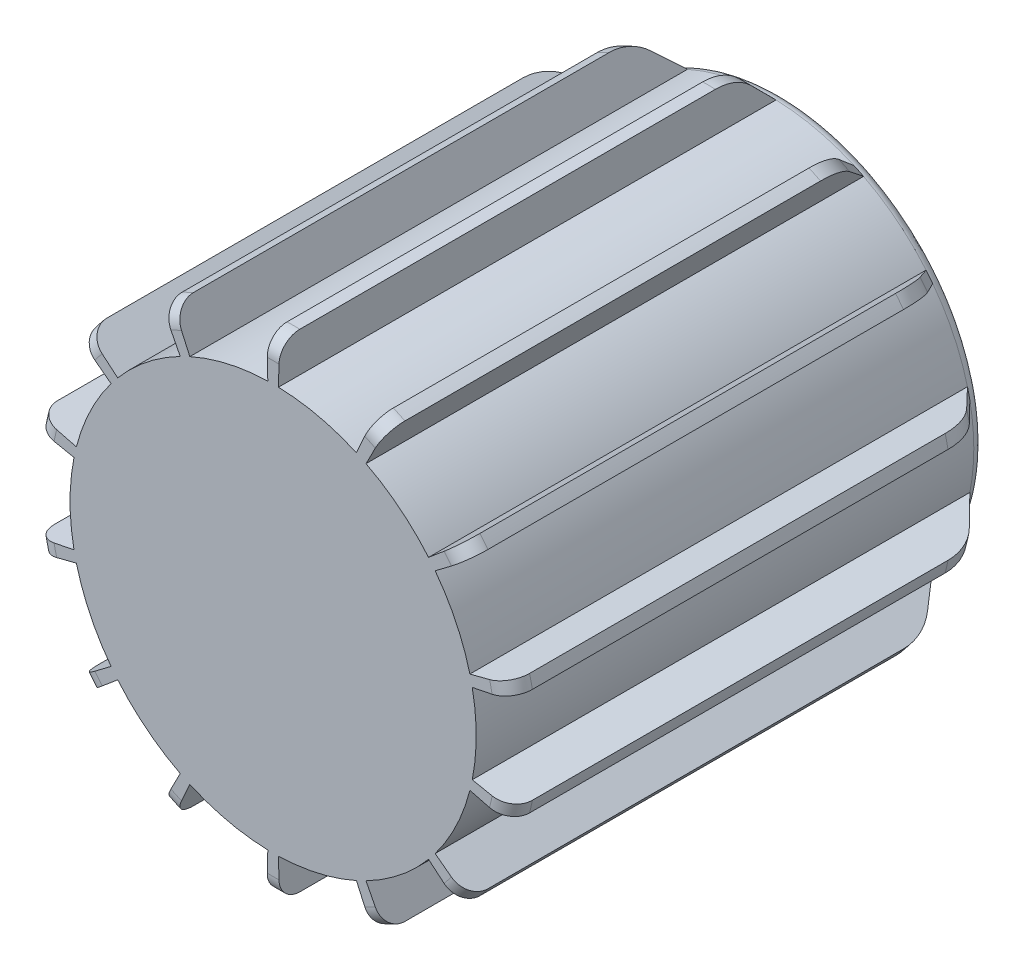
ISO-10303-21;
HEADER;
FILE_DESCRIPTION(('STEP AP214'),'2;1');
FILE_NAME('part.step','',(''),(''),'','','');
FILE_SCHEMA(('AUTOMOTIVE_DESIGN { 1 0 10303 214 1 1 1 1 }'));
ENDSEC;
DATA;
#1=APPLICATION_CONTEXT('core data for automotive mechanical design processes');
#2=APPLICATION_PROTOCOL_DEFINITION('international standard','automotive_design',2000,#1);
#3=PRODUCT_CONTEXT('',#1,'mechanical');
#4=PRODUCT('Part','Part','',(#3));
#5=PRODUCT_RELATED_PRODUCT_CATEGORY('part','',(#4));
#6=PRODUCT_DEFINITION_FORMATION('','',#4);
#7=PRODUCT_DEFINITION_CONTEXT('part definition',#1,'design');
#8=PRODUCT_DEFINITION('design','',#6,#7);
#9=PRODUCT_DEFINITION_SHAPE('','',#8);
#10=(LENGTH_UNIT() NAMED_UNIT(*) SI_UNIT(.MILLI.,.METRE.));
#11=(NAMED_UNIT(*) PLANE_ANGLE_UNIT() SI_UNIT($,.RADIAN.));
#12=(NAMED_UNIT(*) SI_UNIT($,.STERADIAN.) SOLID_ANGLE_UNIT());
#13=UNCERTAINTY_MEASURE_WITH_UNIT(LENGTH_MEASURE(1.E-05),#10,'distance_accuracy_value','');
#14=(GEOMETRIC_REPRESENTATION_CONTEXT(3) GLOBAL_UNCERTAINTY_ASSIGNED_CONTEXT((#13)) GLOBAL_UNIT_ASSIGNED_CONTEXT((#10,
#11,#12)) REPRESENTATION_CONTEXT('',''));
#15=CARTESIAN_POINT('',(0.,0.,0.));
#16=DIRECTION('',(0.,0.,1.));
#17=DIRECTION('',(1.,0.,0.));
#18=AXIS2_PLACEMENT_3D('',#15,#16,#17);
#19=CARTESIAN_POINT('',(0.,0.,275.));
#20=DIRECTION('',(0.,0.,-1.));
#21=DIRECTION('',(-1.,0.,0.));
#22=AXIS2_PLACEMENT_3D('',#19,#20,#21);
#23=CYLINDRICAL_SURFACE('',#22,100.);
#24=CARTESIAN_POINT('',(0.,0.,30.));
#25=DIRECTION('',(0.,0.,1.));
#26=DIRECTION('',(1.,0.,0.));
#27=AXIS2_PLACEMENT_3D('',#24,#25,#26);
#28=CIRCLE('',#27,100.);
#29=CARTESIAN_POINT('',(45.7319673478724,-88.9302376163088,30.));
#30=VERTEX_POINT('',#29);
#31=CARTESIAN_POINT('',(76.5242508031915,-64.3742109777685,30.));
#32=VERTEX_POINT('',#31);
#33=EDGE_CURVE('E593',#30,#32,#28,.T.);
#34=ORIENTED_EDGE('',*,*,#33,.T.);
#35=DIRECTION('',(0.,0.,-1.));
#36=VECTOR('',#35,1.);
#37=CARTESIAN_POINT('',(76.5242508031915,-64.3742109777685,275.));
#38=LINE('',#37,#36);
#39=CARTESIAN_POINT('',(76.5242508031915,-64.3742109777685,275.));
#40=VERTEX_POINT('',#39);
#41=EDGE_CURVE('E1181',#40,#32,#38,.T.);
#42=ORIENTED_EDGE('',*,*,#41,.F.);
#43=CARTESIAN_POINT('',(0.,0.,275.));
#44=DIRECTION('',(0.,0.,1.));
#45=DIRECTION('',(1.,0.,0.));
#46=AXIS2_PLACEMENT_3D('',#43,#44,#45);
#47=CIRCLE('',#46,100.);
#48=CARTESIAN_POINT('',(45.7319673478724,-88.9302376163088,275.));
#49=VERTEX_POINT('',#48);
#50=EDGE_CURVE('E45',#49,#40,#47,.T.);
#51=ORIENTED_EDGE('',*,*,#50,.F.);
#52=DIRECTION('',(0.,0.,-1.));
#53=VECTOR('',#52,1.);
#54=CARTESIAN_POINT('',(45.7319673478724,-88.9302376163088,275.));
#55=LINE('',#54,#53);
#56=EDGE_CURVE('E38',#49,#30,#55,.T.);
#57=ORIENTED_EDGE('',*,*,#56,.T.);
#58=EDGE_LOOP('',(#34,#42,#51,#57));
#59=FACE_BOUND('',#58,.T.);
#60=ADVANCED_FACE('F30',(#59),#23,.T.);
#61=CARTESIAN_POINT('',(0.,0.,265.));
#62=DIRECTION('',(0.,0.,1.));
#63=DIRECTION('',(0.900968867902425,0.433883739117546,0.));
#64=AXIS2_PLACEMENT_3D('',#61,#62,#63);
#65=TOROIDAL_SURFACE('',#64,110.,10.);
#66=CARTESIAN_POINT('',(50.3051640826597,-97.8232613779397,265.));
#67=DIRECTION('',(0.889302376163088,0.457319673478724,0.));
#68=DIRECTION('',(-0.457319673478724,0.889302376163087,0.));
#69=AXIS2_PLACEMENT_3D('',#66,#67,#68);
#70=CIRCLE('',#69,10.);
#71=CARTESIAN_POINT('',(50.3051640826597,-97.8232613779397,275.));
#72=VERTEX_POINT('',#71);
#73=CARTESIAN_POINT('',(54.8783608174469,-106.716285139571,265.));
#74=VERTEX_POINT('',#73);
#75=EDGE_CURVE('E1223',#72,#74,#70,.T.);
#76=ORIENTED_EDGE('',*,*,#75,.F.);
#77=CARTESIAN_POINT('',(0.,0.,275.));
#78=DIRECTION('',(0.,0.,1.));
#79=DIRECTION('',(0.900968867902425,0.433883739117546,0.));
#80=AXIS2_PLACEMENT_3D('',#77,#78,#79);
#81=CIRCLE('',#80,110.);
#82=CARTESIAN_POINT('',(45.116548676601,-100.321966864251,275.));
#83=VERTEX_POINT('',#82);
#84=EDGE_CURVE('E11',#83,#72,#81,.T.);
#85=ORIENTED_EDGE('',*,*,#84,.F.);
#86=CARTESIAN_POINT('',(45.116548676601,-100.321966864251,265.));
#87=DIRECTION('',(0.912017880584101,0.410150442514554,0.));
#88=DIRECTION('',(-0.410150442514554,0.912017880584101,0.));
#89=AXIS2_PLACEMENT_3D('',#86,#87,#88);
#90=CIRCLE('',#89,10.);
#91=CARTESIAN_POINT('',(49.2180531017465,-109.442145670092,265.));
#92=VERTEX_POINT('',#91);
#93=EDGE_CURVE('E1212',#92,#83,#90,.F.);
#94=ORIENTED_EDGE('',*,*,#93,.F.);
#95=CARTESIAN_POINT('',(0.,0.,265.));
#96=DIRECTION('',(0.,0.,1.));
#97=DIRECTION('',(0.900968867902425,0.433883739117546,0.));
#98=AXIS2_PLACEMENT_3D('',#95,#96,#97);
#99=CIRCLE('',#98,120.);
#100=EDGE_CURVE('E1205',#74,#92,#99,.F.);
#101=ORIENTED_EDGE('',*,*,#100,.F.);
#102=EDGE_LOOP('',(#76,#85,#94,#101));
#103=FACE_BOUND('',#102,.T.);
#104=ADVANCED_FACE('F32',(#103),#65,.T.);
#105=CARTESIAN_POINT('',(0.,0.,60.3553390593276));
#106=DIRECTION('',(0.,0.,1.));
#107=DIRECTION('',(0.433883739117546,-0.900968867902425,0.));
#108=AXIS2_PLACEMENT_3D('',#105,#106,#107);
#109=TOROIDAL_SURFACE('',#108,95.0000000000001,25.);
#110=CARTESIAN_POINT('',(43.4453689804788,-84.4837257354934,60.3553390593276));
#111=DIRECTION('',(0.889302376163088,0.457319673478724,0.));
#112=DIRECTION('',(-0.457319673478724,0.889302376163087,0.));
#113=AXIS2_PLACEMENT_3D('',#110,#111,#112);
#114=CIRCLE('',#113,25.);
#115=CARTESIAN_POINT('',(54.8783608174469,-106.716285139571,60.3553390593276));
#116=VERTEX_POINT('',#115);
#117=CARTESIAN_POINT('',(51.5297150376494,-100.204519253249,42.677669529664));
#118=VERTEX_POINT('',#117);
#119=EDGE_CURVE('E1225',#116,#118,#114,.T.);
#120=ORIENTED_EDGE('',*,*,#119,.F.);
#121=CARTESIAN_POINT('',(0.,0.,60.3553390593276));
#122=DIRECTION('',(0.,0.,1.));
#123=DIRECTION('',(0.433883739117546,-0.900968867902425,0.));
#124=AXIS2_PLACEMENT_3D('',#121,#122,#123);
#125=CIRCLE('',#124,120.);
#126=CARTESIAN_POINT('',(49.2180531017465,-109.442145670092,60.3553390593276));
#127=VERTEX_POINT('',#126);
#128=EDGE_CURVE('E1209',#127,#116,#125,.T.);
#129=ORIENTED_EDGE('',*,*,#128,.F.);
#130=CARTESIAN_POINT('',(38.9642920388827,-86.6416986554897,60.3553390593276));
#131=DIRECTION('',(0.912017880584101,0.410150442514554,0.));
#132=DIRECTION('',(-0.410150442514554,0.912017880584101,0.));
#133=AXIS2_PLACEMENT_3D('',#130,#131,#132);
#134=CIRCLE('',#133,25.);
#135=CARTESIAN_POINT('',(46.2147960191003,-102.7640493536,42.677669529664));
#136=VERTEX_POINT('',#135);
#137=EDGE_CURVE('E1219',#136,#127,#134,.F.);
#138=ORIENTED_EDGE('',*,*,#137,.F.);
#139=CARTESIAN_POINT('',(0.,0.,42.677669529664));
#140=DIRECTION('',(0.,0.,-1.));
#141=DIRECTION('',(-0.433883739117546,0.900968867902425,0.));
#142=AXIS2_PLACEMENT_3D('',#139,#140,#141);
#143=CIRCLE('',#142,112.677669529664);
#144=EDGE_CURVE('E1198',#118,#136,#143,.T.);
#145=ORIENTED_EDGE('',*,*,#144,.F.);
#146=EDGE_LOOP('',(#120,#129,#138,#145));
#147=FACE_BOUND('',#146,.T.);
#148=ADVANCED_FACE('F1240',(#147),#109,.T.);
#149=CARTESIAN_POINT('',(43.4453689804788,-84.4837257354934,275.));
#150=DIRECTION('',(0.889302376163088,0.457319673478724,0.));
#151=DIRECTION('',(0.,0.,-1.));
#152=AXIS2_PLACEMENT_3D('',#149,#150,#151);
#153=PLANE('',#152);
#154=DIRECTION('',(0.457319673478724,-0.889302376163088,0.));
#155=VECTOR('',#154,1.);
#156=CARTESIAN_POINT('',(54.8783608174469,-106.716285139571,275.));
#157=LINE('',#156,#155);
#158=EDGE_CURVE('E52',#49,#72,#157,.T.);
#159=ORIENTED_EDGE('',*,*,#158,.T.);
#160=ORIENTED_EDGE('',*,*,#75,.T.);
#161=DIRECTION('',(0.,0.,-1.));
#162=VECTOR('',#161,1.);
#163=CARTESIAN_POINT('',(54.8783608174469,-106.716285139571,50.0000000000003));
#164=LINE('',#163,#162);
#165=EDGE_CURVE('E1203',#74,#116,#164,.T.);
#166=ORIENTED_EDGE('',*,*,#165,.T.);
#167=ORIENTED_EDGE('',*,*,#119,.T.);
#168=DIRECTION('',(-0.323373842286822,0.628831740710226,-0.707106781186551));
#169=VECTOR('',#168,1.);
#170=CARTESIAN_POINT('',(43.4453689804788,-84.4837257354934,25.));
#171=LINE('',#170,#169);
#172=EDGE_CURVE('E601',#118,#30,#171,.T.);
#173=ORIENTED_EDGE('',*,*,#172,.T.);
#174=ORIENTED_EDGE('',*,*,#56,.F.);
#175=EDGE_LOOP('',(#159,#160,#166,#167,#173,#174));
#176=FACE_BOUND('',#175,.T.);
#177=ADVANCED_FACE('F1227',(#176),#153,.T.);
#178=CARTESIAN_POINT('',(38.9642920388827,-86.6416986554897,275.));
#179=DIRECTION('',(0.912017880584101,0.410150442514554,0.));
#180=DIRECTION('',(0.,0.,-1.));
#181=AXIS2_PLACEMENT_3D('',#178,#179,#180);
#182=PLANE('',#181);
#183=DIRECTION('',(0.,0.,-1.));
#184=VECTOR('',#183,1.);
#185=CARTESIAN_POINT('',(49.2180531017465,-109.442145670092,50.0000000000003));
#186=LINE('',#185,#184);
#187=EDGE_CURVE('E1207',#92,#127,#186,.T.);
#188=ORIENTED_EDGE('',*,*,#187,.F.);
#189=ORIENTED_EDGE('',*,*,#93,.T.);
#190=DIRECTION('',(0.410150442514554,-0.912017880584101,0.));
#191=VECTOR('',#190,1.);
#192=CARTESIAN_POINT('',(49.2180531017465,-109.442145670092,275.));
#193=LINE('',#192,#191);
#194=CARTESIAN_POINT('',(41.0150442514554,-91.2017880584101,275.));
#195=VERTEX_POINT('',#194);
#196=EDGE_CURVE('E1214',#195,#83,#193,.T.);
#197=ORIENTED_EDGE('',*,*,#196,.F.);
#198=DIRECTION('',(0.,0.,-1.));
#199=VECTOR('',#198,1.);
#200=CARTESIAN_POINT('',(41.0150442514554,-91.2017880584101,275.));
#201=LINE('',#200,#199);
#202=CARTESIAN_POINT('',(41.0150442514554,-91.2017880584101,30.));
#203=VERTEX_POINT('',#202);
#204=EDGE_CURVE('E1217',#195,#203,#201,.T.);
#205=ORIENTED_EDGE('',*,*,#204,.T.);
#206=DIRECTION('',(-0.290020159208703,0.644894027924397,-0.707106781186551));
#207=VECTOR('',#206,1.);
#208=CARTESIAN_POINT('',(38.9642920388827,-86.6416986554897,25.));
#209=LINE('',#208,#207);
#210=EDGE_CURVE('E1200',#136,#203,#209,.T.);
#211=ORIENTED_EDGE('',*,*,#210,.F.);
#212=ORIENTED_EDGE('',*,*,#137,.T.);
#213=EDGE_LOOP('',(#188,#189,#197,#205,#211,#212));
#214=FACE_BOUND('',#213,.T.);
#215=ADVANCED_FACE('F1236',(#214),#182,.F.);
#216=CARTESIAN_POINT('',(0.,0.,0.));
#217=DIRECTION('',(0.,0.,-1.));
#218=DIRECTION('',(-0.433883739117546,0.900968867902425,0.));
#219=AXIS2_PLACEMENT_3D('',#216,#217,#218);
#220=CYLINDRICAL_SURFACE('',#219,120.);
#221=ORIENTED_EDGE('',*,*,#165,.F.);
#222=ORIENTED_EDGE('',*,*,#100,.T.);
#223=ORIENTED_EDGE('',*,*,#187,.T.);
#224=ORIENTED_EDGE('',*,*,#128,.T.);
#225=EDGE_LOOP('',(#221,#222,#223,#224));
#226=FACE_BOUND('',#225,.T.);
#227=ADVANCED_FACE('F1242',(#226),#220,.T.);
#228=CARTESIAN_POINT('',(0.,0.,50.0000000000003));
#229=DIRECTION('',(0.,0.,1.));
#230=DIRECTION('',(0.433883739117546,-0.900968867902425,0.));
#231=AXIS2_PLACEMENT_3D('',#228,#229,#230);
#232=CONICAL_SURFACE('',#231,120.,0.785398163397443);
#233=ORIENTED_EDGE('',*,*,#172,.F.);
#234=ORIENTED_EDGE('',*,*,#144,.T.);
#235=ORIENTED_EDGE('',*,*,#210,.T.);
#236=CARTESIAN_POINT('',(0.,0.,30.));
#237=DIRECTION('',(0.,0.,1.));
#238=DIRECTION('',(0.900968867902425,0.433883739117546,0.));
#239=AXIS2_PLACEMENT_3D('',#236,#237,#238);
#240=CIRCLE('',#239,100.);
#241=EDGE_CURVE('E577',#203,#30,#240,.T.);
#242=ORIENTED_EDGE('',*,*,#241,.T.);
#243=EDGE_LOOP('',(#233,#234,#235,#242));
#244=FACE_BOUND('',#243,.T.);
#245=ADVANCED_FACE('F1231',(#244),#232,.T.);
#246=CARTESIAN_POINT('',(79.78846286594,-60.2810185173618,30.));
#247=VERTEX_POINT('',#246);
#248=CARTESIAN_POINT('',(96.876890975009,-24.7965319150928,30.));
#249=VERTEX_POINT('',#248);
#250=EDGE_CURVE('E599',#247,#249,#28,.T.);
#251=ORIENTED_EDGE('',*,*,#250,.T.);
#252=DIRECTION('',(0.,0.,-1.));
#253=VECTOR('',#252,1.);
#254=CARTESIAN_POINT('',(96.876890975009,-24.7965319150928,275.));
#255=LINE('',#254,#253);
#256=CARTESIAN_POINT('',(96.876890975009,-24.7965319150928,275.));
#257=VERTEX_POINT('',#256);
#258=EDGE_CURVE('E1143',#257,#249,#255,.T.);
#259=ORIENTED_EDGE('',*,*,#258,.F.);
#260=CARTESIAN_POINT('',(79.78846286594,-60.2810185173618,275.));
#261=VERTEX_POINT('',#260);
#262=EDGE_CURVE('E603',#261,#257,#47,.T.);
#263=ORIENTED_EDGE('',*,*,#262,.F.);
#264=DIRECTION('',(0.,0.,-1.));
#265=VECTOR('',#264,1.);
#266=CARTESIAN_POINT('',(79.78846286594,-60.2810185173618,275.));
#267=LINE('',#266,#265);
#268=EDGE_CURVE('E605',#261,#247,#267,.T.);
#269=ORIENTED_EDGE('',*,*,#268,.T.);
#270=EDGE_LOOP('',(#251,#259,#263,#269));
#271=FACE_BOUND('',#270,.T.);
#272=ADVANCED_FACE('F1290',(#271),#23,.T.);
#273=CARTESIAN_POINT('',(0.,0.,265.));
#274=DIRECTION('',(0.,0.,1.));
#275=DIRECTION('',(0.623489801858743,0.781831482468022,0.));
#276=AXIS2_PLACEMENT_3D('',#273,#274,#275);
#277=TOROIDAL_SURFACE('',#276,110.,10.);
#278=CARTESIAN_POINT('',(87.7673091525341,-66.3091203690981,265.));
#279=DIRECTION('',(0.602810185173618,0.7978846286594,0.));
#280=DIRECTION('',(-0.7978846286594,0.602810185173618,0.));
#281=AXIS2_PLACEMENT_3D('',#278,#279,#280);
#282=CIRCLE('',#281,10.);
#283=CARTESIAN_POINT('',(87.7673091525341,-66.3091203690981,275.));
#284=VERTEX_POINT('',#283);
#285=CARTESIAN_POINT('',(95.7461554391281,-72.3372222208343,265.));
#286=VERTEX_POINT('',#285);
#287=EDGE_CURVE('E1189',#284,#286,#282,.T.);
#288=ORIENTED_EDGE('',*,*,#287,.F.);
#289=CARTESIAN_POINT('',(0.,0.,275.));
#290=DIRECTION('',(0.,0.,1.));
#291=DIRECTION('',(0.623489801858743,0.781831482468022,0.));
#292=AXIS2_PLACEMENT_3D('',#289,#290,#291);
#293=CIRCLE('',#292,110.);
#294=CARTESIAN_POINT('',(84.1766758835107,-70.8116320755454,275.));
#295=VERTEX_POINT('',#294);
#296=EDGE_CURVE('E598',#295,#284,#293,.T.);
#297=ORIENTED_EDGE('',*,*,#296,.F.);
#298=CARTESIAN_POINT('',(84.1766758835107,-70.8116320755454,265.));
#299=DIRECTION('',(0.643742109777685,0.765242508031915,0.));
#300=DIRECTION('',(-0.765242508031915,0.643742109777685,0.));
#301=AXIS2_PLACEMENT_3D('',#298,#299,#300);
#302=CIRCLE('',#301,10.);
#303=CARTESIAN_POINT('',(91.8291009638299,-77.2490531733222,265.));
#304=VERTEX_POINT('',#303);
#305=EDGE_CURVE('E1176',#304,#295,#302,.F.);
#306=ORIENTED_EDGE('',*,*,#305,.F.);
#307=CARTESIAN_POINT('',(0.,0.,265.));
#308=DIRECTION('',(0.,0.,1.));
#309=DIRECTION('',(0.623489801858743,0.781831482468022,0.));
#310=AXIS2_PLACEMENT_3D('',#307,#308,#309);
#311=CIRCLE('',#310,120.);
#312=EDGE_CURVE('E1169',#286,#304,#311,.F.);
#313=ORIENTED_EDGE('',*,*,#312,.F.);
#314=EDGE_LOOP('',(#288,#297,#306,#313));
#315=FACE_BOUND('',#314,.T.);
#316=ADVANCED_FACE('F1296',(#315),#277,.T.);
#317=CARTESIAN_POINT('',(0.,0.,60.3553390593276));
#318=DIRECTION('',(0.,0.,1.));
#319=DIRECTION('',(0.781831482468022,-0.623489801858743,0.));
#320=AXIS2_PLACEMENT_3D('',#317,#318,#319);
#321=TOROIDAL_SURFACE('',#320,95.0000000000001,25.);
#322=CARTESIAN_POINT('',(75.7990397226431,-57.2669675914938,60.3553390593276));
#323=DIRECTION('',(0.602810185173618,0.7978846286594,0.));
#324=DIRECTION('',(-0.7978846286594,0.602810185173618,0.));
#325=AXIS2_PLACEMENT_3D('',#322,#323,#324);
#326=CIRCLE('',#325,25.);
#327=CARTESIAN_POINT('',(95.746155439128,-72.3372222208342,60.3553390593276));
#328=VERTEX_POINT('',#327);
#329=CARTESIAN_POINT('',(89.9037805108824,-67.9232468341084,42.677669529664));
#330=VERTEX_POINT('',#329);
#331=EDGE_CURVE('E1192',#328,#330,#326,.T.);
#332=ORIENTED_EDGE('',*,*,#331,.F.);
#333=CARTESIAN_POINT('',(0.,0.,60.3553390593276));
#334=DIRECTION('',(0.,0.,1.));
#335=DIRECTION('',(0.781831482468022,-0.623489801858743,0.));
#336=AXIS2_PLACEMENT_3D('',#333,#334,#335);
#337=CIRCLE('',#336,120.);
#338=CARTESIAN_POINT('',(91.8291009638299,-77.2490531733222,60.3553390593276));
#339=VERTEX_POINT('',#338);
#340=EDGE_CURVE('E1173',#339,#328,#337,.T.);
#341=ORIENTED_EDGE('',*,*,#340,.F.);
#342=CARTESIAN_POINT('',(72.698038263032,-61.1555004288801,60.3553390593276));
#343=DIRECTION('',(0.643742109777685,0.765242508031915,0.));
#344=DIRECTION('',(-0.765242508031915,0.643742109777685,0.));
#345=AXIS2_PLACEMENT_3D('',#342,#343,#344);
#346=CIRCLE('',#345,25.);
#347=CARTESIAN_POINT('',(86.2257424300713,-72.5353607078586,42.677669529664));
#348=VERTEX_POINT('',#347);
#349=EDGE_CURVE('E1184',#348,#339,#346,.F.);
#350=ORIENTED_EDGE('',*,*,#349,.F.);
#351=CARTESIAN_POINT('',(0.,0.,42.677669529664));
#352=DIRECTION('',(0.,0.,-1.));
#353=DIRECTION('',(-0.781831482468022,0.623489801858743,0.));
#354=AXIS2_PLACEMENT_3D('',#351,#352,#353);
#355=CIRCLE('',#354,112.677669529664);
#356=EDGE_CURVE('E1160',#330,#348,#355,.T.);
#357=ORIENTED_EDGE('',*,*,#356,.F.);
#358=EDGE_LOOP('',(#332,#341,#350,#357));
#359=FACE_BOUND('',#358,.T.);
#360=ADVANCED_FACE('F1302',(#359),#321,.T.);
#361=CARTESIAN_POINT('',(75.799039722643,-57.2669675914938,275.));
#362=DIRECTION('',(0.602810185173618,0.7978846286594,0.));
#363=DIRECTION('',(0.,0.,-1.));
#364=AXIS2_PLACEMENT_3D('',#361,#362,#363);
#365=PLANE('',#364);
#366=DIRECTION('',(0.7978846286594,-0.602810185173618,0.));
#367=VECTOR('',#366,1.);
#368=CARTESIAN_POINT('',(95.7461554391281,-72.3372222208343,275.));
#369=LINE('',#368,#367);
#370=EDGE_CURVE('E1187',#261,#284,#369,.T.);
#371=ORIENTED_EDGE('',*,*,#370,.T.);
#372=ORIENTED_EDGE('',*,*,#287,.T.);
#373=DIRECTION('',(0.,0.,-1.));
#374=VECTOR('',#373,1.);
#375=CARTESIAN_POINT('',(95.746155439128,-72.3372222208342,50.0000000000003));
#376=LINE('',#375,#374);
#377=EDGE_CURVE('E1167',#286,#328,#376,.T.);
#378=ORIENTED_EDGE('',*,*,#377,.T.);
#379=ORIENTED_EDGE('',*,*,#331,.T.);
#380=DIRECTION('',(-0.564189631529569,0.426251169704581,-0.707106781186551));
#381=VECTOR('',#380,1.);
#382=CARTESIAN_POINT('',(75.799039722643,-57.2669675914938,25.));
#383=LINE('',#382,#381);
#384=EDGE_CURVE('E613',#330,#247,#383,.T.);
#385=ORIENTED_EDGE('',*,*,#384,.T.);
#386=ORIENTED_EDGE('',*,*,#268,.F.);
#387=EDGE_LOOP('',(#371,#372,#378,#379,#385,#386));
#388=FACE_BOUND('',#387,.T.);
#389=ADVANCED_FACE('F1608',(#388),#365,.T.);
#390=CARTESIAN_POINT('',(72.698038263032,-61.1555004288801,275.));
#391=DIRECTION('',(0.643742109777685,0.765242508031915,0.));
#392=DIRECTION('',(0.,0.,-1.));
#393=AXIS2_PLACEMENT_3D('',#390,#391,#392);
#394=PLANE('',#393);
#395=DIRECTION('',(0.,0.,-1.));
#396=VECTOR('',#395,1.);
#397=CARTESIAN_POINT('',(91.8291009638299,-77.2490531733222,50.0000000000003));
#398=LINE('',#397,#396);
#399=EDGE_CURVE('E1171',#304,#339,#398,.T.);
#400=ORIENTED_EDGE('',*,*,#399,.F.);
#401=ORIENTED_EDGE('',*,*,#305,.T.);
#402=DIRECTION('',(0.765242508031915,-0.643742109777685,0.));
#403=VECTOR('',#402,1.);
#404=CARTESIAN_POINT('',(91.8291009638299,-77.2490531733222,275.));
#405=LINE('',#404,#403);
#406=EDGE_CURVE('E1178',#40,#295,#405,.T.);
#407=ORIENTED_EDGE('',*,*,#406,.F.);
#408=ORIENTED_EDGE('',*,*,#41,.T.);
#409=DIRECTION('',(-0.541108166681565,0.455194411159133,-0.707106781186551));
#410=VECTOR('',#409,1.);
#411=CARTESIAN_POINT('',(72.698038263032,-61.1555004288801,25.));
#412=LINE('',#411,#410);
#413=EDGE_CURVE('E1162',#348,#32,#412,.T.);
#414=ORIENTED_EDGE('',*,*,#413,.F.);
#415=ORIENTED_EDGE('',*,*,#349,.T.);
#416=EDGE_LOOP('',(#400,#401,#407,#408,#414,#415));
#417=FACE_BOUND('',#416,.T.);
#418=ADVANCED_FACE('F1604',(#417),#394,.F.);
#419=CARTESIAN_POINT('',(0.,0.,0.));
#420=DIRECTION('',(0.,0.,-1.));
#421=DIRECTION('',(-0.781831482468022,0.623489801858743,0.));
#422=AXIS2_PLACEMENT_3D('',#419,#420,#421);
#423=CYLINDRICAL_SURFACE('',#422,120.);
#424=ORIENTED_EDGE('',*,*,#377,.F.);
#425=ORIENTED_EDGE('',*,*,#312,.T.);
#426=ORIENTED_EDGE('',*,*,#399,.T.);
#427=ORIENTED_EDGE('',*,*,#340,.T.);
#428=EDGE_LOOP('',(#424,#425,#426,#427));
#429=FACE_BOUND('',#428,.T.);
#430=ADVANCED_FACE('F1317',(#429),#423,.T.);
#431=CARTESIAN_POINT('',(0.,0.,50.0000000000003));
#432=DIRECTION('',(0.,0.,1.));
#433=DIRECTION('',(0.781831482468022,-0.623489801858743,0.));
#434=AXIS2_PLACEMENT_3D('',#431,#432,#433);
#435=CONICAL_SURFACE('',#434,120.,0.785398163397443);
#436=ORIENTED_EDGE('',*,*,#384,.F.);
#437=ORIENTED_EDGE('',*,*,#356,.T.);
#438=ORIENTED_EDGE('',*,*,#413,.T.);
#439=CARTESIAN_POINT('',(0.,0.,30.));
#440=DIRECTION('',(0.,0.,1.));
#441=DIRECTION('',(0.623489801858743,0.781831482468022,0.));
#442=AXIS2_PLACEMENT_3D('',#439,#440,#441);
#443=CIRCLE('',#442,100.);
#444=EDGE_CURVE('E1164',#32,#247,#443,.T.);
#445=ORIENTED_EDGE('',*,*,#444,.T.);
#446=EDGE_LOOP('',(#436,#437,#438,#445));
#447=FACE_BOUND('',#446,.T.);
#448=ADVANCED_FACE('F1308',(#447),#435,.T.);
#449=CARTESIAN_POINT('',(98.0418747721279,-19.6924044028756,30.));
#450=VERTEX_POINT('',#449);
#451=CARTESIAN_POINT('',(98.0418747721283,19.6924044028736,30.));
#452=VERTEX_POINT('',#451);
#453=EDGE_CURVE('E608',#450,#452,#28,.T.);
#454=ORIENTED_EDGE('',*,*,#453,.T.);
#455=DIRECTION('',(0.,0.,-1.));
#456=VECTOR('',#455,1.);
#457=CARTESIAN_POINT('',(98.0418747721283,19.6924044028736,275.));
#458=LINE('',#457,#456);
#459=CARTESIAN_POINT('',(98.0418747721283,19.6924044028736,275.));
#460=VERTEX_POINT('',#459);
#461=EDGE_CURVE('E1105',#460,#452,#458,.T.);
#462=ORIENTED_EDGE('',*,*,#461,.F.);
#463=CARTESIAN_POINT('',(98.0418747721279,-19.6924044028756,275.));
#464=VERTEX_POINT('',#463);
#465=EDGE_CURVE('E614',#464,#460,#47,.T.);
#466=ORIENTED_EDGE('',*,*,#465,.F.);
#467=DIRECTION('',(0.,0.,-1.));
#468=VECTOR('',#467,1.);
#469=CARTESIAN_POINT('',(98.0418747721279,-19.6924044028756,275.));
#470=LINE('',#469,#468);
#471=EDGE_CURVE('E616',#464,#450,#470,.T.);
#472=ORIENTED_EDGE('',*,*,#471,.T.);
#473=EDGE_LOOP('',(#454,#462,#466,#472));
#474=FACE_BOUND('',#473,.T.);
#475=ADVANCED_FACE('F1297',(#474),#23,.T.);
#476=CARTESIAN_POINT('',(0.,0.,265.));
#477=DIRECTION('',(0.,0.,1.));
#478=DIRECTION('',(0.222520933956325,0.974927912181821,0.));
#479=AXIS2_PLACEMENT_3D('',#476,#477,#478);
#480=TOROIDAL_SURFACE('',#479,110.,10.);
#481=CARTESIAN_POINT('',(107.846062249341,-21.6616448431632,265.));
#482=DIRECTION('',(0.196924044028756,0.980418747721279,0.));
#483=DIRECTION('',(-0.980418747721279,0.196924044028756,0.));
#484=AXIS2_PLACEMENT_3D('',#481,#482,#483);
#485=CIRCLE('',#484,10.);
#486=CARTESIAN_POINT('',(107.846062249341,-21.6616448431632,275.));
#487=VERTEX_POINT('',#486);
#488=CARTESIAN_POINT('',(117.650249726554,-23.6308852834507,265.));
#489=VERTEX_POINT('',#488);
#490=EDGE_CURVE('E1151',#487,#489,#485,.T.);
#491=ORIENTED_EDGE('',*,*,#490,.F.);
#492=CARTESIAN_POINT('',(0.,0.,275.));
#493=DIRECTION('',(0.,0.,1.));
#494=DIRECTION('',(0.222520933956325,0.974927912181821,0.));
#495=AXIS2_PLACEMENT_3D('',#492,#493,#494);
#496=CIRCLE('',#495,110.);
#497=CARTESIAN_POINT('',(106.56458007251,-27.2761851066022,275.));
#498=VERTEX_POINT('',#497);
#499=EDGE_CURVE('E607',#498,#487,#496,.T.);
#500=ORIENTED_EDGE('',*,*,#499,.F.);
#501=CARTESIAN_POINT('',(106.56458007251,-27.2761851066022,265.));
#502=DIRECTION('',(0.247965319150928,0.96876890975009,0.));
#503=DIRECTION('',(-0.96876890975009,0.247965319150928,0.));
#504=AXIS2_PLACEMENT_3D('',#501,#502,#503);
#505=CIRCLE('',#504,10.);
#506=CARTESIAN_POINT('',(116.252269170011,-29.7558382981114,265.));
#507=VERTEX_POINT('',#506);
#508=EDGE_CURVE('E1138',#507,#498,#505,.F.);
#509=ORIENTED_EDGE('',*,*,#508,.F.);
#510=CARTESIAN_POINT('',(0.,0.,265.));
#511=DIRECTION('',(0.,0.,1.));
#512=DIRECTION('',(0.222520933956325,0.974927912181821,0.));
#513=AXIS2_PLACEMENT_3D('',#510,#511,#512);
#514=CIRCLE('',#513,120.);
#515=EDGE_CURVE('E1131',#489,#507,#514,.F.);
#516=ORIENTED_EDGE('',*,*,#515,.F.);
#517=EDGE_LOOP('',(#491,#500,#509,#516));
#518=FACE_BOUND('',#517,.T.);
#519=ADVANCED_FACE('F1307',(#518),#480,.T.);
#520=CARTESIAN_POINT('',(0.,0.,60.3553390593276));
#521=DIRECTION('',(0.,0.,1.));
#522=DIRECTION('',(0.974927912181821,-0.222520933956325,0.));
#523=AXIS2_PLACEMENT_3D('',#520,#521,#522);
#524=TOROIDAL_SURFACE('',#523,95.0000000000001,25.);
#525=CARTESIAN_POINT('',(93.1397810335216,-18.7077841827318,60.3553390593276));
#526=DIRECTION('',(0.196924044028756,0.980418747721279,0.));
#527=DIRECTION('',(-0.980418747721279,0.196924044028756,0.));
#528=AXIS2_PLACEMENT_3D('',#525,#526,#527);
#529=CIRCLE('',#528,25.);
#530=CARTESIAN_POINT('',(117.650249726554,-23.6308852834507,60.3553390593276));
#531=VERTEX_POINT('',#530);
#532=CARTESIAN_POINT('',(110.471299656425,-22.1889423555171,42.677669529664));
#533=VERTEX_POINT('',#532);
#534=EDGE_CURVE('E1154',#531,#533,#529,.T.);
#535=ORIENTED_EDGE('',*,*,#534,.F.);
#536=CARTESIAN_POINT('',(0.,0.,60.3553390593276));
#537=DIRECTION('',(0.,0.,1.));
#538=DIRECTION('',(0.974927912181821,-0.222520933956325,0.));
#539=AXIS2_PLACEMENT_3D('',#536,#537,#538);
#540=CIRCLE('',#539,120.);
#541=CARTESIAN_POINT('',(116.252269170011,-29.7558382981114,60.3553390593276));
#542=VERTEX_POINT('',#541);
#543=EDGE_CURVE('E1135',#542,#531,#540,.T.);
#544=ORIENTED_EDGE('',*,*,#543,.F.);
#545=CARTESIAN_POINT('',(92.0330464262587,-23.5567053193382,60.3553390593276));
#546=DIRECTION('',(0.247965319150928,0.96876890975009,0.));
#547=DIRECTION('',(-0.96876890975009,0.247965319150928,0.));
#548=AXIS2_PLACEMENT_3D('',#545,#546,#547);
#549=CIRCLE('',#548,25.);
#550=CARTESIAN_POINT('',(109.158623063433,-27.9401542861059,42.677669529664));
#551=VERTEX_POINT('',#550);
#552=EDGE_CURVE('E1146',#551,#542,#549,.F.);
#553=ORIENTED_EDGE('',*,*,#552,.F.);
#554=CARTESIAN_POINT('',(0.,0.,42.677669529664));
#555=DIRECTION('',(0.,0.,-1.));
#556=DIRECTION('',(-0.974927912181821,0.222520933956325,0.));
#557=AXIS2_PLACEMENT_3D('',#554,#555,#556);
#558=CIRCLE('',#557,112.677669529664);
#559=EDGE_CURVE('E1122',#533,#551,#558,.T.);
#560=ORIENTED_EDGE('',*,*,#559,.F.);
#561=EDGE_LOOP('',(#535,#544,#553,#560));
#562=FACE_BOUND('',#561,.T.);
#563=ADVANCED_FACE('F1314',(#562),#524,.T.);
#564=CARTESIAN_POINT('',(93.1397810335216,-18.7077841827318,275.));
#565=DIRECTION('',(0.196924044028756,0.980418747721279,0.));
#566=DIRECTION('',(0.,0.,-1.));
#567=AXIS2_PLACEMENT_3D('',#564,#565,#566);
#568=PLANE('',#567);
#569=DIRECTION('',(0.980418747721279,-0.196924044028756,0.));
#570=VECTOR('',#569,1.);
#571=CARTESIAN_POINT('',(117.650249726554,-23.6308852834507,275.));
#572=LINE('',#571,#570);
#573=EDGE_CURVE('E1149',#464,#487,#572,.T.);
#574=ORIENTED_EDGE('',*,*,#573,.T.);
#575=ORIENTED_EDGE('',*,*,#490,.T.);
#576=DIRECTION('',(0.,0.,-1.));
#577=VECTOR('',#576,1.);
#578=CARTESIAN_POINT('',(117.650249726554,-23.6308852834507,50.0000000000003));
#579=LINE('',#578,#577);
#580=EDGE_CURVE('E1129',#489,#531,#579,.T.);
#581=ORIENTED_EDGE('',*,*,#580,.T.);
#582=ORIENTED_EDGE('',*,*,#534,.T.);
#583=DIRECTION('',(-0.693260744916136,0.139246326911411,-0.707106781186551));
#584=VECTOR('',#583,1.);
#585=CARTESIAN_POINT('',(93.1397810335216,-18.7077841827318,25.));
#586=LINE('',#585,#584);
#587=EDGE_CURVE('E624',#533,#450,#586,.T.);
#588=ORIENTED_EDGE('',*,*,#587,.T.);
#589=ORIENTED_EDGE('',*,*,#471,.F.);
#590=EDGE_LOOP('',(#574,#575,#581,#582,#588,#589));
#591=FACE_BOUND('',#590,.T.);
#592=ADVANCED_FACE('F1594',(#591),#568,.T.);
#593=CARTESIAN_POINT('',(92.0330464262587,-23.5567053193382,275.));
#594=DIRECTION('',(0.247965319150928,0.96876890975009,0.));
#595=DIRECTION('',(0.,0.,-1.));
#596=AXIS2_PLACEMENT_3D('',#593,#594,#595);
#597=PLANE('',#596);
#598=DIRECTION('',(0.,0.,-1.));
#599=VECTOR('',#598,1.);
#600=CARTESIAN_POINT('',(116.252269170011,-29.7558382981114,50.0000000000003));
#601=LINE('',#600,#599);
#602=EDGE_CURVE('E1133',#507,#542,#601,.T.);
#603=ORIENTED_EDGE('',*,*,#602,.F.);
#604=ORIENTED_EDGE('',*,*,#508,.T.);
#605=DIRECTION('',(0.96876890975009,-0.247965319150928,0.));
#606=VECTOR('',#605,1.);
#607=CARTESIAN_POINT('',(116.252269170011,-29.7558382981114,275.));
#608=LINE('',#607,#606);
#609=EDGE_CURVE('E1140',#257,#498,#608,.T.);
#610=ORIENTED_EDGE('',*,*,#609,.F.);
#611=ORIENTED_EDGE('',*,*,#258,.T.);
#612=DIRECTION('',(-0.685023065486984,0.175337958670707,-0.707106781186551));
#613=VECTOR('',#612,1.);
#614=CARTESIAN_POINT('',(92.0330464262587,-23.5567053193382,25.));
#615=LINE('',#614,#613);
#616=EDGE_CURVE('E1124',#551,#249,#615,.T.);
#617=ORIENTED_EDGE('',*,*,#616,.F.);
#618=ORIENTED_EDGE('',*,*,#552,.T.);
#619=EDGE_LOOP('',(#603,#604,#610,#611,#617,#618));
#620=FACE_BOUND('',#619,.T.);
#621=ADVANCED_FACE('F1590',(#620),#597,.F.);
#622=CARTESIAN_POINT('',(0.,0.,0.));
#623=DIRECTION('',(0.,0.,-1.));
#624=DIRECTION('',(-0.974927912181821,0.222520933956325,0.));
#625=AXIS2_PLACEMENT_3D('',#622,#623,#624);
#626=CYLINDRICAL_SURFACE('',#625,120.);
#627=ORIENTED_EDGE('',*,*,#580,.F.);
#628=ORIENTED_EDGE('',*,*,#515,.T.);
#629=ORIENTED_EDGE('',*,*,#602,.T.);
#630=ORIENTED_EDGE('',*,*,#543,.T.);
#631=EDGE_LOOP('',(#627,#628,#629,#630));
#632=FACE_BOUND('',#631,.T.);
#633=ADVANCED_FACE('F1331',(#632),#626,.T.);
#634=CARTESIAN_POINT('',(0.,0.,50.0000000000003));
#635=DIRECTION('',(0.,0.,1.));
#636=DIRECTION('',(0.974927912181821,-0.222520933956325,0.));
#637=AXIS2_PLACEMENT_3D('',#634,#635,#636);
#638=CONICAL_SURFACE('',#637,120.,0.785398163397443);
#639=ORIENTED_EDGE('',*,*,#587,.F.);
#640=ORIENTED_EDGE('',*,*,#559,.T.);
#641=ORIENTED_EDGE('',*,*,#616,.T.);
#642=CARTESIAN_POINT('',(0.,0.,30.));
#643=DIRECTION('',(0.,0.,1.));
#644=DIRECTION('',(0.222520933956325,0.974927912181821,0.));
#645=AXIS2_PLACEMENT_3D('',#642,#643,#644);
#646=CIRCLE('',#645,100.);
#647=EDGE_CURVE('E1126',#249,#450,#646,.T.);
#648=ORIENTED_EDGE('',*,*,#647,.T.);
#649=EDGE_LOOP('',(#639,#640,#641,#648));
#650=FACE_BOUND('',#649,.T.);
#651=ADVANCED_FACE('F1322',(#650),#638,.T.);
#652=CARTESIAN_POINT('',(96.8768909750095,24.7965319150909,30.));
#653=VERTEX_POINT('',#652);
#654=CARTESIAN_POINT('',(79.7884628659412,60.2810185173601,30.));
#655=VERTEX_POINT('',#654);
#656=EDGE_CURVE('E619',#653,#655,#28,.T.);
#657=ORIENTED_EDGE('',*,*,#656,.T.);
#658=DIRECTION('',(0.,0.,-1.));
#659=VECTOR('',#658,1.);
#660=CARTESIAN_POINT('',(79.7884628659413,60.2810185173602,275.));
#661=LINE('',#660,#659);
#662=CARTESIAN_POINT('',(79.7884628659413,60.2810185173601,275.));
#663=VERTEX_POINT('',#662);
#664=EDGE_CURVE('E1067',#663,#655,#661,.T.);
#665=ORIENTED_EDGE('',*,*,#664,.F.);
#666=CARTESIAN_POINT('',(96.8768909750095,24.7965319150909,275.));
#667=VERTEX_POINT('',#666);
#668=EDGE_CURVE('E625',#667,#663,#47,.T.);
#669=ORIENTED_EDGE('',*,*,#668,.F.);
#670=DIRECTION('',(0.,0.,-1.));
#671=VECTOR('',#670,1.);
#672=CARTESIAN_POINT('',(96.8768909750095,24.7965319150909,275.));
#673=LINE('',#672,#671);
#674=EDGE_CURVE('E627',#667,#653,#673,.T.);
#675=ORIENTED_EDGE('',*,*,#674,.T.);
#676=EDGE_LOOP('',(#657,#665,#669,#675));
#677=FACE_BOUND('',#676,.T.);
#678=ADVANCED_FACE('F1309',(#677),#23,.T.);
#679=CARTESIAN_POINT('',(0.,0.,265.));
#680=DIRECTION('',(0.,0.,1.));
#681=DIRECTION('',(-0.222520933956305,0.974927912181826,0.));
#682=AXIS2_PLACEMENT_3D('',#679,#680,#681);
#683=TOROIDAL_SURFACE('',#682,110.,10.);
#684=CARTESIAN_POINT('',(106.564580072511,27.2761851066,265.));
#685=DIRECTION('',(-0.247965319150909,0.968768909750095,0.));
#686=DIRECTION('',(-0.968768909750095,-0.247965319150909,0.));
#687=AXIS2_PLACEMENT_3D('',#684,#685,#686);
#688=CIRCLE('',#687,10.);
#689=CARTESIAN_POINT('',(106.564580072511,27.2761851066,275.));
#690=VERTEX_POINT('',#689);
#691=CARTESIAN_POINT('',(116.252269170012,29.7558382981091,265.));
#692=VERTEX_POINT('',#691);
#693=EDGE_CURVE('E1113',#690,#692,#688,.T.);
#694=ORIENTED_EDGE('',*,*,#693,.F.);
#695=CARTESIAN_POINT('',(0.,0.,275.));
#696=DIRECTION('',(0.,0.,1.));
#697=DIRECTION('',(-0.222520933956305,0.974927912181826,0.));
#698=AXIS2_PLACEMENT_3D('',#695,#696,#697);
#699=CIRCLE('',#698,110.);
#700=CARTESIAN_POINT('',(107.846062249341,21.661644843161,275.));
#701=VERTEX_POINT('',#700);
#702=EDGE_CURVE('E618',#701,#690,#699,.T.);
#703=ORIENTED_EDGE('',*,*,#702,.F.);
#704=CARTESIAN_POINT('',(107.846062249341,21.661644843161,265.));
#705=DIRECTION('',(-0.196924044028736,0.980418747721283,0.));
#706=DIRECTION('',(-0.980418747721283,-0.196924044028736,0.));
#707=AXIS2_PLACEMENT_3D('',#704,#705,#706);
#708=CIRCLE('',#707,10.);
#709=CARTESIAN_POINT('',(117.650249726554,23.6308852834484,265.));
#710=VERTEX_POINT('',#709);
#711=EDGE_CURVE('E1100',#710,#701,#708,.F.);
#712=ORIENTED_EDGE('',*,*,#711,.F.);
#713=CARTESIAN_POINT('',(0.,0.,265.));
#714=DIRECTION('',(0.,0.,1.));
#715=DIRECTION('',(-0.222520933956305,0.974927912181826,0.));
#716=AXIS2_PLACEMENT_3D('',#713,#714,#715);
#717=CIRCLE('',#716,120.);
#718=EDGE_CURVE('E1093',#692,#710,#717,.F.);
#719=ORIENTED_EDGE('',*,*,#718,.F.);
#720=EDGE_LOOP('',(#694,#703,#712,#719));
#721=FACE_BOUND('',#720,.T.);
#722=ADVANCED_FACE('F1321',(#721),#683,.T.);
#723=CARTESIAN_POINT('',(0.,0.,60.3553390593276));
#724=DIRECTION('',(0.,0.,1.));
#725=DIRECTION('',(0.974927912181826,0.222520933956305,0.));
#726=AXIS2_PLACEMENT_3D('',#723,#724,#725);
#727=TOROIDAL_SURFACE('',#726,95.0000000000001,25.);
#728=CARTESIAN_POINT('',(92.0330464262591,23.5567053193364,60.3553390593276));
#729=DIRECTION('',(-0.247965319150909,0.968768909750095,0.));
#730=DIRECTION('',(-0.968768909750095,-0.247965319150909,0.));
#731=AXIS2_PLACEMENT_3D('',#728,#729,#730);
#732=CIRCLE('',#731,25.);
#733=CARTESIAN_POINT('',(116.252269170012,29.7558382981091,60.3553390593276));
#734=VERTEX_POINT('',#733);
#735=CARTESIAN_POINT('',(109.158623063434,27.9401542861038,42.677669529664));
#736=VERTEX_POINT('',#735);
#737=EDGE_CURVE('E1116',#734,#736,#732,.T.);
#738=ORIENTED_EDGE('',*,*,#737,.F.);
#739=CARTESIAN_POINT('',(0.,0.,60.3553390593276));
#740=DIRECTION('',(0.,0.,1.));
#741=DIRECTION('',(0.974927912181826,0.222520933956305,0.));
#742=AXIS2_PLACEMENT_3D('',#739,#740,#741);
#743=CIRCLE('',#742,120.);
#744=CARTESIAN_POINT('',(117.650249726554,23.6308852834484,60.3553390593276));
#745=VERTEX_POINT('',#744);
#746=EDGE_CURVE('E1097',#745,#734,#743,.T.);
#747=ORIENTED_EDGE('',*,*,#746,.F.);
#748=CARTESIAN_POINT('',(93.139781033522,18.70778418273,60.3553390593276));
#749=DIRECTION('',(-0.196924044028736,0.980418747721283,0.));
#750=DIRECTION('',(-0.980418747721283,-0.196924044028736,0.));
#751=AXIS2_PLACEMENT_3D('',#748,#749,#750);
#752=CIRCLE('',#751,25.);
#753=CARTESIAN_POINT('',(110.471299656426,22.1889423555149,42.677669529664));
#754=VERTEX_POINT('',#753);
#755=EDGE_CURVE('E1108',#754,#745,#752,.F.);
#756=ORIENTED_EDGE('',*,*,#755,.F.);
#757=CARTESIAN_POINT('',(0.,0.,42.677669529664));
#758=DIRECTION('',(0.,0.,-1.));
#759=DIRECTION('',(-0.974927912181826,-0.222520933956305,0.));
#760=AXIS2_PLACEMENT_3D('',#757,#758,#759);
#761=CIRCLE('',#760,112.677669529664);
#762=EDGE_CURVE('E1084',#736,#754,#761,.T.);
#763=ORIENTED_EDGE('',*,*,#762,.F.);
#764=EDGE_LOOP('',(#738,#747,#756,#763));
#765=FACE_BOUND('',#764,.T.);
#766=ADVANCED_FACE('F1328',(#765),#727,.T.);
#767=CARTESIAN_POINT('',(92.0330464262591,23.5567053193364,275.));
#768=DIRECTION('',(-0.247965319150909,0.968768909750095,0.));
#769=DIRECTION('',(0.,0.,-1.));
#770=AXIS2_PLACEMENT_3D('',#767,#768,#769);
#771=PLANE('',#770);
#772=DIRECTION('',(0.968768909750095,0.247965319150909,0.));
#773=VECTOR('',#772,1.);
#774=CARTESIAN_POINT('',(116.252269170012,29.7558382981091,275.));
#775=LINE('',#774,#773);
#776=EDGE_CURVE('E1111',#667,#690,#775,.T.);
#777=ORIENTED_EDGE('',*,*,#776,.T.);
#778=ORIENTED_EDGE('',*,*,#693,.T.);
#779=DIRECTION('',(0.,0.,-1.));
#780=VECTOR('',#779,1.);
#781=CARTESIAN_POINT('',(116.252269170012,29.7558382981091,50.0000000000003));
#782=LINE('',#781,#780);
#783=EDGE_CURVE('E1091',#692,#734,#782,.T.);
#784=ORIENTED_EDGE('',*,*,#783,.T.);
#785=ORIENTED_EDGE('',*,*,#737,.T.);
#786=DIRECTION('',(-0.685023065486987,-0.175337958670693,-0.707106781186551));
#787=VECTOR('',#786,1.);
#788=CARTESIAN_POINT('',(92.0330464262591,23.5567053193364,25.));
#789=LINE('',#788,#787);
#790=EDGE_CURVE('E635',#736,#653,#789,.T.);
#791=ORIENTED_EDGE('',*,*,#790,.T.);
#792=ORIENTED_EDGE('',*,*,#674,.F.);
#793=EDGE_LOOP('',(#777,#778,#784,#785,#791,#792));
#794=FACE_BOUND('',#793,.T.);
#795=ADVANCED_FACE('F1580',(#794),#771,.T.);
#796=CARTESIAN_POINT('',(93.1397810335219,18.70778418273,275.));
#797=DIRECTION('',(-0.196924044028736,0.980418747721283,0.));
#798=DIRECTION('',(0.,0.,-1.));
#799=AXIS2_PLACEMENT_3D('',#796,#797,#798);
#800=PLANE('',#799);
#801=DIRECTION('',(0.,0.,-1.));
#802=VECTOR('',#801,1.);
#803=CARTESIAN_POINT('',(117.650249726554,23.6308852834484,50.0000000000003));
#804=LINE('',#803,#802);
#805=EDGE_CURVE('E1095',#710,#745,#804,.T.);
#806=ORIENTED_EDGE('',*,*,#805,.F.);
#807=ORIENTED_EDGE('',*,*,#711,.T.);
#808=DIRECTION('',(0.980418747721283,0.196924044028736,0.));
#809=VECTOR('',#808,1.);
#810=CARTESIAN_POINT('',(117.650249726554,23.6308852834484,275.));
#811=LINE('',#810,#809);
#812=EDGE_CURVE('E1102',#460,#701,#811,.T.);
#813=ORIENTED_EDGE('',*,*,#812,.F.);
#814=ORIENTED_EDGE('',*,*,#461,.T.);
#815=DIRECTION('',(-0.693260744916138,-0.139246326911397,-0.707106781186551));
#816=VECTOR('',#815,1.);
#817=CARTESIAN_POINT('',(93.139781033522,18.70778418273,25.));
#818=LINE('',#817,#816);
#819=EDGE_CURVE('E1086',#754,#452,#818,.T.);
#820=ORIENTED_EDGE('',*,*,#819,.F.);
#821=ORIENTED_EDGE('',*,*,#755,.T.);
#822=EDGE_LOOP('',(#806,#807,#813,#814,#820,#821));
#823=FACE_BOUND('',#822,.T.);
#824=ADVANCED_FACE('F1576',(#823),#800,.F.);
#825=CARTESIAN_POINT('',(0.,0.,0.));
#826=DIRECTION('',(0.,0.,-1.));
#827=DIRECTION('',(-0.974927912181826,-0.222520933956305,0.));
#828=AXIS2_PLACEMENT_3D('',#825,#826,#827);
#829=CYLINDRICAL_SURFACE('',#828,120.);
#830=ORIENTED_EDGE('',*,*,#783,.F.);
#831=ORIENTED_EDGE('',*,*,#718,.T.);
#832=ORIENTED_EDGE('',*,*,#805,.T.);
#833=ORIENTED_EDGE('',*,*,#746,.T.);
#834=EDGE_LOOP('',(#830,#831,#832,#833));
#835=FACE_BOUND('',#834,.T.);
#836=ADVANCED_FACE('F1345',(#835),#829,.T.);
#837=CARTESIAN_POINT('',(0.,0.,50.0000000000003));
#838=DIRECTION('',(0.,0.,1.));
#839=DIRECTION('',(0.974927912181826,0.222520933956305,0.));
#840=AXIS2_PLACEMENT_3D('',#837,#838,#839);
#841=CONICAL_SURFACE('',#840,120.,0.785398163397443);
#842=ORIENTED_EDGE('',*,*,#790,.F.);
#843=ORIENTED_EDGE('',*,*,#762,.T.);
#844=ORIENTED_EDGE('',*,*,#819,.T.);
#845=CARTESIAN_POINT('',(0.,0.,30.));
#846=DIRECTION('',(0.,0.,1.));
#847=DIRECTION('',(-0.222520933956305,0.974927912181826,0.));
#848=AXIS2_PLACEMENT_3D('',#845,#846,#847);
#849=CIRCLE('',#848,100.);
#850=EDGE_CURVE('E1088',#452,#653,#849,.T.);
#851=ORIENTED_EDGE('',*,*,#850,.T.);
#852=EDGE_LOOP('',(#842,#843,#844,#851));
#853=FACE_BOUND('',#852,.T.);
#854=ADVANCED_FACE('F1336',(#853),#841,.T.);
#855=CARTESIAN_POINT('',(76.5242508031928,64.3742109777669,30.));
#856=VERTEX_POINT('',#855);
#857=CARTESIAN_POINT('',(45.7319673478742,88.9302376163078,30.));
#858=VERTEX_POINT('',#857);
#859=EDGE_CURVE('E630',#856,#858,#28,.T.);
#860=ORIENTED_EDGE('',*,*,#859,.T.);
#861=DIRECTION('',(0.,0.,-1.));
#862=VECTOR('',#861,1.);
#863=CARTESIAN_POINT('',(45.7319673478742,88.9302376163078,275.));
#864=LINE('',#863,#862);
#865=CARTESIAN_POINT('',(45.7319673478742,88.9302376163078,275.));
#866=VERTEX_POINT('',#865);
#867=EDGE_CURVE('E1029',#866,#858,#864,.T.);
#868=ORIENTED_EDGE('',*,*,#867,.F.);
#869=CARTESIAN_POINT('',(76.5242508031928,64.3742109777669,275.));
#870=VERTEX_POINT('',#869);
#871=EDGE_CURVE('E636',#870,#866,#47,.T.);
#872=ORIENTED_EDGE('',*,*,#871,.F.);
#873=DIRECTION('',(0.,0.,-1.));
#874=VECTOR('',#873,1.);
#875=CARTESIAN_POINT('',(76.5242508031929,64.3742109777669,275.));
#876=LINE('',#875,#874);
#877=EDGE_CURVE('E638',#870,#856,#876,.T.);
#878=ORIENTED_EDGE('',*,*,#877,.T.);
#879=EDGE_LOOP('',(#860,#868,#872,#878));
#880=FACE_BOUND('',#879,.T.);
#881=ADVANCED_FACE('F1323',(#880),#23,.T.);
#882=CARTESIAN_POINT('',(0.,0.,265.));
#883=DIRECTION('',(0.,0.,1.));
#884=DIRECTION('',(-0.623489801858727,0.781831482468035,0.));
#885=AXIS2_PLACEMENT_3D('',#882,#883,#884);
#886=TOROIDAL_SURFACE('',#885,110.,10.);
#887=CARTESIAN_POINT('',(84.1766758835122,70.8116320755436,265.));
#888=DIRECTION('',(-0.643742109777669,0.765242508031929,0.));
#889=DIRECTION('',(-0.765242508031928,-0.643742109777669,0.));
#890=AXIS2_PLACEMENT_3D('',#887,#888,#889);
#891=CIRCLE('',#890,10.);
#892=CARTESIAN_POINT('',(84.1766758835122,70.8116320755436,275.));
#893=VERTEX_POINT('',#892);
#894=CARTESIAN_POINT('',(91.8291009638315,77.2490531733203,265.));
#895=VERTEX_POINT('',#894);
#896=EDGE_CURVE('E1075',#893,#895,#891,.T.);
#897=ORIENTED_EDGE('',*,*,#896,.F.);
#898=CARTESIAN_POINT('',(0.,0.,275.));
#899=DIRECTION('',(0.,0.,1.));
#900=DIRECTION('',(-0.623489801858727,0.781831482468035,0.));
#901=AXIS2_PLACEMENT_3D('',#898,#899,#900);
#902=CIRCLE('',#901,110.);
#903=CARTESIAN_POINT('',(87.7673091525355,66.3091203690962,275.));
#904=VERTEX_POINT('',#903);
#905=EDGE_CURVE('E629',#904,#893,#902,.T.);
#906=ORIENTED_EDGE('',*,*,#905,.F.);
#907=CARTESIAN_POINT('',(87.7673091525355,66.3091203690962,265.));
#908=DIRECTION('',(-0.602810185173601,0.797884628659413,0.));
#909=DIRECTION('',(-0.797884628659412,-0.602810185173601,0.));
#910=AXIS2_PLACEMENT_3D('',#907,#908,#909);
#911=CIRCLE('',#910,10.);
#912=CARTESIAN_POINT('',(95.7461554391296,72.3372222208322,265.));
#913=VERTEX_POINT('',#912);
#914=EDGE_CURVE('E1062',#913,#904,#911,.F.);
#915=ORIENTED_EDGE('',*,*,#914,.F.);
#916=CARTESIAN_POINT('',(0.,0.,265.));
#917=DIRECTION('',(0.,0.,1.));
#918=DIRECTION('',(-0.623489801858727,0.781831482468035,0.));
#919=AXIS2_PLACEMENT_3D('',#916,#917,#918);
#920=CIRCLE('',#919,120.);
#921=EDGE_CURVE('E1055',#895,#913,#920,.F.);
#922=ORIENTED_EDGE('',*,*,#921,.F.);
#923=EDGE_LOOP('',(#897,#906,#915,#922));
#924=FACE_BOUND('',#923,.T.);
#925=ADVANCED_FACE('F1335',(#924),#886,.T.);
#926=CARTESIAN_POINT('',(0.,0.,60.3553390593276));
#927=DIRECTION('',(0.,0.,1.));
#928=DIRECTION('',(0.781831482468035,0.623489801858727,0.));
#929=AXIS2_PLACEMENT_3D('',#926,#927,#928);
#930=TOROIDAL_SURFACE('',#929,95.0000000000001,25.);
#931=CARTESIAN_POINT('',(72.6980382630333,61.1555004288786,60.3553390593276));
#932=DIRECTION('',(-0.643742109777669,0.765242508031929,0.));
#933=DIRECTION('',(-0.765242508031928,-0.643742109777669,0.));
#934=AXIS2_PLACEMENT_3D('',#931,#932,#933);
#935=CIRCLE('',#934,25.);
#936=CARTESIAN_POINT('',(91.8291009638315,77.2490531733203,60.3553390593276));
#937=VERTEX_POINT('',#936);
#938=CARTESIAN_POINT('',(86.2257424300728,72.5353607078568,42.677669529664));
#939=VERTEX_POINT('',#938);
#940=EDGE_CURVE('E1078',#937,#939,#935,.T.);
#941=ORIENTED_EDGE('',*,*,#940,.F.);
#942=CARTESIAN_POINT('',(0.,0.,60.3553390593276));
#943=DIRECTION('',(0.,0.,1.));
#944=DIRECTION('',(0.781831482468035,0.623489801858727,0.));
#945=AXIS2_PLACEMENT_3D('',#942,#943,#944);
#946=CIRCLE('',#945,120.);
#947=CARTESIAN_POINT('',(95.7461554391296,72.3372222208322,60.3553390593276));
#948=VERTEX_POINT('',#947);
#949=EDGE_CURVE('E1059',#948,#937,#946,.T.);
#950=ORIENTED_EDGE('',*,*,#949,.F.);
#951=CARTESIAN_POINT('',(75.7990397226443,57.2669675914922,60.3553390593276));
#952=DIRECTION('',(-0.602810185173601,0.797884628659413,0.));
#953=DIRECTION('',(-0.797884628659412,-0.602810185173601,0.));
#954=AXIS2_PLACEMENT_3D('',#951,#952,#953);
#955=CIRCLE('',#954,25.);
#956=CARTESIAN_POINT('',(89.9037805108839,67.9232468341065,42.677669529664));
#957=VERTEX_POINT('',#956);
#958=EDGE_CURVE('E1070',#957,#948,#955,.F.);
#959=ORIENTED_EDGE('',*,*,#958,.F.);
#960=CARTESIAN_POINT('',(0.,0.,42.677669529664));
#961=DIRECTION('',(0.,0.,-1.));
#962=DIRECTION('',(-0.781831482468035,-0.623489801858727,0.));
#963=AXIS2_PLACEMENT_3D('',#960,#961,#962);
#964=CIRCLE('',#963,112.677669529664);
#965=EDGE_CURVE('E1046',#939,#957,#964,.T.);
#966=ORIENTED_EDGE('',*,*,#965,.F.);
#967=EDGE_LOOP('',(#941,#950,#959,#966));
#968=FACE_BOUND('',#967,.T.);
#969=ADVANCED_FACE('F1342',(#968),#930,.T.);
#970=CARTESIAN_POINT('',(72.6980382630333,61.1555004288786,275.));
#971=DIRECTION('',(-0.643742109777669,0.765242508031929,0.));
#972=DIRECTION('',(0.,0.,-1.));
#973=AXIS2_PLACEMENT_3D('',#970,#971,#972);
#974=PLANE('',#973);
#975=DIRECTION('',(0.765242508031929,0.643742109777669,0.));
#976=VECTOR('',#975,1.);
#977=CARTESIAN_POINT('',(91.8291009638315,77.2490531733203,275.));
#978=LINE('',#977,#976);
#979=EDGE_CURVE('E1073',#870,#893,#978,.T.);
#980=ORIENTED_EDGE('',*,*,#979,.T.);
#981=ORIENTED_EDGE('',*,*,#896,.T.);
#982=DIRECTION('',(0.,0.,-1.));
#983=VECTOR('',#982,1.);
#984=CARTESIAN_POINT('',(91.8291009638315,77.2490531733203,50.0000000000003));
#985=LINE('',#984,#983);
#986=EDGE_CURVE('E1053',#895,#937,#985,.T.);
#987=ORIENTED_EDGE('',*,*,#986,.T.);
#988=ORIENTED_EDGE('',*,*,#940,.T.);
#989=DIRECTION('',(-0.541108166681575,-0.455194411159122,-0.707106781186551));
#990=VECTOR('',#989,1.);
#991=CARTESIAN_POINT('',(72.6980382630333,61.1555004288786,25.));
#992=LINE('',#991,#990);
#993=EDGE_CURVE('E646',#939,#856,#992,.T.);
#994=ORIENTED_EDGE('',*,*,#993,.T.);
#995=ORIENTED_EDGE('',*,*,#877,.F.);
#996=EDGE_LOOP('',(#980,#981,#987,#988,#994,#995));
#997=FACE_BOUND('',#996,.T.);
#998=ADVANCED_FACE('F1566',(#997),#974,.T.);
#999=CARTESIAN_POINT('',(75.7990397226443,57.2669675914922,275.));
#1000=DIRECTION('',(-0.602810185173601,0.797884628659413,0.));
#1001=DIRECTION('',(0.,0.,-1.));
#1002=AXIS2_PLACEMENT_3D('',#999,#1000,#1001);
#1003=PLANE('',#1002);
#1004=DIRECTION('',(0.,0.,-1.));
#1005=VECTOR('',#1004,1.);
#1006=CARTESIAN_POINT('',(95.7461554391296,72.3372222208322,50.0000000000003));
#1007=LINE('',#1006,#1005);
#1008=EDGE_CURVE('E1057',#913,#948,#1007,.T.);
#1009=ORIENTED_EDGE('',*,*,#1008,.F.);
#1010=ORIENTED_EDGE('',*,*,#914,.T.);
#1011=DIRECTION('',(0.797884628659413,0.602810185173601,0.));
#1012=VECTOR('',#1011,1.);
#1013=CARTESIAN_POINT('',(95.7461554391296,72.3372222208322,275.));
#1014=LINE('',#1013,#1012);
#1015=EDGE_CURVE('E1064',#663,#904,#1014,.T.);
#1016=ORIENTED_EDGE('',*,*,#1015,.F.);
#1017=ORIENTED_EDGE('',*,*,#664,.T.);
#1018=DIRECTION('',(-0.564189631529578,-0.42625116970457,-0.707106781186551));
#1019=VECTOR('',#1018,1.);
#1020=CARTESIAN_POINT('',(75.7990397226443,57.2669675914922,25.));
#1021=LINE('',#1020,#1019);
#1022=EDGE_CURVE('E1048',#957,#655,#1021,.T.);
#1023=ORIENTED_EDGE('',*,*,#1022,.F.);
#1024=ORIENTED_EDGE('',*,*,#958,.T.);
#1025=EDGE_LOOP('',(#1009,#1010,#1016,#1017,#1023,#1024));
#1026=FACE_BOUND('',#1025,.T.);
#1027=ADVANCED_FACE('F1562',(#1026),#1003,.F.);
#1028=CARTESIAN_POINT('',(0.,0.,0.));
#1029=DIRECTION('',(0.,0.,-1.));
#1030=DIRECTION('',(-0.781831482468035,-0.623489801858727,0.));
#1031=AXIS2_PLACEMENT_3D('',#1028,#1029,#1030);
#1032=CYLINDRICAL_SURFACE('',#1031,120.);
#1033=ORIENTED_EDGE('',*,*,#986,.F.);
#1034=ORIENTED_EDGE('',*,*,#921,.T.);
#1035=ORIENTED_EDGE('',*,*,#1008,.T.);
#1036=ORIENTED_EDGE('',*,*,#949,.T.);
#1037=EDGE_LOOP('',(#1033,#1034,#1035,#1036));
#1038=FACE_BOUND('',#1037,.T.);
#1039=ADVANCED_FACE('F1359',(#1038),#1032,.T.);
#1040=CARTESIAN_POINT('',(0.,0.,50.0000000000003));
#1041=DIRECTION('',(0.,0.,1.));
#1042=DIRECTION('',(0.781831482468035,0.623489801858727,0.));
#1043=AXIS2_PLACEMENT_3D('',#1040,#1041,#1042);
#1044=CONICAL_SURFACE('',#1043,120.,0.785398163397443);
#1045=ORIENTED_EDGE('',*,*,#993,.F.);
#1046=ORIENTED_EDGE('',*,*,#965,.T.);
#1047=ORIENTED_EDGE('',*,*,#1022,.T.);
#1048=CARTESIAN_POINT('',(0.,0.,30.));
#1049=DIRECTION('',(0.,0.,1.));
#1050=DIRECTION('',(-0.623489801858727,0.781831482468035,0.));
#1051=AXIS2_PLACEMENT_3D('',#1048,#1049,#1050);
#1052=CIRCLE('',#1051,100.);
#1053=EDGE_CURVE('E1050',#655,#856,#1052,.T.);
#1054=ORIENTED_EDGE('',*,*,#1053,.T.);
#1055=EDGE_LOOP('',(#1045,#1046,#1047,#1054));
#1056=FACE_BOUND('',#1055,.T.);
#1057=ADVANCED_FACE('F1350',(#1056),#1044,.T.);
#1058=CARTESIAN_POINT('',(41.0150442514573,91.2017880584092,30.));
#1059=VERTEX_POINT('',#1058);
#1060=CARTESIAN_POINT('',(2.61769483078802,99.9657324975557,30.));
#1061=VERTEX_POINT('',#1060);
#1062=EDGE_CURVE('E641',#1059,#1061,#28,.T.);
#1063=ORIENTED_EDGE('',*,*,#1062,.T.);
#1064=DIRECTION('',(0.,0.,-1.));
#1065=VECTOR('',#1064,1.);
#1066=CARTESIAN_POINT('',(2.61769483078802,99.9657324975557,275.));
#1067=LINE('',#1066,#1065);
#1068=CARTESIAN_POINT('',(2.61769483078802,99.9657324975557,275.));
#1069=VERTEX_POINT('',#1068);
#1070=EDGE_CURVE('E991',#1069,#1061,#1067,.T.);
#1071=ORIENTED_EDGE('',*,*,#1070,.F.);
#1072=CARTESIAN_POINT('',(41.0150442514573,91.2017880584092,275.));
#1073=VERTEX_POINT('',#1072);
#1074=EDGE_CURVE('E647',#1073,#1069,#47,.T.);
#1075=ORIENTED_EDGE('',*,*,#1074,.F.);
#1076=DIRECTION('',(0.,0.,-1.));
#1077=VECTOR('',#1076,1.);
#1078=CARTESIAN_POINT('',(41.0150442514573,91.2017880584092,275.));
#1079=LINE('',#1078,#1077);
#1080=EDGE_CURVE('E649',#1073,#1059,#1079,.T.);
#1081=ORIENTED_EDGE('',*,*,#1080,.T.);
#1082=EDGE_LOOP('',(#1063,#1071,#1075,#1081));
#1083=FACE_BOUND('',#1082,.T.);
#1084=ADVANCED_FACE('F1337',(#1083),#23,.T.);
#1085=CARTESIAN_POINT('',(0.,0.,265.));
#1086=DIRECTION('',(0.,0.,1.));
#1087=DIRECTION('',(-0.900968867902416,0.433883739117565,0.));
#1088=AXIS2_PLACEMENT_3D('',#1085,#1086,#1087);
#1089=TOROIDAL_SURFACE('',#1088,110.,10.);
#1090=CARTESIAN_POINT('',(45.1165486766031,100.32196686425,265.));
#1091=DIRECTION('',(-0.912017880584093,0.410150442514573,0.));
#1092=DIRECTION('',(-0.410150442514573,-0.912017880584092,0.));
#1093=AXIS2_PLACEMENT_3D('',#1090,#1091,#1092);
#1094=CIRCLE('',#1093,10.);
#1095=CARTESIAN_POINT('',(45.1165486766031,100.32196686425,275.));
#1096=VERTEX_POINT('',#1095);
#1097=CARTESIAN_POINT('',(49.2180531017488,109.442145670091,265.));
#1098=VERTEX_POINT('',#1097);
#1099=EDGE_CURVE('E1037',#1096,#1098,#1094,.T.);
#1100=ORIENTED_EDGE('',*,*,#1099,.F.);
#1101=CARTESIAN_POINT('',(0.,0.,275.));
#1102=DIRECTION('',(0.,0.,1.));
#1103=DIRECTION('',(-0.900968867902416,0.433883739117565,0.));
#1104=AXIS2_PLACEMENT_3D('',#1101,#1102,#1103);
#1105=CIRCLE('',#1104,110.);
#1106=CARTESIAN_POINT('',(50.3051640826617,97.8232613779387,275.));
#1107=VERTEX_POINT('',#1106);
#1108=EDGE_CURVE('E640',#1107,#1096,#1105,.T.);
#1109=ORIENTED_EDGE('',*,*,#1108,.F.);
#1110=CARTESIAN_POINT('',(50.3051640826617,97.8232613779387,265.));
#1111=DIRECTION('',(-0.889302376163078,0.457319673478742,0.));
#1112=DIRECTION('',(-0.457319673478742,-0.889302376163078,0.));
#1113=AXIS2_PLACEMENT_3D('',#1110,#1111,#1112);
#1114=CIRCLE('',#1113,10.);
#1115=CARTESIAN_POINT('',(54.8783608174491,106.716285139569,265.));
#1116=VERTEX_POINT('',#1115);
#1117=EDGE_CURVE('E1024',#1116,#1107,#1114,.F.);
#1118=ORIENTED_EDGE('',*,*,#1117,.F.);
#1119=CARTESIAN_POINT('',(0.,0.,265.));
#1120=DIRECTION('',(0.,0.,1.));
#1121=DIRECTION('',(-0.900968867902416,0.433883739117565,0.));
#1122=AXIS2_PLACEMENT_3D('',#1119,#1120,#1121);
#1123=CIRCLE('',#1122,120.);
#1124=EDGE_CURVE('E1017',#1098,#1116,#1123,.F.);
#1125=ORIENTED_EDGE('',*,*,#1124,.F.);
#1126=EDGE_LOOP('',(#1100,#1109,#1118,#1125));
#1127=FACE_BOUND('',#1126,.T.);
#1128=ADVANCED_FACE('F1349',(#1127),#1089,.T.);
#1129=CARTESIAN_POINT('',(0.,0.,60.3553390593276));
#1130=DIRECTION('',(0.,0.,1.));
#1131=DIRECTION('',(0.433883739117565,0.900968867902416,0.));
#1132=AXIS2_PLACEMENT_3D('',#1129,#1130,#1131);
#1133=TOROIDAL_SURFACE('',#1132,95.0000000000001,25.);
#1134=CARTESIAN_POINT('',(38.9642920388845,86.6416986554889,60.3553390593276));
#1135=DIRECTION('',(-0.912017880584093,0.410150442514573,0.));
#1136=DIRECTION('',(-0.410150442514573,-0.912017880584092,0.));
#1137=AXIS2_PLACEMENT_3D('',#1134,#1135,#1136);
#1138=CIRCLE('',#1137,25.);
#1139=CARTESIAN_POINT('',(49.2180531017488,109.442145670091,60.3553390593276));
#1140=VERTEX_POINT('',#1139);
#1141=CARTESIAN_POINT('',(46.2147960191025,102.764049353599,42.677669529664));
#1142=VERTEX_POINT('',#1141);
#1143=EDGE_CURVE('E1040',#1140,#1142,#1138,.T.);
#1144=ORIENTED_EDGE('',*,*,#1143,.F.);
#1145=CARTESIAN_POINT('',(0.,0.,60.3553390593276));
#1146=DIRECTION('',(0.,0.,1.));
#1147=DIRECTION('',(0.433883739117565,0.900968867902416,0.));
#1148=AXIS2_PLACEMENT_3D('',#1145,#1146,#1147);
#1149=CIRCLE('',#1148,120.);
#1150=CARTESIAN_POINT('',(54.8783608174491,106.716285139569,60.3553390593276));
#1151=VERTEX_POINT('',#1150);
#1152=EDGE_CURVE('E1021',#1151,#1140,#1149,.T.);
#1153=ORIENTED_EDGE('',*,*,#1152,.F.);
#1154=CARTESIAN_POINT('',(43.4453689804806,84.4837257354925,60.3553390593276));
#1155=DIRECTION('',(-0.889302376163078,0.457319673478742,0.));
#1156=DIRECTION('',(-0.457319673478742,-0.889302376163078,0.));
#1157=AXIS2_PLACEMENT_3D('',#1154,#1155,#1156);
#1158=CIRCLE('',#1157,25.);
#1159=CARTESIAN_POINT('',(51.5297150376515,100.204519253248,42.677669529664));
#1160=VERTEX_POINT('',#1159);
#1161=EDGE_CURVE('E1032',#1160,#1151,#1158,.F.);
#1162=ORIENTED_EDGE('',*,*,#1161,.F.);
#1163=CARTESIAN_POINT('',(0.,0.,42.677669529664));
#1164=DIRECTION('',(0.,0.,-1.));
#1165=DIRECTION('',(-0.433883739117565,-0.900968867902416,0.));
#1166=AXIS2_PLACEMENT_3D('',#1163,#1164,#1165);
#1167=CIRCLE('',#1166,112.677669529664);
#1168=EDGE_CURVE('E1008',#1142,#1160,#1167,.T.);
#1169=ORIENTED_EDGE('',*,*,#1168,.F.);
#1170=EDGE_LOOP('',(#1144,#1153,#1162,#1169));
#1171=FACE_BOUND('',#1170,.T.);
#1172=ADVANCED_FACE('F1356',(#1171),#1133,.T.);
#1173=CARTESIAN_POINT('',(38.9642920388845,86.6416986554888,275.));
#1174=DIRECTION('',(-0.912017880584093,0.410150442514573,0.));
#1175=DIRECTION('',(0.,0.,-1.));
#1176=AXIS2_PLACEMENT_3D('',#1173,#1174,#1175);
#1177=PLANE('',#1176);
#1178=DIRECTION('',(0.410150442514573,0.912017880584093,0.));
#1179=VECTOR('',#1178,1.);
#1180=CARTESIAN_POINT('',(49.2180531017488,109.442145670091,275.));
#1181=LINE('',#1180,#1179);
#1182=EDGE_CURVE('E1035',#1073,#1096,#1181,.T.);
#1183=ORIENTED_EDGE('',*,*,#1182,.T.);
#1184=ORIENTED_EDGE('',*,*,#1099,.T.);
#1185=DIRECTION('',(0.,0.,-1.));
#1186=VECTOR('',#1185,1.);
#1187=CARTESIAN_POINT('',(49.2180531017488,109.442145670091,50.0000000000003));
#1188=LINE('',#1187,#1186);
#1189=EDGE_CURVE('E1015',#1098,#1140,#1188,.T.);
#1190=ORIENTED_EDGE('',*,*,#1189,.T.);
#1191=ORIENTED_EDGE('',*,*,#1143,.T.);
#1192=DIRECTION('',(-0.290020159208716,-0.644894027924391,-0.707106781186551));
#1193=VECTOR('',#1192,1.);
#1194=CARTESIAN_POINT('',(38.9642920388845,86.6416986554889,25.));
#1195=LINE('',#1194,#1193);
#1196=EDGE_CURVE('E657',#1142,#1059,#1195,.T.);
#1197=ORIENTED_EDGE('',*,*,#1196,.T.);
#1198=ORIENTED_EDGE('',*,*,#1080,.F.);
#1199=EDGE_LOOP('',(#1183,#1184,#1190,#1191,#1197,#1198));
#1200=FACE_BOUND('',#1199,.T.);
#1201=ADVANCED_FACE('F1552',(#1200),#1177,.T.);
#1202=CARTESIAN_POINT('',(43.4453689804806,84.4837257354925,275.));
#1203=DIRECTION('',(-0.889302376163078,0.457319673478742,0.));
#1204=DIRECTION('',(0.,0.,-1.));
#1205=AXIS2_PLACEMENT_3D('',#1202,#1203,#1204);
#1206=PLANE('',#1205);
#1207=DIRECTION('',(0.,0.,-1.));
#1208=VECTOR('',#1207,1.);
#1209=CARTESIAN_POINT('',(54.8783608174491,106.716285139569,50.0000000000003));
#1210=LINE('',#1209,#1208);
#1211=EDGE_CURVE('E1019',#1116,#1151,#1210,.T.);
#1212=ORIENTED_EDGE('',*,*,#1211,.F.);
#1213=ORIENTED_EDGE('',*,*,#1117,.T.);
#1214=DIRECTION('',(0.457319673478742,0.889302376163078,0.));
#1215=VECTOR('',#1214,1.);
#1216=CARTESIAN_POINT('',(54.8783608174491,106.716285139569,275.));
#1217=LINE('',#1216,#1215);
#1218=EDGE_CURVE('E1026',#866,#1107,#1217,.T.);
#1219=ORIENTED_EDGE('',*,*,#1218,.F.);
#1220=ORIENTED_EDGE('',*,*,#867,.T.);
#1221=DIRECTION('',(-0.323373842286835,-0.628831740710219,-0.707106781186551));
#1222=VECTOR('',#1221,1.);
#1223=CARTESIAN_POINT('',(43.4453689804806,84.4837257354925,25.));
#1224=LINE('',#1223,#1222);
#1225=EDGE_CURVE('E1010',#1160,#858,#1224,.T.);
#1226=ORIENTED_EDGE('',*,*,#1225,.F.);
#1227=ORIENTED_EDGE('',*,*,#1161,.T.);
#1228=EDGE_LOOP('',(#1212,#1213,#1219,#1220,#1226,#1227));
#1229=FACE_BOUND('',#1228,.T.);
#1230=ADVANCED_FACE('F1548',(#1229),#1206,.F.);
#1231=CARTESIAN_POINT('',(0.,0.,0.));
#1232=DIRECTION('',(0.,0.,-1.));
#1233=DIRECTION('',(-0.433883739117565,-0.900968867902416,0.));
#1234=AXIS2_PLACEMENT_3D('',#1231,#1232,#1233);
#1235=CYLINDRICAL_SURFACE('',#1234,120.);
#1236=ORIENTED_EDGE('',*,*,#1189,.F.);
#1237=ORIENTED_EDGE('',*,*,#1124,.T.);
#1238=ORIENTED_EDGE('',*,*,#1211,.T.);
#1239=ORIENTED_EDGE('',*,*,#1152,.T.);
#1240=EDGE_LOOP('',(#1236,#1237,#1238,#1239));
#1241=FACE_BOUND('',#1240,.T.);
#1242=ADVANCED_FACE('F1373',(#1241),#1235,.T.);
#1243=CARTESIAN_POINT('',(0.,0.,50.0000000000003));
#1244=DIRECTION('',(0.,0.,1.));
#1245=DIRECTION('',(0.433883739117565,0.900968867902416,0.));
#1246=AXIS2_PLACEMENT_3D('',#1243,#1244,#1245);
#1247=CONICAL_SURFACE('',#1246,120.,0.785398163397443);
#1248=ORIENTED_EDGE('',*,*,#1196,.F.);
#1249=ORIENTED_EDGE('',*,*,#1168,.T.);
#1250=ORIENTED_EDGE('',*,*,#1225,.T.);
#1251=CARTESIAN_POINT('',(0.,0.,30.));
#1252=DIRECTION('',(0.,0.,1.));
#1253=DIRECTION('',(-0.900968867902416,0.433883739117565,0.));
#1254=AXIS2_PLACEMENT_3D('',#1251,#1252,#1253);
#1255=CIRCLE('',#1254,100.);
#1256=EDGE_CURVE('E1012',#858,#1059,#1255,.T.);
#1257=ORIENTED_EDGE('',*,*,#1256,.T.);
#1258=EDGE_LOOP('',(#1248,#1249,#1250,#1257));
#1259=FACE_BOUND('',#1258,.T.);
#1260=ADVANCED_FACE('F1364',(#1259),#1247,.T.);
#1261=CARTESIAN_POINT('',(-2.61769483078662,99.9657324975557,30.));
#1262=VERTEX_POINT('',#1261);
#1263=CARTESIAN_POINT('',(-41.0150442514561,91.2017880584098,30.));
#1264=VERTEX_POINT('',#1263);
#1265=EDGE_CURVE('E652',#1262,#1264,#28,.T.);
#1266=ORIENTED_EDGE('',*,*,#1265,.T.);
#1267=DIRECTION('',(0.,0.,-1.));
#1268=VECTOR('',#1267,1.);
#1269=CARTESIAN_POINT('',(-41.0150442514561,91.2017880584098,275.));
#1270=LINE('',#1269,#1268);
#1271=CARTESIAN_POINT('',(-41.0150442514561,91.2017880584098,275.));
#1272=VERTEX_POINT('',#1271);
#1273=EDGE_CURVE('E953',#1272,#1264,#1270,.T.);
#1274=ORIENTED_EDGE('',*,*,#1273,.F.);
#1275=CARTESIAN_POINT('',(-2.61769483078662,99.9657324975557,275.));
#1276=VERTEX_POINT('',#1275);
#1277=EDGE_CURVE('E658',#1276,#1272,#47,.T.);
#1278=ORIENTED_EDGE('',*,*,#1277,.F.);
#1279=DIRECTION('',(0.,0.,-1.));
#1280=VECTOR('',#1279,1.);
#1281=CARTESIAN_POINT('',(-2.61769483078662,99.9657324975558,275.));
#1282=LINE('',#1281,#1280);
#1283=EDGE_CURVE('E660',#1276,#1262,#1282,.T.);
#1284=ORIENTED_EDGE('',*,*,#1283,.T.);
#1285=EDGE_LOOP('',(#1266,#1274,#1278,#1284));
#1286=FACE_BOUND('',#1285,.T.);
#1287=ADVANCED_FACE('F1351',(#1286),#23,.T.);
#1288=CARTESIAN_POINT('',(0.,0.,265.));
#1289=DIRECTION('',(0.,0.,1.));
#1290=DIRECTION('',(-1.,0.,0.));
#1291=AXIS2_PLACEMENT_3D('',#1288,#1289,#1290);
#1292=TOROIDAL_SURFACE('',#1291,110.,10.);
#1293=CARTESIAN_POINT('',(-2.87946431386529,109.962305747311,265.));
#1294=DIRECTION('',(-0.999657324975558,-0.0261769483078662,0.));
#1295=DIRECTION('',(0.0261769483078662,-0.999657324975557,0.));
#1296=AXIS2_PLACEMENT_3D('',#1293,#1294,#1295);
#1297=CIRCLE('',#1296,10.);
#1298=CARTESIAN_POINT('',(-2.87946431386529,109.962305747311,275.));
#1299=VERTEX_POINT('',#1298);
#1300=CARTESIAN_POINT('',(-3.14123379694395,119.958878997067,265.));
#1301=VERTEX_POINT('',#1300);
#1302=EDGE_CURVE('E999',#1299,#1301,#1297,.T.);
#1303=ORIENTED_EDGE('',*,*,#1302,.F.);
#1304=CARTESIAN_POINT('',(0.,0.,275.));
#1305=DIRECTION('',(0.,0.,1.));
#1306=DIRECTION('',(-1.,0.,0.));
#1307=AXIS2_PLACEMENT_3D('',#1304,#1305,#1306);
#1308=CIRCLE('',#1307,110.);
#1309=CARTESIAN_POINT('',(2.87946431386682,109.962305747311,275.));
#1310=VERTEX_POINT('',#1309);
#1311=EDGE_CURVE('E651',#1310,#1299,#1308,.T.);
#1312=ORIENTED_EDGE('',*,*,#1311,.F.);
#1313=CARTESIAN_POINT('',(2.87946431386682,109.962305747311,265.));
#1314=DIRECTION('',(-0.999657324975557,0.0261769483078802,0.));
#1315=DIRECTION('',(-0.0261769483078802,-0.999657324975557,0.));
#1316=AXIS2_PLACEMENT_3D('',#1313,#1314,#1315);
#1317=CIRCLE('',#1316,10.);
#1318=CARTESIAN_POINT('',(3.14123379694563,119.958878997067,265.));
#1319=VERTEX_POINT('',#1318);
#1320=EDGE_CURVE('E986',#1319,#1310,#1317,.F.);
#1321=ORIENTED_EDGE('',*,*,#1320,.F.);
#1322=CARTESIAN_POINT('',(0.,0.,265.));
#1323=DIRECTION('',(0.,0.,1.));
#1324=DIRECTION('',(-1.,0.,0.));
#1325=AXIS2_PLACEMENT_3D('',#1322,#1323,#1324);
#1326=CIRCLE('',#1325,120.);
#1327=EDGE_CURVE('E979',#1301,#1319,#1326,.F.);
#1328=ORIENTED_EDGE('',*,*,#1327,.F.);
#1329=EDGE_LOOP('',(#1303,#1312,#1321,#1328));
#1330=FACE_BOUND('',#1329,.T.);
#1331=ADVANCED_FACE('F1363',(#1330),#1292,.T.);
#1332=CARTESIAN_POINT('',(0.,0.,60.3553390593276));
#1333=DIRECTION('',(0.,0.,1.));
#1334=DIRECTION('',(0.,1.,0.));
#1335=AXIS2_PLACEMENT_3D('',#1332,#1333,#1334);
#1336=TOROIDAL_SURFACE('',#1335,95.0000000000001,25.);
#1337=CARTESIAN_POINT('',(-2.48681008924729,94.9674458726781,60.3553390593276));
#1338=DIRECTION('',(-0.999657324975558,-0.0261769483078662,0.));
#1339=DIRECTION('',(0.0261769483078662,-0.999657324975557,0.));
#1340=AXIS2_PLACEMENT_3D('',#1337,#1338,#1339);
#1341=CIRCLE('',#1340,25.);
#1342=CARTESIAN_POINT('',(-3.14123379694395,119.958878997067,60.3553390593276));
#1343=VERTEX_POINT('',#1342);
#1344=CARTESIAN_POINT('',(-2.94955753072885,112.639057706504,42.677669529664));
#1345=VERTEX_POINT('',#1344);
#1346=EDGE_CURVE('E1002',#1343,#1345,#1341,.T.);
#1347=ORIENTED_EDGE('',*,*,#1346,.F.);
#1348=CARTESIAN_POINT('',(0.,0.,60.3553390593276));
#1349=DIRECTION('',(0.,0.,1.));
#1350=DIRECTION('',(0.,1.,0.));
#1351=AXIS2_PLACEMENT_3D('',#1348,#1349,#1350);
#1352=CIRCLE('',#1351,120.);
#1353=CARTESIAN_POINT('',(3.14123379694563,119.958878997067,60.3553390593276));
#1354=VERTEX_POINT('',#1353);
#1355=EDGE_CURVE('E983',#1354,#1343,#1352,.T.);
#1356=ORIENTED_EDGE('',*,*,#1355,.F.);
#1357=CARTESIAN_POINT('',(2.48681008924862,94.967445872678,60.3553390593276));
#1358=DIRECTION('',(-0.999657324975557,0.0261769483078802,0.));
#1359=DIRECTION('',(-0.0261769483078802,-0.999657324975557,0.));
#1360=AXIS2_PLACEMENT_3D('',#1357,#1358,#1359);
#1361=CIRCLE('',#1360,25.);
#1362=CARTESIAN_POINT('',(2.94955753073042,112.639057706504,42.677669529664));
#1363=VERTEX_POINT('',#1362);
#1364=EDGE_CURVE('E994',#1363,#1354,#1361,.F.);
#1365=ORIENTED_EDGE('',*,*,#1364,.F.);
#1366=CARTESIAN_POINT('',(0.,0.,42.677669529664));
#1367=DIRECTION('',(0.,0.,-1.));
#1368=DIRECTION('',(0.,-1.,0.));
#1369=AXIS2_PLACEMENT_3D('',#1366,#1367,#1368);
#1370=CIRCLE('',#1369,112.677669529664);
#1371=EDGE_CURVE('E970',#1345,#1363,#1370,.T.);
#1372=ORIENTED_EDGE('',*,*,#1371,.F.);
#1373=EDGE_LOOP('',(#1347,#1356,#1365,#1372));
#1374=FACE_BOUND('',#1373,.T.);
#1375=ADVANCED_FACE('F1370',(#1374),#1336,.T.);
#1376=CARTESIAN_POINT('',(-2.48681008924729,94.967445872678,275.));
#1377=DIRECTION('',(-0.999657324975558,-0.0261769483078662,0.));
#1378=DIRECTION('',(0.,0.,-1.));
#1379=AXIS2_PLACEMENT_3D('',#1376,#1377,#1378);
#1380=PLANE('',#1379);
#1381=DIRECTION('',(-0.0261769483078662,0.999657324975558,0.));
#1382=VECTOR('',#1381,1.);
#1383=CARTESIAN_POINT('',(-3.14123379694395,119.958878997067,275.));
#1384=LINE('',#1383,#1382);
#1385=EDGE_CURVE('E997',#1276,#1299,#1384,.T.);
#1386=ORIENTED_EDGE('',*,*,#1385,.T.);
#1387=ORIENTED_EDGE('',*,*,#1302,.T.);
#1388=DIRECTION('',(0.,0.,-1.));
#1389=VECTOR('',#1388,1.);
#1390=CARTESIAN_POINT('',(-3.14123379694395,119.958878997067,50.0000000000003));
#1391=LINE('',#1390,#1389);
#1392=EDGE_CURVE('E977',#1301,#1343,#1391,.T.);
#1393=ORIENTED_EDGE('',*,*,#1392,.T.);
#1394=ORIENTED_EDGE('',*,*,#1346,.T.);
#1395=DIRECTION('',(0.0185098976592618,-0.706864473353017,-0.707106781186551));
#1396=VECTOR('',#1395,1.);
#1397=CARTESIAN_POINT('',(-2.48681008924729,94.967445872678,25.));
#1398=LINE('',#1397,#1396);
#1399=EDGE_CURVE('E668',#1345,#1262,#1398,.T.);
#1400=ORIENTED_EDGE('',*,*,#1399,.T.);
#1401=ORIENTED_EDGE('',*,*,#1283,.F.);
#1402=EDGE_LOOP('',(#1386,#1387,#1393,#1394,#1400,#1401));
#1403=FACE_BOUND('',#1402,.T.);
#1404=ADVANCED_FACE('F1538',(#1403),#1380,.T.);
#1405=CARTESIAN_POINT('',(2.48681008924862,94.967445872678,275.));
#1406=DIRECTION('',(-0.999657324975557,0.0261769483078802,0.));
#1407=DIRECTION('',(0.,0.,-1.));
#1408=AXIS2_PLACEMENT_3D('',#1405,#1406,#1407);
#1409=PLANE('',#1408);
#1410=DIRECTION('',(0.,0.,-1.));
#1411=VECTOR('',#1410,1.);
#1412=CARTESIAN_POINT('',(3.14123379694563,119.958878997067,50.0000000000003));
#1413=LINE('',#1412,#1411);
#1414=EDGE_CURVE('E981',#1319,#1354,#1413,.T.);
#1415=ORIENTED_EDGE('',*,*,#1414,.F.);
#1416=ORIENTED_EDGE('',*,*,#1320,.T.);
#1417=DIRECTION('',(0.0261769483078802,0.999657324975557,0.));
#1418=VECTOR('',#1417,1.);
#1419=CARTESIAN_POINT('',(3.14123379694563,119.958878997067,275.));
#1420=LINE('',#1419,#1418);
#1421=EDGE_CURVE('E988',#1069,#1310,#1420,.T.);
#1422=ORIENTED_EDGE('',*,*,#1421,.F.);
#1423=ORIENTED_EDGE('',*,*,#1070,.T.);
#1424=DIRECTION('',(-0.0185098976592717,-0.706864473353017,-0.707106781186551));
#1425=VECTOR('',#1424,1.);
#1426=CARTESIAN_POINT('',(2.48681008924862,94.967445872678,25.));
#1427=LINE('',#1426,#1425);
#1428=EDGE_CURVE('E972',#1363,#1061,#1427,.T.);
#1429=ORIENTED_EDGE('',*,*,#1428,.F.);
#1430=ORIENTED_EDGE('',*,*,#1364,.T.);
#1431=EDGE_LOOP('',(#1415,#1416,#1422,#1423,#1429,#1430));
#1432=FACE_BOUND('',#1431,.T.);
#1433=ADVANCED_FACE('F1534',(#1432),#1409,.F.);
#1434=CARTESIAN_POINT('',(0.,0.,0.));
#1435=DIRECTION('',(0.,0.,-1.));
#1436=DIRECTION('',(0.,-1.,0.));
#1437=AXIS2_PLACEMENT_3D('',#1434,#1435,#1436);
#1438=CYLINDRICAL_SURFACE('',#1437,120.);
#1439=ORIENTED_EDGE('',*,*,#1392,.F.);
#1440=ORIENTED_EDGE('',*,*,#1327,.T.);
#1441=ORIENTED_EDGE('',*,*,#1414,.T.);
#1442=ORIENTED_EDGE('',*,*,#1355,.T.);
#1443=EDGE_LOOP('',(#1439,#1440,#1441,#1442));
#1444=FACE_BOUND('',#1443,.T.);
#1445=ADVANCED_FACE('F1387',(#1444),#1438,.T.);
#1446=CARTESIAN_POINT('',(0.,0.,50.0000000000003));
#1447=DIRECTION('',(0.,0.,1.));
#1448=DIRECTION('',(0.,1.,0.));
#1449=AXIS2_PLACEMENT_3D('',#1446,#1447,#1448);
#1450=CONICAL_SURFACE('',#1449,120.,0.785398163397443);
#1451=ORIENTED_EDGE('',*,*,#1399,.F.);
#1452=ORIENTED_EDGE('',*,*,#1371,.T.);
#1453=ORIENTED_EDGE('',*,*,#1428,.T.);
#1454=CARTESIAN_POINT('',(0.,0.,30.));
#1455=DIRECTION('',(0.,0.,1.));
#1456=DIRECTION('',(-1.,0.,0.));
#1457=AXIS2_PLACEMENT_3D('',#1454,#1455,#1456);
#1458=CIRCLE('',#1457,100.);
#1459=EDGE_CURVE('E974',#1061,#1262,#1458,.T.);
#1460=ORIENTED_EDGE('',*,*,#1459,.T.);
#1461=EDGE_LOOP('',(#1451,#1452,#1453,#1460));
#1462=FACE_BOUND('',#1461,.T.);
#1463=ADVANCED_FACE('F1378',(#1462),#1450,.T.);
#1464=CARTESIAN_POINT('',(-45.731967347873,88.9302376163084,30.));
#1465=VERTEX_POINT('',#1464);
#1466=CARTESIAN_POINT('',(-76.524250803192,64.3742109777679,30.));
#1467=VERTEX_POINT('',#1466);
#1468=EDGE_CURVE('E663',#1465,#1467,#28,.T.);
#1469=ORIENTED_EDGE('',*,*,#1468,.T.);
#1470=DIRECTION('',(0.,0.,-1.));
#1471=VECTOR('',#1470,1.);
#1472=CARTESIAN_POINT('',(-76.524250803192,64.3742109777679,275.));
#1473=LINE('',#1472,#1471);
#1474=CARTESIAN_POINT('',(-76.524250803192,64.3742109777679,275.));
#1475=VERTEX_POINT('',#1474);
#1476=EDGE_CURVE('E915',#1475,#1467,#1473,.T.);
#1477=ORIENTED_EDGE('',*,*,#1476,.F.);
#1478=CARTESIAN_POINT('',(-45.731967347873,88.9302376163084,275.));
#1479=VERTEX_POINT('',#1478);
#1480=EDGE_CURVE('E669',#1479,#1475,#47,.T.);
#1481=ORIENTED_EDGE('',*,*,#1480,.F.);
#1482=DIRECTION('',(0.,0.,-1.));
#1483=VECTOR('',#1482,1.);
#1484=CARTESIAN_POINT('',(-45.731967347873,88.9302376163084,275.));
#1485=LINE('',#1484,#1483);
#1486=EDGE_CURVE('E671',#1479,#1465,#1485,.T.);
#1487=ORIENTED_EDGE('',*,*,#1486,.T.);
#1488=EDGE_LOOP('',(#1469,#1477,#1481,#1487));
#1489=FACE_BOUND('',#1488,.T.);
#1490=ADVANCED_FACE('F1365',(#1489),#23,.T.);
#1491=CARTESIAN_POINT('',(0.,0.,265.));
#1492=DIRECTION('',(0.,0.,1.));
#1493=DIRECTION('',(-0.900968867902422,-0.433883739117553,0.));
#1494=AXIS2_PLACEMENT_3D('',#1491,#1492,#1493);
#1495=TOROIDAL_SURFACE('',#1494,110.,10.);
#1496=CARTESIAN_POINT('',(-50.3051640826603,97.8232613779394,265.));
#1497=DIRECTION('',(-0.889302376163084,-0.45731967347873,0.));
#1498=DIRECTION('',(0.45731967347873,-0.889302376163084,0.));
#1499=AXIS2_PLACEMENT_3D('',#1496,#1497,#1498);
#1500=CIRCLE('',#1499,10.);
#1501=CARTESIAN_POINT('',(-50.3051640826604,97.8232613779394,275.));
#1502=VERTEX_POINT('',#1501);
#1503=CARTESIAN_POINT('',(-54.8783608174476,106.71628513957,265.));
#1504=VERTEX_POINT('',#1503);
#1505=EDGE_CURVE('E961',#1502,#1504,#1500,.T.);
#1506=ORIENTED_EDGE('',*,*,#1505,.F.);
#1507=CARTESIAN_POINT('',(0.,0.,275.));
#1508=DIRECTION('',(0.,0.,1.));
#1509=DIRECTION('',(-0.900968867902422,-0.433883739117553,0.));
#1510=AXIS2_PLACEMENT_3D('',#1507,#1508,#1509);
#1511=CIRCLE('',#1510,110.);
#1512=CARTESIAN_POINT('',(-45.1165486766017,100.321966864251,275.));
#1513=VERTEX_POINT('',#1512);
#1514=EDGE_CURVE('E662',#1513,#1502,#1511,.T.);
#1515=ORIENTED_EDGE('',*,*,#1514,.F.);
#1516=CARTESIAN_POINT('',(-45.1165486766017,100.321966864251,265.));
#1517=DIRECTION('',(-0.912017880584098,-0.410150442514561,0.));
#1518=DIRECTION('',(0.41015044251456,-0.912017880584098,0.));
#1519=AXIS2_PLACEMENT_3D('',#1516,#1517,#1518);
#1520=CIRCLE('',#1519,10.);
#1521=CARTESIAN_POINT('',(-49.2180531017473,109.442145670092,265.));
#1522=VERTEX_POINT('',#1521);
#1523=EDGE_CURVE('E948',#1522,#1513,#1520,.F.);
#1524=ORIENTED_EDGE('',*,*,#1523,.F.);
#1525=CARTESIAN_POINT('',(0.,0.,265.));
#1526=DIRECTION('',(0.,0.,1.));
#1527=DIRECTION('',(-0.900968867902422,-0.433883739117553,0.));
#1528=AXIS2_PLACEMENT_3D('',#1525,#1526,#1527);
#1529=CIRCLE('',#1528,120.);
#1530=EDGE_CURVE('E941',#1504,#1522,#1529,.F.);
#1531=ORIENTED_EDGE('',*,*,#1530,.F.);
#1532=EDGE_LOOP('',(#1506,#1515,#1524,#1531));
#1533=FACE_BOUND('',#1532,.T.);
#1534=ADVANCED_FACE('F1377',(#1533),#1495,.T.);
#1535=CARTESIAN_POINT('',(0.,0.,60.3553390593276));
#1536=DIRECTION('',(0.,0.,1.));
#1537=DIRECTION('',(-0.433883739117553,0.900968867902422,0.));
#1538=AXIS2_PLACEMENT_3D('',#1535,#1536,#1537);
#1539=TOROIDAL_SURFACE('',#1538,95.0000000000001,25.);
#1540=CARTESIAN_POINT('',(-43.4453689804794,84.4837257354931,60.3553390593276));
#1541=DIRECTION('',(-0.889302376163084,-0.45731967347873,0.));
#1542=DIRECTION('',(0.45731967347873,-0.889302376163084,0.));
#1543=AXIS2_PLACEMENT_3D('',#1540,#1541,#1542);
#1544=CIRCLE('',#1543,25.);
#1545=CARTESIAN_POINT('',(-54.8783608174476,106.71628513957,60.3553390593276));
#1546=VERTEX_POINT('',#1545);
#1547=CARTESIAN_POINT('',(-51.5297150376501,100.204519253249,42.677669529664));
#1548=VERTEX_POINT('',#1547);
#1549=EDGE_CURVE('E964',#1546,#1548,#1544,.T.);
#1550=ORIENTED_EDGE('',*,*,#1549,.F.);
#1551=CARTESIAN_POINT('',(0.,0.,60.3553390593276));
#1552=DIRECTION('',(0.,0.,1.));
#1553=DIRECTION('',(-0.433883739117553,0.900968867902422,0.));
#1554=AXIS2_PLACEMENT_3D('',#1551,#1552,#1553);
#1555=CIRCLE('',#1554,120.);
#1556=CARTESIAN_POINT('',(-49.2180531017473,109.442145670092,60.3553390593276));
#1557=VERTEX_POINT('',#1556);
#1558=EDGE_CURVE('E945',#1557,#1546,#1555,.T.);
#1559=ORIENTED_EDGE('',*,*,#1558,.F.);
#1560=CARTESIAN_POINT('',(-38.9642920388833,86.6416986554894,60.3553390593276));
#1561=DIRECTION('',(-0.912017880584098,-0.410150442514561,0.));
#1562=DIRECTION('',(0.41015044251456,-0.912017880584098,0.));
#1563=AXIS2_PLACEMENT_3D('',#1560,#1561,#1562);
#1564=CIRCLE('',#1563,25.);
#1565=CARTESIAN_POINT('',(-46.2147960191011,102.764049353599,42.677669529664));
#1566=VERTEX_POINT('',#1565);
#1567=EDGE_CURVE('E956',#1566,#1557,#1564,.F.);
#1568=ORIENTED_EDGE('',*,*,#1567,.F.);
#1569=CARTESIAN_POINT('',(0.,0.,42.677669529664));
#1570=DIRECTION('',(0.,0.,-1.));
#1571=DIRECTION('',(0.433883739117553,-0.900968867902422,0.));
#1572=AXIS2_PLACEMENT_3D('',#1569,#1570,#1571);
#1573=CIRCLE('',#1572,112.677669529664);
#1574=EDGE_CURVE('E932',#1548,#1566,#1573,.T.);
#1575=ORIENTED_EDGE('',*,*,#1574,.F.);
#1576=EDGE_LOOP('',(#1550,#1559,#1568,#1575));
#1577=FACE_BOUND('',#1576,.T.);
#1578=ADVANCED_FACE('F1384',(#1577),#1539,.T.);
#1579=CARTESIAN_POINT('',(-43.4453689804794,84.4837257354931,275.));
#1580=DIRECTION('',(-0.889302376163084,-0.45731967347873,0.));
#1581=DIRECTION('',(0.,0.,-1.));
#1582=AXIS2_PLACEMENT_3D('',#1579,#1580,#1581);
#1583=PLANE('',#1582);
#1584=DIRECTION('',(-0.45731967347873,0.889302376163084,0.));
#1585=VECTOR('',#1584,1.);
#1586=CARTESIAN_POINT('',(-54.8783608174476,106.71628513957,275.));
#1587=LINE('',#1586,#1585);
#1588=EDGE_CURVE('E959',#1479,#1502,#1587,.T.);
#1589=ORIENTED_EDGE('',*,*,#1588,.T.);
#1590=ORIENTED_EDGE('',*,*,#1505,.T.);
#1591=DIRECTION('',(0.,0.,-1.));
#1592=VECTOR('',#1591,1.);
#1593=CARTESIAN_POINT('',(-54.8783608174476,106.71628513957,50.0000000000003));
#1594=LINE('',#1593,#1592);
#1595=EDGE_CURVE('E939',#1504,#1546,#1594,.T.);
#1596=ORIENTED_EDGE('',*,*,#1595,.T.);
#1597=ORIENTED_EDGE('',*,*,#1549,.T.);
#1598=DIRECTION('',(0.323373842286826,-0.628831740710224,-0.707106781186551));
#1599=VECTOR('',#1598,1.);
#1600=CARTESIAN_POINT('',(-43.4453689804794,84.4837257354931,25.));
#1601=LINE('',#1600,#1599);
#1602=EDGE_CURVE('E679',#1548,#1465,#1601,.T.);
#1603=ORIENTED_EDGE('',*,*,#1602,.T.);
#1604=ORIENTED_EDGE('',*,*,#1486,.F.);
#1605=EDGE_LOOP('',(#1589,#1590,#1596,#1597,#1603,#1604));
#1606=FACE_BOUND('',#1605,.T.);
#1607=ADVANCED_FACE('F1524',(#1606),#1583,.T.);
#1608=CARTESIAN_POINT('',(-38.9642920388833,86.6416986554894,275.));
#1609=DIRECTION('',(-0.912017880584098,-0.410150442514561,0.));
#1610=DIRECTION('',(0.,0.,-1.));
#1611=AXIS2_PLACEMENT_3D('',#1608,#1609,#1610);
#1612=PLANE('',#1611);
#1613=DIRECTION('',(0.,0.,-1.));
#1614=VECTOR('',#1613,1.);
#1615=CARTESIAN_POINT('',(-49.2180531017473,109.442145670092,50.0000000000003));
#1616=LINE('',#1615,#1614);
#1617=EDGE_CURVE('E943',#1522,#1557,#1616,.T.);
#1618=ORIENTED_EDGE('',*,*,#1617,.F.);
#1619=ORIENTED_EDGE('',*,*,#1523,.T.);
#1620=DIRECTION('',(-0.410150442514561,0.912017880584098,0.));
#1621=VECTOR('',#1620,1.);
#1622=CARTESIAN_POINT('',(-49.2180531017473,109.442145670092,275.));
#1623=LINE('',#1622,#1621);
#1624=EDGE_CURVE('E950',#1272,#1513,#1623,.T.);
#1625=ORIENTED_EDGE('',*,*,#1624,.F.);
#1626=ORIENTED_EDGE('',*,*,#1273,.T.);
#1627=DIRECTION('',(0.290020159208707,-0.644894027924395,-0.707106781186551));
#1628=VECTOR('',#1627,1.);
#1629=CARTESIAN_POINT('',(-38.9642920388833,86.6416986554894,25.));
#1630=LINE('',#1629,#1628);
#1631=EDGE_CURVE('E934',#1566,#1264,#1630,.T.);
#1632=ORIENTED_EDGE('',*,*,#1631,.F.);
#1633=ORIENTED_EDGE('',*,*,#1567,.T.);
#1634=EDGE_LOOP('',(#1618,#1619,#1625,#1626,#1632,#1633));
#1635=FACE_BOUND('',#1634,.T.);
#1636=ADVANCED_FACE('F1520',(#1635),#1612,.F.);
#1637=CARTESIAN_POINT('',(0.,0.,0.));
#1638=DIRECTION('',(0.,0.,-1.));
#1639=DIRECTION('',(0.433883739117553,-0.900968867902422,0.));
#1640=AXIS2_PLACEMENT_3D('',#1637,#1638,#1639);
#1641=CYLINDRICAL_SURFACE('',#1640,120.);
#1642=ORIENTED_EDGE('',*,*,#1595,.F.);
#1643=ORIENTED_EDGE('',*,*,#1530,.T.);
#1644=ORIENTED_EDGE('',*,*,#1617,.T.);
#1645=ORIENTED_EDGE('',*,*,#1558,.T.);
#1646=EDGE_LOOP('',(#1642,#1643,#1644,#1645));
#1647=FACE_BOUND('',#1646,.T.);
#1648=ADVANCED_FACE('F1401',(#1647),#1641,.T.);
#1649=CARTESIAN_POINT('',(0.,0.,50.0000000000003));
#1650=DIRECTION('',(0.,0.,1.));
#1651=DIRECTION('',(-0.433883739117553,0.900968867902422,0.));
#1652=AXIS2_PLACEMENT_3D('',#1649,#1650,#1651);
#1653=CONICAL_SURFACE('',#1652,120.,0.785398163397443);
#1654=ORIENTED_EDGE('',*,*,#1602,.F.);
#1655=ORIENTED_EDGE('',*,*,#1574,.T.);
#1656=ORIENTED_EDGE('',*,*,#1631,.T.);
#1657=CARTESIAN_POINT('',(0.,0.,30.));
#1658=DIRECTION('',(0.,0.,1.));
#1659=DIRECTION('',(-0.900968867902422,-0.433883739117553,0.));
#1660=AXIS2_PLACEMENT_3D('',#1657,#1658,#1659);
#1661=CIRCLE('',#1660,100.);
#1662=EDGE_CURVE('E936',#1264,#1465,#1661,.T.);
#1663=ORIENTED_EDGE('',*,*,#1662,.T.);
#1664=EDGE_LOOP('',(#1654,#1655,#1656,#1663));
#1665=FACE_BOUND('',#1664,.T.);
#1666=ADVANCED_FACE('F1392',(#1665),#1653,.T.);
#1667=CARTESIAN_POINT('',(-79.7884628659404,60.2810185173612,30.));
#1668=VERTEX_POINT('',#1667);
#1669=CARTESIAN_POINT('',(-96.8768909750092,24.7965319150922,30.));
#1670=VERTEX_POINT('',#1669);
#1671=EDGE_CURVE('E674',#1668,#1670,#28,.T.);
#1672=ORIENTED_EDGE('',*,*,#1671,.T.);
#1673=DIRECTION('',(0.,0.,-1.));
#1674=VECTOR('',#1673,1.);
#1675=CARTESIAN_POINT('',(-96.8768909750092,24.7965319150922,275.));
#1676=LINE('',#1675,#1674);
#1677=CARTESIAN_POINT('',(-96.8768909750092,24.7965319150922,275.));
#1678=VERTEX_POINT('',#1677);
#1679=EDGE_CURVE('E877',#1678,#1670,#1676,.T.);
#1680=ORIENTED_EDGE('',*,*,#1679,.F.);
#1681=CARTESIAN_POINT('',(-79.7884628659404,60.2810185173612,275.));
#1682=VERTEX_POINT('',#1681);
#1683=EDGE_CURVE('E680',#1682,#1678,#47,.T.);
#1684=ORIENTED_EDGE('',*,*,#1683,.F.);
#1685=DIRECTION('',(0.,0.,-1.));
#1686=VECTOR('',#1685,1.);
#1687=CARTESIAN_POINT('',(-79.7884628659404,60.2810185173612,275.));
#1688=LINE('',#1687,#1686);
#1689=EDGE_CURVE('E682',#1682,#1668,#1688,.T.);
#1690=ORIENTED_EDGE('',*,*,#1689,.T.);
#1691=EDGE_LOOP('',(#1672,#1680,#1684,#1690));
#1692=FACE_BOUND('',#1691,.T.);
#1693=ADVANCED_FACE('F1379',(#1692),#23,.T.);
#1694=CARTESIAN_POINT('',(0.,0.,265.));
#1695=DIRECTION('',(0.,0.,1.));
#1696=DIRECTION('',(-0.623489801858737,-0.781831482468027,0.));
#1697=AXIS2_PLACEMENT_3D('',#1694,#1695,#1696);
#1698=TOROIDAL_SURFACE('',#1697,110.,10.);
#1699=CARTESIAN_POINT('',(-87.7673091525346,66.3091203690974,265.));
#1700=DIRECTION('',(-0.602810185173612,-0.797884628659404,0.));
#1701=DIRECTION('',(0.797884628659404,-0.602810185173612,0.));
#1702=AXIS2_PLACEMENT_3D('',#1699,#1700,#1701);
#1703=CIRCLE('',#1702,10.);
#1704=CARTESIAN_POINT('',(-87.7673091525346,66.3091203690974,275.));
#1705=VERTEX_POINT('',#1704);
#1706=CARTESIAN_POINT('',(-95.7461554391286,72.3372222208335,265.));
#1707=VERTEX_POINT('',#1706);
#1708=EDGE_CURVE('E923',#1705,#1707,#1703,.T.);
#1709=ORIENTED_EDGE('',*,*,#1708,.F.);
#1710=CARTESIAN_POINT('',(0.,0.,275.));
#1711=DIRECTION('',(0.,0.,1.));
#1712=DIRECTION('',(-0.623489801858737,-0.781831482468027,0.));
#1713=AXIS2_PLACEMENT_3D('',#1710,#1711,#1712);
#1714=CIRCLE('',#1713,110.);
#1715=CARTESIAN_POINT('',(-84.1766758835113,70.8116320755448,275.));
#1716=VERTEX_POINT('',#1715);
#1717=EDGE_CURVE('E673',#1716,#1705,#1714,.T.);
#1718=ORIENTED_EDGE('',*,*,#1717,.F.);
#1719=CARTESIAN_POINT('',(-84.1766758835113,70.8116320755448,265.));
#1720=DIRECTION('',(-0.643742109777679,-0.76524250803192,0.));
#1721=DIRECTION('',(0.76524250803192,-0.643742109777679,0.));
#1722=AXIS2_PLACEMENT_3D('',#1719,#1720,#1721);
#1723=CIRCLE('',#1722,10.);
#1724=CARTESIAN_POINT('',(-91.8291009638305,77.2490531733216,265.));
#1725=VERTEX_POINT('',#1724);
#1726=EDGE_CURVE('E910',#1725,#1716,#1723,.F.);
#1727=ORIENTED_EDGE('',*,*,#1726,.F.);
#1728=CARTESIAN_POINT('',(0.,0.,265.));
#1729=DIRECTION('',(0.,0.,1.));
#1730=DIRECTION('',(-0.623489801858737,-0.781831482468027,0.));
#1731=AXIS2_PLACEMENT_3D('',#1728,#1729,#1730);
#1732=CIRCLE('',#1731,120.);
#1733=EDGE_CURVE('E903',#1707,#1725,#1732,.F.);
#1734=ORIENTED_EDGE('',*,*,#1733,.F.);
#1735=EDGE_LOOP('',(#1709,#1718,#1727,#1734));
#1736=FACE_BOUND('',#1735,.T.);
#1737=ADVANCED_FACE('F1391',(#1736),#1698,.T.);
#1738=CARTESIAN_POINT('',(0.,0.,60.3553390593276));
#1739=DIRECTION('',(0.,0.,1.));
#1740=DIRECTION('',(-0.781831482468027,0.623489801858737,0.));
#1741=AXIS2_PLACEMENT_3D('',#1738,#1739,#1740);
#1742=TOROIDAL_SURFACE('',#1741,95.0000000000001,25.);
#1743=CARTESIAN_POINT('',(-75.7990397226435,57.2669675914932,60.3553390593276));
#1744=DIRECTION('',(-0.602810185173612,-0.797884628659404,0.));
#1745=DIRECTION('',(0.797884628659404,-0.602810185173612,0.));
#1746=AXIS2_PLACEMENT_3D('',#1743,#1744,#1745);
#1747=CIRCLE('',#1746,25.);
#1748=CARTESIAN_POINT('',(-95.7461554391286,72.3372222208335,60.3553390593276));
#1749=VERTEX_POINT('',#1748);
#1750=CARTESIAN_POINT('',(-89.9037805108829,67.9232468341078,42.677669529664));
#1751=VERTEX_POINT('',#1750);
#1752=EDGE_CURVE('E926',#1749,#1751,#1747,.T.);
#1753=ORIENTED_EDGE('',*,*,#1752,.F.);
#1754=CARTESIAN_POINT('',(0.,0.,60.3553390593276));
#1755=DIRECTION('',(0.,0.,1.));
#1756=DIRECTION('',(-0.781831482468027,0.623489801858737,0.));
#1757=AXIS2_PLACEMENT_3D('',#1754,#1755,#1756);
#1758=CIRCLE('',#1757,120.);
#1759=CARTESIAN_POINT('',(-91.8291009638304,77.2490531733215,60.3553390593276));
#1760=VERTEX_POINT('',#1759);
#1761=EDGE_CURVE('E907',#1760,#1749,#1758,.T.);
#1762=ORIENTED_EDGE('',*,*,#1761,.F.);
#1763=CARTESIAN_POINT('',(-72.6980382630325,61.1555004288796,60.3553390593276));
#1764=DIRECTION('',(-0.643742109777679,-0.76524250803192,0.));
#1765=DIRECTION('',(0.76524250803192,-0.643742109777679,0.));
#1766=AXIS2_PLACEMENT_3D('',#1763,#1764,#1765);
#1767=CIRCLE('',#1766,25.);
#1768=CARTESIAN_POINT('',(-86.2257424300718,72.5353607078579,42.677669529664));
#1769=VERTEX_POINT('',#1768);
#1770=EDGE_CURVE('E918',#1769,#1760,#1767,.F.);
#1771=ORIENTED_EDGE('',*,*,#1770,.F.);
#1772=CARTESIAN_POINT('',(0.,0.,42.677669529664));
#1773=DIRECTION('',(0.,0.,-1.));
#1774=DIRECTION('',(0.781831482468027,-0.623489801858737,0.));
#1775=AXIS2_PLACEMENT_3D('',#1772,#1773,#1774);
#1776=CIRCLE('',#1775,112.677669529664);
#1777=EDGE_CURVE('E894',#1751,#1769,#1776,.T.);
#1778=ORIENTED_EDGE('',*,*,#1777,.F.);
#1779=EDGE_LOOP('',(#1753,#1762,#1771,#1778));
#1780=FACE_BOUND('',#1779,.T.);
#1781=ADVANCED_FACE('F1398',(#1780),#1742,.T.);
#1782=CARTESIAN_POINT('',(-75.7990397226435,57.2669675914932,275.));
#1783=DIRECTION('',(-0.602810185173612,-0.797884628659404,0.));
#1784=DIRECTION('',(0.,0.,-1.));
#1785=AXIS2_PLACEMENT_3D('',#1782,#1783,#1784);
#1786=PLANE('',#1785);
#1787=DIRECTION('',(-0.797884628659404,0.602810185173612,0.));
#1788=VECTOR('',#1787,1.);
#1789=CARTESIAN_POINT('',(-95.7461554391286,72.3372222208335,275.));
#1790=LINE('',#1789,#1788);
#1791=EDGE_CURVE('E921',#1682,#1705,#1790,.T.);
#1792=ORIENTED_EDGE('',*,*,#1791,.T.);
#1793=ORIENTED_EDGE('',*,*,#1708,.T.);
#1794=DIRECTION('',(0.,0.,-1.));
#1795=VECTOR('',#1794,1.);
#1796=CARTESIAN_POINT('',(-95.7461554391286,72.3372222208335,50.0000000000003));
#1797=LINE('',#1796,#1795);
#1798=EDGE_CURVE('E901',#1707,#1749,#1797,.T.);
#1799=ORIENTED_EDGE('',*,*,#1798,.T.);
#1800=ORIENTED_EDGE('',*,*,#1752,.T.);
#1801=DIRECTION('',(0.564189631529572,-0.426251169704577,-0.707106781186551));
#1802=VECTOR('',#1801,1.);
#1803=CARTESIAN_POINT('',(-75.7990397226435,57.2669675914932,25.));
#1804=LINE('',#1803,#1802);
#1805=EDGE_CURVE('E690',#1751,#1668,#1804,.T.);
#1806=ORIENTED_EDGE('',*,*,#1805,.T.);
#1807=ORIENTED_EDGE('',*,*,#1689,.F.);
#1808=EDGE_LOOP('',(#1792,#1793,#1799,#1800,#1806,#1807));
#1809=FACE_BOUND('',#1808,.T.);
#1810=ADVANCED_FACE('F1510',(#1809),#1786,.T.);
#1811=CARTESIAN_POINT('',(-72.6980382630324,61.1555004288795,275.));
#1812=DIRECTION('',(-0.643742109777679,-0.76524250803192,0.));
#1813=DIRECTION('',(0.,0.,-1.));
#1814=AXIS2_PLACEMENT_3D('',#1811,#1812,#1813);
#1815=PLANE('',#1814);
#1816=DIRECTION('',(0.,0.,-1.));
#1817=VECTOR('',#1816,1.);
#1818=CARTESIAN_POINT('',(-91.8291009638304,77.2490531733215,50.0000000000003));
#1819=LINE('',#1818,#1817);
#1820=EDGE_CURVE('E905',#1725,#1760,#1819,.T.);
#1821=ORIENTED_EDGE('',*,*,#1820,.F.);
#1822=ORIENTED_EDGE('',*,*,#1726,.T.);
#1823=DIRECTION('',(-0.76524250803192,0.643742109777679,0.));
#1824=VECTOR('',#1823,1.);
#1825=CARTESIAN_POINT('',(-91.8291009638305,77.2490531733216,275.));
#1826=LINE('',#1825,#1824);
#1827=EDGE_CURVE('E912',#1475,#1716,#1826,.T.);
#1828=ORIENTED_EDGE('',*,*,#1827,.F.);
#1829=ORIENTED_EDGE('',*,*,#1476,.T.);
#1830=DIRECTION('',(0.541108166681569,-0.455194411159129,-0.707106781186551));
#1831=VECTOR('',#1830,1.);
#1832=CARTESIAN_POINT('',(-72.6980382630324,61.1555004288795,25.));
#1833=LINE('',#1832,#1831);
#1834=EDGE_CURVE('E896',#1769,#1467,#1833,.T.);
#1835=ORIENTED_EDGE('',*,*,#1834,.F.);
#1836=ORIENTED_EDGE('',*,*,#1770,.T.);
#1837=EDGE_LOOP('',(#1821,#1822,#1828,#1829,#1835,#1836));
#1838=FACE_BOUND('',#1837,.T.);
#1839=ADVANCED_FACE('F1506',(#1838),#1815,.F.);
#1840=CARTESIAN_POINT('',(0.,0.,0.));
#1841=DIRECTION('',(0.,0.,-1.));
#1842=DIRECTION('',(0.781831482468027,-0.623489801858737,0.));
#1843=AXIS2_PLACEMENT_3D('',#1840,#1841,#1842);
#1844=CYLINDRICAL_SURFACE('',#1843,120.);
#1845=ORIENTED_EDGE('',*,*,#1798,.F.);
#1846=ORIENTED_EDGE('',*,*,#1733,.T.);
#1847=ORIENTED_EDGE('',*,*,#1820,.T.);
#1848=ORIENTED_EDGE('',*,*,#1761,.T.);
#1849=EDGE_LOOP('',(#1845,#1846,#1847,#1848));
#1850=FACE_BOUND('',#1849,.T.);
#1851=ADVANCED_FACE('F1415',(#1850),#1844,.T.);
#1852=CARTESIAN_POINT('',(0.,0.,50.0000000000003));
#1853=DIRECTION('',(0.,0.,1.));
#1854=DIRECTION('',(-0.781831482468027,0.623489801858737,0.));
#1855=AXIS2_PLACEMENT_3D('',#1852,#1853,#1854);
#1856=CONICAL_SURFACE('',#1855,120.,0.785398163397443);
#1857=ORIENTED_EDGE('',*,*,#1805,.F.);
#1858=ORIENTED_EDGE('',*,*,#1777,.T.);
#1859=ORIENTED_EDGE('',*,*,#1834,.T.);
#1860=CARTESIAN_POINT('',(0.,0.,30.));
#1861=DIRECTION('',(0.,0.,1.));
#1862=DIRECTION('',(-0.623489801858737,-0.781831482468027,0.));
#1863=AXIS2_PLACEMENT_3D('',#1860,#1861,#1862);
#1864=CIRCLE('',#1863,100.);
#1865=EDGE_CURVE('E898',#1467,#1668,#1864,.T.);
#1866=ORIENTED_EDGE('',*,*,#1865,.T.);
#1867=EDGE_LOOP('',(#1857,#1858,#1859,#1866));
#1868=FACE_BOUND('',#1867,.T.);
#1869=ADVANCED_FACE('F1406',(#1868),#1856,.T.);
#1870=CARTESIAN_POINT('',(-98.041874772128,19.6924044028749,30.));
#1871=VERTEX_POINT('',#1870);
#1872=CARTESIAN_POINT('',(-98.0418747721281,-19.6924044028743,30.));
#1873=VERTEX_POINT('',#1872);
#1874=EDGE_CURVE('E685',#1871,#1873,#28,.T.);
#1875=ORIENTED_EDGE('',*,*,#1874,.T.);
#1876=DIRECTION('',(0.,0.,-1.));
#1877=VECTOR('',#1876,1.);
#1878=CARTESIAN_POINT('',(-98.0418747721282,-19.6924044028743,275.));
#1879=LINE('',#1878,#1877);
#1880=CARTESIAN_POINT('',(-98.0418747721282,-19.6924044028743,275.));
#1881=VERTEX_POINT('',#1880);
#1882=EDGE_CURVE('E839',#1881,#1873,#1879,.T.);
#1883=ORIENTED_EDGE('',*,*,#1882,.F.);
#1884=CARTESIAN_POINT('',(-98.041874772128,19.6924044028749,275.));
#1885=VERTEX_POINT('',#1884);
#1886=EDGE_CURVE('E691',#1885,#1881,#47,.T.);
#1887=ORIENTED_EDGE('',*,*,#1886,.F.);
#1888=DIRECTION('',(0.,0.,-1.));
#1889=VECTOR('',#1888,1.);
#1890=CARTESIAN_POINT('',(-98.041874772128,19.6924044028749,275.));
#1891=LINE('',#1890,#1889);
#1892=EDGE_CURVE('E693',#1885,#1871,#1891,.T.);
#1893=ORIENTED_EDGE('',*,*,#1892,.T.);
#1894=EDGE_LOOP('',(#1875,#1883,#1887,#1893));
#1895=FACE_BOUND('',#1894,.T.);
#1896=ADVANCED_FACE('F1393',(#1895),#23,.T.);
#1897=CARTESIAN_POINT('',(0.,0.,265.));
#1898=DIRECTION('',(0.,0.,1.));
#1899=DIRECTION('',(-0.222520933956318,-0.974927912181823,0.));
#1900=AXIS2_PLACEMENT_3D('',#1897,#1898,#1899);
#1901=TOROIDAL_SURFACE('',#1900,110.,10.);
#1902=CARTESIAN_POINT('',(-107.846062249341,21.6616448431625,265.));
#1903=DIRECTION('',(-0.196924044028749,-0.98041874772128,0.));
#1904=DIRECTION('',(0.98041874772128,-0.196924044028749,0.));
#1905=AXIS2_PLACEMENT_3D('',#1902,#1903,#1904);
#1906=CIRCLE('',#1905,10.);
#1907=CARTESIAN_POINT('',(-107.846062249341,21.6616448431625,275.));
#1908=VERTEX_POINT('',#1907);
#1909=CARTESIAN_POINT('',(-117.650249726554,23.63088528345,265.));
#1910=VERTEX_POINT('',#1909);
#1911=EDGE_CURVE('E885',#1908,#1910,#1906,.T.);
#1912=ORIENTED_EDGE('',*,*,#1911,.F.);
#1913=CARTESIAN_POINT('',(0.,0.,275.));
#1914=DIRECTION('',(0.,0.,1.));
#1915=DIRECTION('',(-0.222520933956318,-0.974927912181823,0.));
#1916=AXIS2_PLACEMENT_3D('',#1913,#1914,#1915);
#1917=CIRCLE('',#1916,110.);
#1918=CARTESIAN_POINT('',(-106.56458007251,27.2761851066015,275.));
#1919=VERTEX_POINT('',#1918);
#1920=EDGE_CURVE('E684',#1919,#1908,#1917,.T.);
#1921=ORIENTED_EDGE('',*,*,#1920,.F.);
#1922=CARTESIAN_POINT('',(-106.56458007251,27.2761851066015,265.));
#1923=DIRECTION('',(-0.247965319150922,-0.968768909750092,0.));
#1924=DIRECTION('',(0.968768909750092,-0.247965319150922,0.));
#1925=AXIS2_PLACEMENT_3D('',#1922,#1923,#1924);
#1926=CIRCLE('',#1925,10.);
#1927=CARTESIAN_POINT('',(-116.252269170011,29.7558382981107,265.));
#1928=VERTEX_POINT('',#1927);
#1929=EDGE_CURVE('E872',#1928,#1919,#1926,.F.);
#1930=ORIENTED_EDGE('',*,*,#1929,.F.);
#1931=CARTESIAN_POINT('',(0.,0.,265.));
#1932=DIRECTION('',(0.,0.,1.));
#1933=DIRECTION('',(-0.222520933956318,-0.974927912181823,0.));
#1934=AXIS2_PLACEMENT_3D('',#1931,#1932,#1933);
#1935=CIRCLE('',#1934,120.);
#1936=EDGE_CURVE('E865',#1910,#1928,#1935,.F.);
#1937=ORIENTED_EDGE('',*,*,#1936,.F.);
#1938=EDGE_LOOP('',(#1912,#1921,#1930,#1937));
#1939=FACE_BOUND('',#1938,.T.);
#1940=ADVANCED_FACE('F1405',(#1939),#1901,.T.);
#1941=CARTESIAN_POINT('',(0.,0.,60.3553390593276));
#1942=DIRECTION('',(0.,0.,1.));
#1943=DIRECTION('',(-0.974927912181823,0.222520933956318,0.));
#1944=AXIS2_PLACEMENT_3D('',#1941,#1942,#1943);
#1945=TOROIDAL_SURFACE('',#1944,95.0000000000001,25.);
#1946=CARTESIAN_POINT('',(-93.1397810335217,18.7077841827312,60.3553390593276));
#1947=DIRECTION('',(-0.196924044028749,-0.98041874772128,0.));
#1948=DIRECTION('',(0.98041874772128,-0.196924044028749,0.));
#1949=AXIS2_PLACEMENT_3D('',#1946,#1947,#1948);
#1950=CIRCLE('',#1949,25.);
#1951=CARTESIAN_POINT('',(-117.650249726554,23.6308852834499,60.3553390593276));
#1952=VERTEX_POINT('',#1951);
#1953=CARTESIAN_POINT('',(-110.471299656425,22.1889423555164,42.677669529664));
#1954=VERTEX_POINT('',#1953);
#1955=EDGE_CURVE('E888',#1952,#1954,#1950,.T.);
#1956=ORIENTED_EDGE('',*,*,#1955,.F.);
#1957=CARTESIAN_POINT('',(0.,0.,60.3553390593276));
#1958=DIRECTION('',(0.,0.,1.));
#1959=DIRECTION('',(-0.974927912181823,0.222520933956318,0.));
#1960=AXIS2_PLACEMENT_3D('',#1957,#1958,#1959);
#1961=CIRCLE('',#1960,120.);
#1962=CARTESIAN_POINT('',(-116.252269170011,29.7558382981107,60.3553390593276));
#1963=VERTEX_POINT('',#1962);
#1964=EDGE_CURVE('E869',#1963,#1952,#1961,.T.);
#1965=ORIENTED_EDGE('',*,*,#1964,.F.);
#1966=CARTESIAN_POINT('',(-92.0330464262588,23.5567053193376,60.3553390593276));
#1967=DIRECTION('',(-0.247965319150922,-0.968768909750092,0.));
#1968=DIRECTION('',(0.968768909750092,-0.247965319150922,0.));
#1969=AXIS2_PLACEMENT_3D('',#1966,#1967,#1968);
#1970=CIRCLE('',#1969,25.);
#1971=CARTESIAN_POINT('',(-109.158623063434,27.9401542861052,42.677669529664));
#1972=VERTEX_POINT('',#1971);
#1973=EDGE_CURVE('E880',#1972,#1963,#1970,.F.);
#1974=ORIENTED_EDGE('',*,*,#1973,.F.);
#1975=CARTESIAN_POINT('',(0.,0.,42.677669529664));
#1976=DIRECTION('',(0.,0.,-1.));
#1977=DIRECTION('',(0.974927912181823,-0.222520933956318,0.));
#1978=AXIS2_PLACEMENT_3D('',#1975,#1976,#1977);
#1979=CIRCLE('',#1978,112.677669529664);
#1980=EDGE_CURVE('E856',#1954,#1972,#1979,.T.);
#1981=ORIENTED_EDGE('',*,*,#1980,.F.);
#1982=EDGE_LOOP('',(#1956,#1965,#1974,#1981));
#1983=FACE_BOUND('',#1982,.T.);
#1984=ADVANCED_FACE('F1412',(#1983),#1945,.T.);
#1985=CARTESIAN_POINT('',(-93.1397810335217,18.7077841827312,275.));
#1986=DIRECTION('',(-0.196924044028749,-0.98041874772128,0.));
#1987=DIRECTION('',(0.,0.,-1.));
#1988=AXIS2_PLACEMENT_3D('',#1985,#1986,#1987);
#1989=PLANE('',#1988);
#1990=DIRECTION('',(-0.98041874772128,0.196924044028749,0.));
#1991=VECTOR('',#1990,1.);
#1992=CARTESIAN_POINT('',(-117.650249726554,23.63088528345,275.));
#1993=LINE('',#1992,#1991);
#1994=EDGE_CURVE('E883',#1885,#1908,#1993,.T.);
#1995=ORIENTED_EDGE('',*,*,#1994,.T.);
#1996=ORIENTED_EDGE('',*,*,#1911,.T.);
#1997=DIRECTION('',(0.,0.,-1.));
#1998=VECTOR('',#1997,1.);
#1999=CARTESIAN_POINT('',(-117.650249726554,23.6308852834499,50.0000000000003));
#2000=LINE('',#1999,#1998);
#2001=EDGE_CURVE('E863',#1910,#1952,#2000,.T.);
#2002=ORIENTED_EDGE('',*,*,#2001,.T.);
#2003=ORIENTED_EDGE('',*,*,#1955,.T.);
#2004=DIRECTION('',(0.693260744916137,-0.139246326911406,-0.707106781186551));
#2005=VECTOR('',#2004,1.);
#2006=CARTESIAN_POINT('',(-93.1397810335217,18.7077841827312,25.));
#2007=LINE('',#2006,#2005);
#2008=EDGE_CURVE('E701',#1954,#1871,#2007,.T.);
#2009=ORIENTED_EDGE('',*,*,#2008,.T.);
#2010=ORIENTED_EDGE('',*,*,#1892,.F.);
#2011=EDGE_LOOP('',(#1995,#1996,#2002,#2003,#2009,#2010));
#2012=FACE_BOUND('',#2011,.T.);
#2013=ADVANCED_FACE('F1496',(#2012),#1989,.T.);
#2014=CARTESIAN_POINT('',(-92.0330464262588,23.5567053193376,275.));
#2015=DIRECTION('',(-0.247965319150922,-0.968768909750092,0.));
#2016=DIRECTION('',(0.,0.,-1.));
#2017=AXIS2_PLACEMENT_3D('',#2014,#2015,#2016);
#2018=PLANE('',#2017);
#2019=DIRECTION('',(0.,0.,-1.));
#2020=VECTOR('',#2019,1.);
#2021=CARTESIAN_POINT('',(-116.252269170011,29.7558382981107,50.0000000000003));
#2022=LINE('',#2021,#2020);
#2023=EDGE_CURVE('E867',#1928,#1963,#2022,.T.);
#2024=ORIENTED_EDGE('',*,*,#2023,.F.);
#2025=ORIENTED_EDGE('',*,*,#1929,.T.);
#2026=DIRECTION('',(-0.968768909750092,0.247965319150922,0.));
#2027=VECTOR('',#2026,1.);
#2028=CARTESIAN_POINT('',(-116.252269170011,29.7558382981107,275.));
#2029=LINE('',#2028,#2027);
#2030=EDGE_CURVE('E874',#1678,#1919,#2029,.T.);
#2031=ORIENTED_EDGE('',*,*,#2030,.F.);
#2032=ORIENTED_EDGE('',*,*,#1679,.T.);
#2033=DIRECTION('',(0.685023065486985,-0.175337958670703,-0.707106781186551));
#2034=VECTOR('',#2033,1.);
#2035=CARTESIAN_POINT('',(-92.0330464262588,23.5567053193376,25.));
#2036=LINE('',#2035,#2034);
#2037=EDGE_CURVE('E858',#1972,#1670,#2036,.T.);
#2038=ORIENTED_EDGE('',*,*,#2037,.F.);
#2039=ORIENTED_EDGE('',*,*,#1973,.T.);
#2040=EDGE_LOOP('',(#2024,#2025,#2031,#2032,#2038,#2039));
#2041=FACE_BOUND('',#2040,.T.);
#2042=ADVANCED_FACE('F1492',(#2041),#2018,.F.);
#2043=CARTESIAN_POINT('',(0.,0.,0.));
#2044=DIRECTION('',(0.,0.,-1.));
#2045=DIRECTION('',(0.974927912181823,-0.222520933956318,0.));
#2046=AXIS2_PLACEMENT_3D('',#2043,#2044,#2045);
#2047=CYLINDRICAL_SURFACE('',#2046,120.);
#2048=ORIENTED_EDGE('',*,*,#2001,.F.);
#2049=ORIENTED_EDGE('',*,*,#1936,.T.);
#2050=ORIENTED_EDGE('',*,*,#2023,.T.);
#2051=ORIENTED_EDGE('',*,*,#1964,.T.);
#2052=EDGE_LOOP('',(#2048,#2049,#2050,#2051));
#2053=FACE_BOUND('',#2052,.T.);
#2054=ADVANCED_FACE('F1429',(#2053),#2047,.T.);
#2055=CARTESIAN_POINT('',(0.,0.,50.0000000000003));
#2056=DIRECTION('',(0.,0.,1.));
#2057=DIRECTION('',(-0.974927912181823,0.222520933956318,0.));
#2058=AXIS2_PLACEMENT_3D('',#2055,#2056,#2057);
#2059=CONICAL_SURFACE('',#2058,120.,0.785398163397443);
#2060=ORIENTED_EDGE('',*,*,#2008,.F.);
#2061=ORIENTED_EDGE('',*,*,#1980,.T.);
#2062=ORIENTED_EDGE('',*,*,#2037,.T.);
#2063=CARTESIAN_POINT('',(0.,0.,30.));
#2064=DIRECTION('',(0.,0.,1.));
#2065=DIRECTION('',(-0.222520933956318,-0.974927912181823,0.));
#2066=AXIS2_PLACEMENT_3D('',#2063,#2064,#2065);
#2067=CIRCLE('',#2066,100.);
#2068=EDGE_CURVE('E860',#1670,#1871,#2067,.T.);
#2069=ORIENTED_EDGE('',*,*,#2068,.T.);
#2070=EDGE_LOOP('',(#2060,#2061,#2062,#2069));
#2071=FACE_BOUND('',#2070,.T.);
#2072=ADVANCED_FACE('F1420',(#2071),#2059,.T.);
#2073=CARTESIAN_POINT('',(-96.8768909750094,-24.7965319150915,30.));
#2074=VERTEX_POINT('',#2073);
#2075=CARTESIAN_POINT('',(-79.7884628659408,-60.2810185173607,30.));
#2076=VERTEX_POINT('',#2075);
#2077=EDGE_CURVE('E696',#2074,#2076,#28,.T.);
#2078=ORIENTED_EDGE('',*,*,#2077,.T.);
#2079=DIRECTION('',(0.,0.,-1.));
#2080=VECTOR('',#2079,1.);
#2081=CARTESIAN_POINT('',(-79.7884628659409,-60.2810185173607,275.));
#2082=LINE('',#2081,#2080);
#2083=CARTESIAN_POINT('',(-79.7884628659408,-60.2810185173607,275.));
#2084=VERTEX_POINT('',#2083);
#2085=EDGE_CURVE('E801',#2084,#2076,#2082,.T.);
#2086=ORIENTED_EDGE('',*,*,#2085,.F.);
#2087=CARTESIAN_POINT('',(-96.8768909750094,-24.7965319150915,275.));
#2088=VERTEX_POINT('',#2087);
#2089=EDGE_CURVE('E702',#2088,#2084,#47,.T.);
#2090=ORIENTED_EDGE('',*,*,#2089,.F.);
#2091=DIRECTION('',(0.,0.,-1.));
#2092=VECTOR('',#2091,1.);
#2093=CARTESIAN_POINT('',(-96.8768909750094,-24.7965319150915,275.));
#2094=LINE('',#2093,#2092);
#2095=EDGE_CURVE('E704',#2088,#2074,#2094,.T.);
#2096=ORIENTED_EDGE('',*,*,#2095,.T.);
#2097=EDGE_LOOP('',(#2078,#2086,#2090,#2096));
#2098=FACE_BOUND('',#2097,.T.);
#2099=ADVANCED_FACE('F1407',(#2098),#23,.T.);
#2100=CARTESIAN_POINT('',(0.,0.,265.));
#2101=DIRECTION('',(0.,0.,1.));
#2102=DIRECTION('',(0.222520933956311,-0.974927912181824,0.));
#2103=AXIS2_PLACEMENT_3D('',#2100,#2101,#2102);
#2104=TOROIDAL_SURFACE('',#2103,110.,10.);
#2105=CARTESIAN_POINT('',(-106.56458007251,-27.2761851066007,265.));
#2106=DIRECTION('',(0.247965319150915,-0.968768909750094,0.));
#2107=DIRECTION('',(0.968768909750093,0.247965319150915,0.));
#2108=AXIS2_PLACEMENT_3D('',#2105,#2106,#2107);
#2109=CIRCLE('',#2108,10.);
#2110=CARTESIAN_POINT('',(-106.56458007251,-27.2761851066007,275.));
#2111=VERTEX_POINT('',#2110);
#2112=CARTESIAN_POINT('',(-116.252269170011,-29.7558382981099,265.));
#2113=VERTEX_POINT('',#2112);
#2114=EDGE_CURVE('E847',#2111,#2113,#2109,.T.);
#2115=ORIENTED_EDGE('',*,*,#2114,.F.);
#2116=CARTESIAN_POINT('',(0.,0.,275.));
#2117=DIRECTION('',(0.,0.,1.));
#2118=DIRECTION('',(0.222520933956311,-0.974927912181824,0.));
#2119=AXIS2_PLACEMENT_3D('',#2116,#2117,#2118);
#2120=CIRCLE('',#2119,110.);
#2121=CARTESIAN_POINT('',(-107.846062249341,-21.6616448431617,275.));
#2122=VERTEX_POINT('',#2121);
#2123=EDGE_CURVE('E695',#2122,#2111,#2120,.T.);
#2124=ORIENTED_EDGE('',*,*,#2123,.F.);
#2125=CARTESIAN_POINT('',(-107.846062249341,-21.6616448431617,265.));
#2126=DIRECTION('',(0.196924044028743,-0.980418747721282,0.));
#2127=DIRECTION('',(0.980418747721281,0.196924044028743,0.));
#2128=AXIS2_PLACEMENT_3D('',#2125,#2126,#2127);
#2129=CIRCLE('',#2128,10.);
#2130=CARTESIAN_POINT('',(-117.650249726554,-23.6308852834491,265.));
#2131=VERTEX_POINT('',#2130);
#2132=EDGE_CURVE('E834',#2131,#2122,#2129,.F.);
#2133=ORIENTED_EDGE('',*,*,#2132,.F.);
#2134=CARTESIAN_POINT('',(0.,0.,265.));
#2135=DIRECTION('',(0.,0.,1.));
#2136=DIRECTION('',(0.222520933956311,-0.974927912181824,0.));
#2137=AXIS2_PLACEMENT_3D('',#2134,#2135,#2136);
#2138=CIRCLE('',#2137,120.);
#2139=EDGE_CURVE('E827',#2113,#2131,#2138,.F.);
#2140=ORIENTED_EDGE('',*,*,#2139,.F.);
#2141=EDGE_LOOP('',(#2115,#2124,#2133,#2140));
#2142=FACE_BOUND('',#2141,.T.);
#2143=ADVANCED_FACE('F1419',(#2142),#2104,.T.);
#2144=CARTESIAN_POINT('',(0.,0.,60.3553390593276));
#2145=DIRECTION('',(0.,0.,1.));
#2146=DIRECTION('',(-0.974927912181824,-0.222520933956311,0.));
#2147=AXIS2_PLACEMENT_3D('',#2144,#2145,#2146);
#2148=TOROIDAL_SURFACE('',#2147,95.0000000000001,25.);
#2149=CARTESIAN_POINT('',(-92.033046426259,-23.556705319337,60.3553390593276));
#2150=DIRECTION('',(0.247965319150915,-0.968768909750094,0.));
#2151=DIRECTION('',(0.968768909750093,0.247965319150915,0.));
#2152=AXIS2_PLACEMENT_3D('',#2149,#2150,#2151);
#2153=CIRCLE('',#2152,25.);
#2154=CARTESIAN_POINT('',(-116.252269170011,-29.7558382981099,60.3553390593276));
#2155=VERTEX_POINT('',#2154);
#2156=CARTESIAN_POINT('',(-109.158623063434,-27.9401542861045,42.677669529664));
#2157=VERTEX_POINT('',#2156);
#2158=EDGE_CURVE('E850',#2155,#2157,#2153,.T.);
#2159=ORIENTED_EDGE('',*,*,#2158,.F.);
#2160=CARTESIAN_POINT('',(0.,0.,60.3553390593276));
#2161=DIRECTION('',(0.,0.,1.));
#2162=DIRECTION('',(-0.974927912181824,-0.222520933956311,0.));
#2163=AXIS2_PLACEMENT_3D('',#2160,#2161,#2162);
#2164=CIRCLE('',#2163,120.);
#2165=CARTESIAN_POINT('',(-117.650249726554,-23.6308852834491,60.3553390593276));
#2166=VERTEX_POINT('',#2165);
#2167=EDGE_CURVE('E831',#2166,#2155,#2164,.T.);
#2168=ORIENTED_EDGE('',*,*,#2167,.F.);
#2169=CARTESIAN_POINT('',(-93.1397810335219,-18.7077841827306,60.3553390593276));
#2170=DIRECTION('',(0.196924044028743,-0.980418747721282,0.));
#2171=DIRECTION('',(0.980418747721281,0.196924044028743,0.));
#2172=AXIS2_PLACEMENT_3D('',#2169,#2170,#2171);
#2173=CIRCLE('',#2172,25.);
#2174=CARTESIAN_POINT('',(-110.471299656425,-22.1889423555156,42.677669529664));
#2175=VERTEX_POINT('',#2174);
#2176=EDGE_CURVE('E842',#2175,#2166,#2173,.F.);
#2177=ORIENTED_EDGE('',*,*,#2176,.F.);
#2178=CARTESIAN_POINT('',(0.,0.,42.677669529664));
#2179=DIRECTION('',(0.,0.,-1.));
#2180=DIRECTION('',(0.974927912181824,0.222520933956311,0.));
#2181=AXIS2_PLACEMENT_3D('',#2178,#2179,#2180);
#2182=CIRCLE('',#2181,112.677669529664);
#2183=EDGE_CURVE('E818',#2157,#2175,#2182,.T.);
#2184=ORIENTED_EDGE('',*,*,#2183,.F.);
#2185=EDGE_LOOP('',(#2159,#2168,#2177,#2184));
#2186=FACE_BOUND('',#2185,.T.);
#2187=ADVANCED_FACE('F1426',(#2186),#2148,.T.);
#2188=CARTESIAN_POINT('',(-92.0330464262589,-23.556705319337,275.));
#2189=DIRECTION('',(0.247965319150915,-0.968768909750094,0.));
#2190=DIRECTION('',(0.,0.,-1.));
#2191=AXIS2_PLACEMENT_3D('',#2188,#2189,#2190);
#2192=PLANE('',#2191);
#2193=DIRECTION('',(-0.968768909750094,-0.247965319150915,0.));
#2194=VECTOR('',#2193,1.);
#2195=CARTESIAN_POINT('',(-116.252269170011,-29.7558382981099,275.));
#2196=LINE('',#2195,#2194);
#2197=EDGE_CURVE('E845',#2088,#2111,#2196,.T.);
#2198=ORIENTED_EDGE('',*,*,#2197,.T.);
#2199=ORIENTED_EDGE('',*,*,#2114,.T.);
#2200=DIRECTION('',(0.,0.,-1.));
#2201=VECTOR('',#2200,1.);
#2202=CARTESIAN_POINT('',(-116.252269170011,-29.7558382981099,50.0000000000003));
#2203=LINE('',#2202,#2201);
#2204=EDGE_CURVE('E825',#2113,#2155,#2203,.T.);
#2205=ORIENTED_EDGE('',*,*,#2204,.T.);
#2206=ORIENTED_EDGE('',*,*,#2158,.T.);
#2207=DIRECTION('',(0.685023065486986,0.175337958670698,-0.707106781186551));
#2208=VECTOR('',#2207,1.);
#2209=CARTESIAN_POINT('',(-92.0330464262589,-23.556705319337,25.));
#2210=LINE('',#2209,#2208);
#2211=EDGE_CURVE('E712',#2157,#2074,#2210,.T.);
#2212=ORIENTED_EDGE('',*,*,#2211,.T.);
#2213=ORIENTED_EDGE('',*,*,#2095,.F.);
#2214=EDGE_LOOP('',(#2198,#2199,#2205,#2206,#2212,#2213));
#2215=FACE_BOUND('',#2214,.T.);
#2216=ADVANCED_FACE('F1482',(#2215),#2192,.T.);
#2217=CARTESIAN_POINT('',(-93.1397810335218,-18.7077841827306,275.));
#2218=DIRECTION('',(0.196924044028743,-0.980418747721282,0.));
#2219=DIRECTION('',(0.,0.,-1.));
#2220=AXIS2_PLACEMENT_3D('',#2217,#2218,#2219);
#2221=PLANE('',#2220);
#2222=DIRECTION('',(0.,0.,-1.));
#2223=VECTOR('',#2222,1.);
#2224=CARTESIAN_POINT('',(-117.650249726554,-23.6308852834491,50.0000000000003));
#2225=LINE('',#2224,#2223);
#2226=EDGE_CURVE('E829',#2131,#2166,#2225,.T.);
#2227=ORIENTED_EDGE('',*,*,#2226,.F.);
#2228=ORIENTED_EDGE('',*,*,#2132,.T.);
#2229=DIRECTION('',(-0.980418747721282,-0.196924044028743,0.));
#2230=VECTOR('',#2229,1.);
#2231=CARTESIAN_POINT('',(-117.650249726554,-23.6308852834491,275.));
#2232=LINE('',#2231,#2230);
#2233=EDGE_CURVE('E836',#1881,#2122,#2232,.T.);
#2234=ORIENTED_EDGE('',*,*,#2233,.F.);
#2235=ORIENTED_EDGE('',*,*,#1882,.T.);
#2236=DIRECTION('',(0.693260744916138,0.139246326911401,-0.707106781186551));
#2237=VECTOR('',#2236,1.);
#2238=CARTESIAN_POINT('',(-93.1397810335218,-18.7077841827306,25.));
#2239=LINE('',#2238,#2237);
#2240=EDGE_CURVE('E820',#2175,#1873,#2239,.T.);
#2241=ORIENTED_EDGE('',*,*,#2240,.F.);
#2242=ORIENTED_EDGE('',*,*,#2176,.T.);
#2243=EDGE_LOOP('',(#2227,#2228,#2234,#2235,#2241,#2242));
#2244=FACE_BOUND('',#2243,.T.);
#2245=ADVANCED_FACE('F1478',(#2244),#2221,.F.);
#2246=CARTESIAN_POINT('',(0.,0.,0.));
#2247=DIRECTION('',(0.,0.,-1.));
#2248=DIRECTION('',(0.974927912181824,0.222520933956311,0.));
#2249=AXIS2_PLACEMENT_3D('',#2246,#2247,#2248);
#2250=CYLINDRICAL_SURFACE('',#2249,120.);
#2251=ORIENTED_EDGE('',*,*,#2204,.F.);
#2252=ORIENTED_EDGE('',*,*,#2139,.T.);
#2253=ORIENTED_EDGE('',*,*,#2226,.T.);
#2254=ORIENTED_EDGE('',*,*,#2167,.T.);
#2255=EDGE_LOOP('',(#2251,#2252,#2253,#2254));
#2256=FACE_BOUND('',#2255,.T.);
#2257=ADVANCED_FACE('F1442',(#2256),#2250,.T.);
#2258=CARTESIAN_POINT('',(0.,0.,50.0000000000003));
#2259=DIRECTION('',(0.,0.,1.));
#2260=DIRECTION('',(-0.974927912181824,-0.222520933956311,0.));
#2261=AXIS2_PLACEMENT_3D('',#2258,#2259,#2260);
#2262=CONICAL_SURFACE('',#2261,120.,0.785398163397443);
#2263=ORIENTED_EDGE('',*,*,#2211,.F.);
#2264=ORIENTED_EDGE('',*,*,#2183,.T.);
#2265=ORIENTED_EDGE('',*,*,#2240,.T.);
#2266=CARTESIAN_POINT('',(0.,0.,30.));
#2267=DIRECTION('',(0.,0.,1.));
#2268=DIRECTION('',(0.222520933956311,-0.974927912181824,0.));
#2269=AXIS2_PLACEMENT_3D('',#2266,#2267,#2268);
#2270=CIRCLE('',#2269,100.);
#2271=EDGE_CURVE('E822',#1873,#2074,#2270,.T.);
#2272=ORIENTED_EDGE('',*,*,#2271,.T.);
#2273=EDGE_LOOP('',(#2263,#2264,#2265,#2272));
#2274=FACE_BOUND('',#2273,.T.);
#2275=ADVANCED_FACE('F1434',(#2274),#2262,.T.);
#2276=CARTESIAN_POINT('',(-76.5242508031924,-64.3742109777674,30.));
#2277=VERTEX_POINT('',#2276);
#2278=CARTESIAN_POINT('',(-45.7319673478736,-88.9302376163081,30.));
#2279=VERTEX_POINT('',#2278);
#2280=EDGE_CURVE('E707',#2277,#2279,#28,.T.);
#2281=ORIENTED_EDGE('',*,*,#2280,.T.);
#2282=DIRECTION('',(0.,0.,-1.));
#2283=VECTOR('',#2282,1.);
#2284=CARTESIAN_POINT('',(-45.7319673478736,-88.9302376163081,275.));
#2285=LINE('',#2284,#2283);
#2286=CARTESIAN_POINT('',(-45.7319673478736,-88.9302376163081,275.));
#2287=VERTEX_POINT('',#2286);
#2288=EDGE_CURVE('E763',#2287,#2279,#2285,.T.);
#2289=ORIENTED_EDGE('',*,*,#2288,.F.);
#2290=CARTESIAN_POINT('',(-76.5242508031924,-64.3742109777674,275.));
#2291=VERTEX_POINT('',#2290);
#2292=EDGE_CURVE('E713',#2291,#2287,#47,.T.);
#2293=ORIENTED_EDGE('',*,*,#2292,.F.);
#2294=DIRECTION('',(0.,0.,-1.));
#2295=VECTOR('',#2294,1.);
#2296=CARTESIAN_POINT('',(-76.5242508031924,-64.3742109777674,275.));
#2297=LINE('',#2296,#2295);
#2298=EDGE_CURVE('E715',#2291,#2277,#2297,.T.);
#2299=ORIENTED_EDGE('',*,*,#2298,.T.);
#2300=EDGE_LOOP('',(#2281,#2289,#2293,#2299));
#2301=FACE_BOUND('',#2300,.T.);
#2302=ADVANCED_FACE('F1421',(#2301),#23,.T.);
#2303=CARTESIAN_POINT('',(0.,0.,265.));
#2304=DIRECTION('',(0.,0.,1.));
#2305=DIRECTION('',(0.623489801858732,-0.781831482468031,0.));
#2306=AXIS2_PLACEMENT_3D('',#2303,#2304,#2305);
#2307=TOROIDAL_SURFACE('',#2306,110.,10.);
#2308=CARTESIAN_POINT('',(-84.1766758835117,-70.8116320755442,265.));
#2309=DIRECTION('',(0.643742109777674,-0.765242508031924,0.));
#2310=DIRECTION('',(0.765242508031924,0.643742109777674,0.));
#2311=AXIS2_PLACEMENT_3D('',#2308,#2309,#2310);
#2312=CIRCLE('',#2311,10.);
#2313=CARTESIAN_POINT('',(-84.1766758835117,-70.8116320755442,275.));
#2314=VERTEX_POINT('',#2313);
#2315=CARTESIAN_POINT('',(-91.829100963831,-77.2490531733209,265.));
#2316=VERTEX_POINT('',#2315);
#2317=EDGE_CURVE('E809',#2314,#2316,#2312,.T.);
#2318=ORIENTED_EDGE('',*,*,#2317,.F.);
#2319=CARTESIAN_POINT('',(0.,0.,275.));
#2320=DIRECTION('',(0.,0.,1.));
#2321=DIRECTION('',(0.623489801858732,-0.781831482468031,0.));
#2322=AXIS2_PLACEMENT_3D('',#2319,#2320,#2321);
#2323=CIRCLE('',#2322,110.);
#2324=CARTESIAN_POINT('',(-87.767309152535,-66.3091203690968,275.));
#2325=VERTEX_POINT('',#2324);
#2326=EDGE_CURVE('E706',#2325,#2314,#2323,.T.);
#2327=ORIENTED_EDGE('',*,*,#2326,.F.);
#2328=CARTESIAN_POINT('',(-87.767309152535,-66.3091203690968,265.));
#2329=DIRECTION('',(0.602810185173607,-0.797884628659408,0.));
#2330=DIRECTION('',(0.797884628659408,0.602810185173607,0.));
#2331=AXIS2_PLACEMENT_3D('',#2328,#2329,#2330);
#2332=CIRCLE('',#2331,10.);
#2333=CARTESIAN_POINT('',(-95.7461554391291,-72.3372222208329,265.));
#2334=VERTEX_POINT('',#2333);
#2335=EDGE_CURVE('E796',#2334,#2325,#2332,.F.);
#2336=ORIENTED_EDGE('',*,*,#2335,.F.);
#2337=CARTESIAN_POINT('',(0.,0.,265.));
#2338=DIRECTION('',(0.,0.,1.));
#2339=DIRECTION('',(0.623489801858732,-0.781831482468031,0.));
#2340=AXIS2_PLACEMENT_3D('',#2337,#2338,#2339);
#2341=CIRCLE('',#2340,120.);
#2342=EDGE_CURVE('E789',#2316,#2334,#2341,.F.);
#2343=ORIENTED_EDGE('',*,*,#2342,.F.);
#2344=EDGE_LOOP('',(#2318,#2327,#2336,#2343));
#2345=FACE_BOUND('',#2344,.T.);
#2346=ADVANCED_FACE('F1433',(#2345),#2307,.T.);
#2347=CARTESIAN_POINT('',(0.,0.,60.3553390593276));
#2348=DIRECTION('',(0.,0.,1.));
#2349=DIRECTION('',(-0.781831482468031,-0.623489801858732,0.));
#2350=AXIS2_PLACEMENT_3D('',#2347,#2348,#2349);
#2351=TOROIDAL_SURFACE('',#2350,95.0000000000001,25.);
#2352=CARTESIAN_POINT('',(-72.6980382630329,-61.1555004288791,60.3553390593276));
#2353=DIRECTION('',(0.643742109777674,-0.765242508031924,0.));
#2354=DIRECTION('',(0.765242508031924,0.643742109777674,0.));
#2355=AXIS2_PLACEMENT_3D('',#2352,#2353,#2354);
#2356=CIRCLE('',#2355,25.);
#2357=CARTESIAN_POINT('',(-91.829100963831,-77.2490531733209,60.3553390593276));
#2358=VERTEX_POINT('',#2357);
#2359=CARTESIAN_POINT('',(-86.2257424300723,-72.5353607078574,42.677669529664));
#2360=VERTEX_POINT('',#2359);
#2361=EDGE_CURVE('E812',#2358,#2360,#2356,.T.);
#2362=ORIENTED_EDGE('',*,*,#2361,.F.);
#2363=CARTESIAN_POINT('',(0.,0.,60.3553390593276));
#2364=DIRECTION('',(0.,0.,1.));
#2365=DIRECTION('',(-0.781831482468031,-0.623489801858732,0.));
#2366=AXIS2_PLACEMENT_3D('',#2363,#2364,#2365);
#2367=CIRCLE('',#2366,120.);
#2368=CARTESIAN_POINT('',(-95.7461554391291,-72.3372222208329,60.3553390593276));
#2369=VERTEX_POINT('',#2368);
#2370=EDGE_CURVE('E793',#2369,#2358,#2367,.T.);
#2371=ORIENTED_EDGE('',*,*,#2370,.F.);
#2372=CARTESIAN_POINT('',(-75.7990397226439,-57.2669675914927,60.3553390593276));
#2373=DIRECTION('',(0.602810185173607,-0.797884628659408,0.));
#2374=DIRECTION('',(0.797884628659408,0.602810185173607,0.));
#2375=AXIS2_PLACEMENT_3D('',#2372,#2373,#2374);
#2376=CIRCLE('',#2375,25.);
#2377=CARTESIAN_POINT('',(-89.9037805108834,-67.9232468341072,42.677669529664));
#2378=VERTEX_POINT('',#2377);
#2379=EDGE_CURVE('E804',#2378,#2369,#2376,.F.);
#2380=ORIENTED_EDGE('',*,*,#2379,.F.);
#2381=CARTESIAN_POINT('',(0.,0.,42.677669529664));
#2382=DIRECTION('',(0.,0.,-1.));
#2383=DIRECTION('',(0.781831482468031,0.623489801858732,0.));
#2384=AXIS2_PLACEMENT_3D('',#2381,#2382,#2383);
#2385=CIRCLE('',#2384,112.677669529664);
#2386=EDGE_CURVE('E780',#2360,#2378,#2385,.T.);
#2387=ORIENTED_EDGE('',*,*,#2386,.F.);
#2388=EDGE_LOOP('',(#2362,#2371,#2380,#2387));
#2389=FACE_BOUND('',#2388,.T.);
#2390=ADVANCED_FACE('F1439',(#2389),#2351,.T.);
#2391=CARTESIAN_POINT('',(-72.6980382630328,-61.1555004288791,275.));
#2392=DIRECTION('',(0.643742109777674,-0.765242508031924,0.));
#2393=DIRECTION('',(0.,0.,-1.));
#2394=AXIS2_PLACEMENT_3D('',#2391,#2392,#2393);
#2395=PLANE('',#2394);
#2396=DIRECTION('',(-0.765242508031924,-0.643742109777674,0.));
#2397=VECTOR('',#2396,1.);
#2398=CARTESIAN_POINT('',(-91.829100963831,-77.2490531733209,275.));
#2399=LINE('',#2398,#2397);
#2400=EDGE_CURVE('E807',#2291,#2314,#2399,.T.);
#2401=ORIENTED_EDGE('',*,*,#2400,.T.);
#2402=ORIENTED_EDGE('',*,*,#2317,.T.);
#2403=DIRECTION('',(0.,0.,-1.));
#2404=VECTOR('',#2403,1.);
#2405=CARTESIAN_POINT('',(-91.829100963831,-77.2490531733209,50.0000000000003));
#2406=LINE('',#2405,#2404);
#2407=EDGE_CURVE('E787',#2316,#2358,#2406,.T.);
#2408=ORIENTED_EDGE('',*,*,#2407,.T.);
#2409=ORIENTED_EDGE('',*,*,#2361,.T.);
#2410=DIRECTION('',(0.541108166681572,0.455194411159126,-0.707106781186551));
#2411=VECTOR('',#2410,1.);
#2412=CARTESIAN_POINT('',(-72.6980382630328,-61.1555004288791,25.));
#2413=LINE('',#2412,#2411);
#2414=EDGE_CURVE('E722',#2360,#2277,#2413,.T.);
#2415=ORIENTED_EDGE('',*,*,#2414,.T.);
#2416=ORIENTED_EDGE('',*,*,#2298,.F.);
#2417=EDGE_LOOP('',(#2401,#2402,#2408,#2409,#2415,#2416));
#2418=FACE_BOUND('',#2417,.T.);
#2419=ADVANCED_FACE('F1468',(#2418),#2395,.T.);
#2420=CARTESIAN_POINT('',(-75.7990397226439,-57.2669675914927,275.));
#2421=DIRECTION('',(0.602810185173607,-0.797884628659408,0.));
#2422=DIRECTION('',(0.,0.,-1.));
#2423=AXIS2_PLACEMENT_3D('',#2420,#2421,#2422);
#2424=PLANE('',#2423);
#2425=DIRECTION('',(0.,0.,-1.));
#2426=VECTOR('',#2425,1.);
#2427=CARTESIAN_POINT('',(-95.7461554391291,-72.3372222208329,50.0000000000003));
#2428=LINE('',#2427,#2426);
#2429=EDGE_CURVE('E791',#2334,#2369,#2428,.T.);
#2430=ORIENTED_EDGE('',*,*,#2429,.F.);
#2431=ORIENTED_EDGE('',*,*,#2335,.T.);
#2432=DIRECTION('',(-0.797884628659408,-0.602810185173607,0.));
#2433=VECTOR('',#2432,1.);
#2434=CARTESIAN_POINT('',(-95.7461554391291,-72.3372222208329,275.));
#2435=LINE('',#2434,#2433);
#2436=EDGE_CURVE('E798',#2084,#2325,#2435,.T.);
#2437=ORIENTED_EDGE('',*,*,#2436,.F.);
#2438=ORIENTED_EDGE('',*,*,#2085,.T.);
#2439=DIRECTION('',(0.564189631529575,0.426251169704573,-0.707106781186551));
#2440=VECTOR('',#2439,1.);
#2441=CARTESIAN_POINT('',(-75.7990397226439,-57.2669675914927,25.));
#2442=LINE('',#2441,#2440);
#2443=EDGE_CURVE('E782',#2378,#2076,#2442,.T.);
#2444=ORIENTED_EDGE('',*,*,#2443,.F.);
#2445=ORIENTED_EDGE('',*,*,#2379,.T.);
#2446=EDGE_LOOP('',(#2430,#2431,#2437,#2438,#2444,#2445));
#2447=FACE_BOUND('',#2446,.T.);
#2448=ADVANCED_FACE('F1461',(#2447),#2424,.F.);
#2449=CARTESIAN_POINT('',(0.,0.,0.));
#2450=DIRECTION('',(0.,0.,-1.));
#2451=DIRECTION('',(0.781831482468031,0.623489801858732,0.));
#2452=AXIS2_PLACEMENT_3D('',#2449,#2450,#2451);
#2453=CYLINDRICAL_SURFACE('',#2452,120.);
#2454=ORIENTED_EDGE('',*,*,#2407,.F.);
#2455=ORIENTED_EDGE('',*,*,#2342,.T.);
#2456=ORIENTED_EDGE('',*,*,#2429,.T.);
#2457=ORIENTED_EDGE('',*,*,#2370,.T.);
#2458=EDGE_LOOP('',(#2454,#2455,#2456,#2457));
#2459=FACE_BOUND('',#2458,.T.);
#2460=ADVANCED_FACE('F1455',(#2459),#2453,.T.);
#2461=CARTESIAN_POINT('',(0.,0.,50.0000000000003));
#2462=DIRECTION('',(0.,0.,1.));
#2463=DIRECTION('',(-0.781831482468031,-0.623489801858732,0.));
#2464=AXIS2_PLACEMENT_3D('',#2461,#2462,#2463);
#2465=CONICAL_SURFACE('',#2464,120.,0.785398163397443);
#2466=ORIENTED_EDGE('',*,*,#2414,.F.);
#2467=ORIENTED_EDGE('',*,*,#2386,.T.);
#2468=ORIENTED_EDGE('',*,*,#2443,.T.);
#2469=CARTESIAN_POINT('',(0.,0.,30.));
#2470=DIRECTION('',(0.,0.,1.));
#2471=DIRECTION('',(0.623489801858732,-0.781831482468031,0.));
#2472=AXIS2_PLACEMENT_3D('',#2469,#2470,#2471);
#2473=CIRCLE('',#2472,100.);
#2474=EDGE_CURVE('E784',#2076,#2277,#2473,.T.);
#2475=ORIENTED_EDGE('',*,*,#2474,.T.);
#2476=EDGE_LOOP('',(#2466,#2467,#2468,#2475));
#2477=FACE_BOUND('',#2476,.T.);
#2478=ADVANCED_FACE('F1447',(#2477),#2465,.T.);
#2479=CARTESIAN_POINT('',(-41.0150442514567,-91.2017880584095,30.));
#2480=VERTEX_POINT('',#2479);
#2481=CARTESIAN_POINT('',(-2.61769483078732,-99.9657324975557,30.));
#2482=VERTEX_POINT('',#2481);
#2483=EDGE_CURVE('E584',#2480,#2482,#28,.T.);
#2484=ORIENTED_EDGE('',*,*,#2483,.T.);
#2485=DIRECTION('',(0.,0.,-1.));
#2486=VECTOR('',#2485,1.);
#2487=CARTESIAN_POINT('',(-2.61769483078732,-99.9657324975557,275.));
#2488=LINE('',#2487,#2486);
#2489=CARTESIAN_POINT('',(-2.61769483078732,-99.9657324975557,275.));
#2490=VERTEX_POINT('',#2489);
#2491=EDGE_CURVE('E566',#2490,#2482,#2488,.T.);
#2492=ORIENTED_EDGE('',*,*,#2491,.F.);
#2493=CARTESIAN_POINT('',(-41.0150442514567,-91.2017880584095,275.));
#2494=VERTEX_POINT('',#2493);
#2495=EDGE_CURVE('E723',#2494,#2490,#47,.T.);
#2496=ORIENTED_EDGE('',*,*,#2495,.F.);
#2497=DIRECTION('',(0.,0.,-1.));
#2498=VECTOR('',#2497,1.);
#2499=CARTESIAN_POINT('',(-41.0150442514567,-91.2017880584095,275.));
#2500=LINE('',#2499,#2498);
#2501=EDGE_CURVE('E725',#2494,#2480,#2500,.T.);
#2502=ORIENTED_EDGE('',*,*,#2501,.T.);
#2503=EDGE_LOOP('',(#2484,#2492,#2496,#2502));
#2504=FACE_BOUND('',#2503,.T.);
#2505=ADVANCED_FACE('F1285',(#2504),#23,.T.);
#2506=CARTESIAN_POINT('',(0.,0.,265.));
#2507=DIRECTION('',(0.,0.,1.));
#2508=DIRECTION('',(0.900968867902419,-0.433883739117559,0.));
#2509=AXIS2_PLACEMENT_3D('',#2506,#2507,#2508);
#2510=TOROIDAL_SURFACE('',#2509,110.,10.);
#2511=CARTESIAN_POINT('',(-45.1165486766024,-100.321966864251,265.));
#2512=DIRECTION('',(0.912017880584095,-0.410150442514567,0.));
#2513=DIRECTION('',(0.410150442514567,0.912017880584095,0.));
#2514=AXIS2_PLACEMENT_3D('',#2511,#2512,#2513);
#2515=CIRCLE('',#2514,10.);
#2516=CARTESIAN_POINT('',(-45.1165486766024,-100.321966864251,275.));
#2517=VERTEX_POINT('',#2516);
#2518=CARTESIAN_POINT('',(-49.2180531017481,-109.442145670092,265.));
#2519=VERTEX_POINT('',#2518);
#2520=EDGE_CURVE('E771',#2517,#2519,#2515,.T.);
#2521=ORIENTED_EDGE('',*,*,#2520,.F.);
#2522=CARTESIAN_POINT('',(0.,0.,275.));
#2523=DIRECTION('',(0.,0.,1.));
#2524=DIRECTION('',(0.900968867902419,-0.433883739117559,0.));
#2525=AXIS2_PLACEMENT_3D('',#2522,#2523,#2524);
#2526=CIRCLE('',#2525,110.);
#2527=CARTESIAN_POINT('',(-50.305164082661,-97.823261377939,275.));
#2528=VERTEX_POINT('',#2527);
#2529=EDGE_CURVE('E717',#2528,#2517,#2526,.T.);
#2530=ORIENTED_EDGE('',*,*,#2529,.F.);
#2531=CARTESIAN_POINT('',(-50.305164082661,-97.823261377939,265.));
#2532=DIRECTION('',(0.889302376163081,-0.457319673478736,0.));
#2533=DIRECTION('',(0.457319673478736,0.889302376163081,0.));
#2534=AXIS2_PLACEMENT_3D('',#2531,#2532,#2533);
#2535=CIRCLE('',#2534,10.);
#2536=CARTESIAN_POINT('',(-54.8783608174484,-106.71628513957,265.));
#2537=VERTEX_POINT('',#2536);
#2538=EDGE_CURVE('E758',#2537,#2528,#2535,.F.);
#2539=ORIENTED_EDGE('',*,*,#2538,.F.);
#2540=CARTESIAN_POINT('',(0.,0.,265.));
#2541=DIRECTION('',(0.,0.,1.));
#2542=DIRECTION('',(0.900968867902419,-0.433883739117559,0.));
#2543=AXIS2_PLACEMENT_3D('',#2540,#2541,#2542);
#2544=CIRCLE('',#2543,120.);
#2545=EDGE_CURVE('E751',#2519,#2537,#2544,.F.);
#2546=ORIENTED_EDGE('',*,*,#2545,.F.);
#2547=EDGE_LOOP('',(#2521,#2530,#2539,#2546));
#2548=FACE_BOUND('',#2547,.T.);
#2549=ADVANCED_FACE('F1446',(#2548),#2510,.T.);
#2550=CARTESIAN_POINT('',(0.,0.,60.3553390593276));
#2551=DIRECTION('',(0.,0.,1.));
#2552=DIRECTION('',(-0.433883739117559,-0.900968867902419,0.));
#2553=AXIS2_PLACEMENT_3D('',#2550,#2551,#2552);
#2554=TOROIDAL_SURFACE('',#2553,95.0000000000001,25.);
#2555=CARTESIAN_POINT('',(-38.9642920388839,-86.6416986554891,60.3553390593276));
#2556=DIRECTION('',(0.912017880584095,-0.410150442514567,0.));
#2557=DIRECTION('',(0.410150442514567,0.912017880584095,0.));
#2558=AXIS2_PLACEMENT_3D('',#2555,#2556,#2557);
#2559=CIRCLE('',#2558,25.);
#2560=CARTESIAN_POINT('',(-49.2180531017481,-109.442145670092,60.3553390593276));
#2561=VERTEX_POINT('',#2560);
#2562=CARTESIAN_POINT('',(-46.2147960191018,-102.764049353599,42.677669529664));
#2563=VERTEX_POINT('',#2562);
#2564=EDGE_CURVE('E774',#2561,#2563,#2559,.T.);
#2565=ORIENTED_EDGE('',*,*,#2564,.F.);
#2566=CARTESIAN_POINT('',(0.,0.,60.3553390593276));
#2567=DIRECTION('',(0.,0.,1.));
#2568=DIRECTION('',(-0.433883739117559,-0.900968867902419,0.));
#2569=AXIS2_PLACEMENT_3D('',#2566,#2567,#2568);
#2570=CIRCLE('',#2569,120.);
#2571=CARTESIAN_POINT('',(-54.8783608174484,-106.71628513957,60.3553390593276));
#2572=VERTEX_POINT('',#2571);
#2573=EDGE_CURVE('E755',#2572,#2561,#2570,.T.);
#2574=ORIENTED_EDGE('',*,*,#2573,.F.);
#2575=CARTESIAN_POINT('',(-43.44536898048,-84.4837257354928,60.3553390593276));
#2576=DIRECTION('',(0.889302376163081,-0.457319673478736,0.));
#2577=DIRECTION('',(0.457319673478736,0.889302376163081,0.));
#2578=AXIS2_PLACEMENT_3D('',#2575,#2576,#2577);
#2579=CIRCLE('',#2578,25.);
#2580=CARTESIAN_POINT('',(-51.5297150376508,-100.204519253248,42.677669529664));
#2581=VERTEX_POINT('',#2580);
#2582=EDGE_CURVE('E766',#2581,#2572,#2579,.F.);
#2583=ORIENTED_EDGE('',*,*,#2582,.F.);
#2584=CARTESIAN_POINT('',(0.,0.,42.677669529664));
#2585=DIRECTION('',(0.,0.,-1.));
#2586=DIRECTION('',(0.433883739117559,0.900968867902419,0.));
#2587=AXIS2_PLACEMENT_3D('',#2584,#2585,#2586);
#2588=CIRCLE('',#2587,112.677669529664);
#2589=EDGE_CURVE('E742',#2563,#2581,#2588,.T.);
#2590=ORIENTED_EDGE('',*,*,#2589,.F.);
#2591=EDGE_LOOP('',(#2565,#2574,#2583,#2590));
#2592=FACE_BOUND('',#2591,.T.);
#2593=ADVANCED_FACE('F1452',(#2592),#2554,.T.);
#2594=CARTESIAN_POINT('',(-38.9642920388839,-86.6416986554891,275.));
#2595=DIRECTION('',(0.912017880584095,-0.410150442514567,0.));
#2596=DIRECTION('',(0.,0.,-1.));
#2597=AXIS2_PLACEMENT_3D('',#2594,#2595,#2596);
#2598=PLANE('',#2597);
#2599=DIRECTION('',(-0.410150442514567,-0.912017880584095,0.));
#2600=VECTOR('',#2599,1.);
#2601=CARTESIAN_POINT('',(-49.2180531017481,-109.442145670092,275.));
#2602=LINE('',#2601,#2600);
#2603=EDGE_CURVE('E769',#2494,#2517,#2602,.T.);
#2604=ORIENTED_EDGE('',*,*,#2603,.T.);
#2605=ORIENTED_EDGE('',*,*,#2520,.T.);
#2606=DIRECTION('',(0.,0.,-1.));
#2607=VECTOR('',#2606,1.);
#2608=CARTESIAN_POINT('',(-49.2180531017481,-109.442145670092,50.0000000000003));
#2609=LINE('',#2608,#2607);
#2610=EDGE_CURVE('E749',#2519,#2561,#2609,.T.);
#2611=ORIENTED_EDGE('',*,*,#2610,.T.);
#2612=ORIENTED_EDGE('',*,*,#2564,.T.);
#2613=DIRECTION('',(0.290020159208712,0.644894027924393,-0.707106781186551));
#2614=VECTOR('',#2613,1.);
#2615=CARTESIAN_POINT('',(-38.9642920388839,-86.6416986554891,25.));
#2616=LINE('',#2615,#2614);
#2617=EDGE_CURVE('E731',#2563,#2480,#2616,.T.);
#2618=ORIENTED_EDGE('',*,*,#2617,.T.);
#2619=ORIENTED_EDGE('',*,*,#2501,.F.);
#2620=EDGE_LOOP('',(#2604,#2605,#2611,#2612,#2618,#2619));
#2621=FACE_BOUND('',#2620,.T.);
#2622=ADVANCED_FACE('F2101',(#2621),#2598,.T.);
#2623=CARTESIAN_POINT('',(-43.44536898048,-84.4837257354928,275.));
#2624=DIRECTION('',(0.889302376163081,-0.457319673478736,0.));
#2625=DIRECTION('',(0.,0.,-1.));
#2626=AXIS2_PLACEMENT_3D('',#2623,#2624,#2625);
#2627=PLANE('',#2626);
#2628=DIRECTION('',(0.,0.,-1.));
#2629=VECTOR('',#2628,1.);
#2630=CARTESIAN_POINT('',(-54.8783608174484,-106.71628513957,50.0000000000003));
#2631=LINE('',#2630,#2629);
#2632=EDGE_CURVE('E753',#2537,#2572,#2631,.T.);
#2633=ORIENTED_EDGE('',*,*,#2632,.F.);
#2634=ORIENTED_EDGE('',*,*,#2538,.T.);
#2635=DIRECTION('',(-0.457319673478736,-0.889302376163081,0.));
#2636=VECTOR('',#2635,1.);
#2637=CARTESIAN_POINT('',(-54.8783608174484,-106.71628513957,275.));
#2638=LINE('',#2637,#2636);
#2639=EDGE_CURVE('E760',#2287,#2528,#2638,.T.);
#2640=ORIENTED_EDGE('',*,*,#2639,.F.);
#2641=ORIENTED_EDGE('',*,*,#2288,.T.);
#2642=DIRECTION('',(0.32337384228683,0.628831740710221,-0.707106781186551));
#2643=VECTOR('',#2642,1.);
#2644=CARTESIAN_POINT('',(-43.44536898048,-84.4837257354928,25.));
#2645=LINE('',#2644,#2643);
#2646=EDGE_CURVE('E744',#2581,#2279,#2645,.T.);
#2647=ORIENTED_EDGE('',*,*,#2646,.F.);
#2648=ORIENTED_EDGE('',*,*,#2582,.T.);
#2649=EDGE_LOOP('',(#2633,#2634,#2640,#2641,#2647,#2648));
#2650=FACE_BOUND('',#2649,.T.);
#2651=ADVANCED_FACE('F2110',(#2650),#2627,.F.);
#2652=CARTESIAN_POINT('',(0.,0.,0.));
#2653=DIRECTION('',(0.,0.,-1.));
#2654=DIRECTION('',(0.433883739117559,0.900968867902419,0.));
#2655=AXIS2_PLACEMENT_3D('',#2652,#2653,#2654);
#2656=CYLINDRICAL_SURFACE('',#2655,120.);
#2657=ORIENTED_EDGE('',*,*,#2610,.F.);
#2658=ORIENTED_EDGE('',*,*,#2545,.T.);
#2659=ORIENTED_EDGE('',*,*,#2632,.T.);
#2660=ORIENTED_EDGE('',*,*,#2573,.T.);
#2661=EDGE_LOOP('',(#2657,#2658,#2659,#2660));
#2662=FACE_BOUND('',#2661,.T.);
#2663=ADVANCED_FACE('F2120',(#2662),#2656,.T.);
#2664=CARTESIAN_POINT('',(0.,0.,50.0000000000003));
#2665=DIRECTION('',(0.,0.,1.));
#2666=DIRECTION('',(-0.433883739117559,-0.900968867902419,0.));
#2667=AXIS2_PLACEMENT_3D('',#2664,#2665,#2666);
#2668=CONICAL_SURFACE('',#2667,120.,0.785398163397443);
#2669=ORIENTED_EDGE('',*,*,#2617,.F.);
#2670=ORIENTED_EDGE('',*,*,#2589,.T.);
#2671=ORIENTED_EDGE('',*,*,#2646,.T.);
#2672=CARTESIAN_POINT('',(0.,0.,30.));
#2673=DIRECTION('',(0.,0.,1.));
#2674=DIRECTION('',(0.900968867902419,-0.433883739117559,0.));
#2675=AXIS2_PLACEMENT_3D('',#2672,#2673,#2674);
#2676=CIRCLE('',#2675,100.);
#2677=EDGE_CURVE('E746',#2279,#2480,#2676,.T.);
#2678=ORIENTED_EDGE('',*,*,#2677,.T.);
#2679=EDGE_LOOP('',(#2669,#2670,#2671,#2678));
#2680=FACE_BOUND('',#2679,.T.);
#2681=ADVANCED_FACE('F2130',(#2680),#2668,.T.);
#2682=CARTESIAN_POINT('',(0.,0.,0.));
#2683=DIRECTION('',(0.,0.,1.));
#2684=DIRECTION('',(1.,0.,0.));
#2685=AXIS2_PLACEMENT_3D('',#2682,#2683,#2684);
#2686=PLANE('',#2685);
#2687=CARTESIAN_POINT('',(0.,0.,0.));
#2688=DIRECTION('',(0.,0.,1.));
#2689=DIRECTION('',(1.,0.,0.));
#2690=AXIS2_PLACEMENT_3D('',#2687,#2688,#2689);
#2691=CIRCLE('',#2690,32.5);
#2692=CARTESIAN_POINT('',(32.5,0.,0.));
#2693=VERTEX_POINT('',#2692);
#2694=EDGE_CURVE('E1258',#2693,#2693,#2691,.T.);
#2695=ORIENTED_EDGE('',*,*,#2694,.F.);
#2696=EDGE_LOOP('',(#2695));
#2697=FACE_BOUND('',#2696,.T.);
#2698=CARTESIAN_POINT('',(0.,0.,0.));
#2699=DIRECTION('',(0.,0.,1.));
#2700=DIRECTION('',(1.,0.,0.));
#2701=AXIS2_PLACEMENT_3D('',#2698,#2699,#2700);
#2702=CIRCLE('',#2701,22.5);
#2703=CARTESIAN_POINT('',(22.5,0.,0.));
#2704=VERTEX_POINT('',#2703);
#2705=EDGE_CURVE('E1252',#2704,#2704,#2702,.T.);
#2706=ORIENTED_EDGE('',*,*,#2705,.T.);
#2707=EDGE_LOOP('',(#2706));
#2708=FACE_BOUND('',#2707,.T.);
#2709=ADVANCED_FACE('F2140',(#2697,#2708),#2686,.F.);
#2710=CARTESIAN_POINT('',(0.,0.,25.));
#2711=DIRECTION('',(0.,0.,-1.));
#2712=DIRECTION('',(-1.,0.,0.));
#2713=AXIS2_PLACEMENT_3D('',#2710,#2711,#2712);
#2714=CYLINDRICAL_SURFACE('',#2713,32.5);
#2715=CARTESIAN_POINT('',(0.,0.,20.));
#2716=DIRECTION('',(0.,0.,1.));
#2717=DIRECTION('',(1.,0.,0.));
#2718=AXIS2_PLACEMENT_3D('',#2715,#2716,#2717);
#2719=CIRCLE('',#2718,32.5);
#2720=CARTESIAN_POINT('',(32.5,0.,20.));
#2721=VERTEX_POINT('',#2720);
#2722=EDGE_CURVE('E582',#2721,#2721,#2719,.F.);
#2723=ORIENTED_EDGE('',*,*,#2722,.T.);
#2724=EDGE_LOOP('',(#2723));
#2725=FACE_BOUND('',#2724,.T.);
#2726=ORIENTED_EDGE('',*,*,#2694,.T.);
#2727=EDGE_LOOP('',(#2726));
#2728=FACE_BOUND('',#2727,.T.);
#2729=ADVANCED_FACE('F1266',(#2725,#2728),#2714,.T.);
#2730=CARTESIAN_POINT('',(0.,0.,25.));
#2731=DIRECTION('',(0.,0.,-1.));
#2732=DIRECTION('',(-1.,0.,0.));
#2733=AXIS2_PLACEMENT_3D('',#2730,#2731,#2732);
#2734=CYLINDRICAL_SURFACE('',#2733,22.5);
#2735=CARTESIAN_POINT('',(0.,0.,25.));
#2736=DIRECTION('',(0.,0.,1.));
#2737=DIRECTION('',(1.,0.,0.));
#2738=AXIS2_PLACEMENT_3D('',#2735,#2736,#2737);
#2739=CIRCLE('',#2738,22.5);
#2740=CARTESIAN_POINT('',(22.5,0.,25.));
#2741=VERTEX_POINT('',#2740);
#2742=EDGE_CURVE('E1250',#2741,#2741,#2739,.T.);
#2743=ORIENTED_EDGE('',*,*,#2742,.T.);
#2744=EDGE_LOOP('',(#2743));
#2745=FACE_BOUND('',#2744,.T.);
#2746=ORIENTED_EDGE('',*,*,#2705,.F.);
#2747=EDGE_LOOP('',(#2746));
#2748=FACE_BOUND('',#2747,.T.);
#2749=ADVANCED_FACE('F1286',(#2745,#2748),#2734,.F.);
#2750=CARTESIAN_POINT('',(0.,0.,25.));
#2751=DIRECTION('',(0.,0.,1.));
#2752=DIRECTION('',(1.,0.,0.));
#2753=AXIS2_PLACEMENT_3D('',#2750,#2751,#2752);
#2754=PLANE('',#2753);
#2755=ORIENTED_EDGE('',*,*,#2742,.F.);
#2756=EDGE_LOOP('',(#2755));
#2757=FACE_BOUND('',#2756,.T.);
#2758=ADVANCED_FACE('F1277',(#2757),#2754,.F.);
#2759=CARTESIAN_POINT('',(0.,0.,25.));
#2760=DIRECTION('',(0.,0.,1.));
#2761=DIRECTION('',(1.,0.,0.));
#2762=AXIS2_PLACEMENT_3D('',#2759,#2760,#2761);
#2763=CIRCLE('',#2762,95.);
#2764=CARTESIAN_POINT('',(95.,0.,25.));
#2765=VERTEX_POINT('',#2764);
#2766=EDGE_CURVE('E592',#2765,#2765,#2763,.F.);
#2767=ORIENTED_EDGE('',*,*,#2766,.T.);
#2768=EDGE_LOOP('',(#2767));
#2769=FACE_BOUND('',#2768,.T.);
#2770=CARTESIAN_POINT('',(0.,0.,25.));
#2771=DIRECTION('',(0.,0.,1.));
#2772=DIRECTION('',(1.,0.,0.));
#2773=AXIS2_PLACEMENT_3D('',#2770,#2771,#2772);
#2774=CIRCLE('',#2773,37.5);
#2775=CARTESIAN_POINT('',(37.5,0.,25.));
#2776=VERTEX_POINT('',#2775);
#2777=EDGE_CURVE('E1261',#2776,#2776,#2774,.T.);
#2778=ORIENTED_EDGE('',*,*,#2777,.T.);
#2779=EDGE_LOOP('',(#2778));
#2780=FACE_BOUND('',#2779,.T.);
#2781=ADVANCED_FACE('F1275',(#2769,#2780),#2754,.F.);
#2782=CARTESIAN_POINT('',(2.61769483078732,-99.9657324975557,30.));
#2783=VERTEX_POINT('',#2782);
#2784=EDGE_CURVE('E572',#2783,#203,#28,.T.);
#2785=ORIENTED_EDGE('',*,*,#2784,.T.);
#2786=ORIENTED_EDGE('',*,*,#204,.F.);
#2787=CARTESIAN_POINT('',(2.61769483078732,-99.9657324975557,275.));
#2788=VERTEX_POINT('',#2787);
#2789=EDGE_CURVE('E586',#2788,#195,#47,.T.);
#2790=ORIENTED_EDGE('',*,*,#2789,.F.);
#2791=DIRECTION('',(0.,0.,-1.));
#2792=VECTOR('',#2791,1.);
#2793=CARTESIAN_POINT('',(2.61769483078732,-99.9657324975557,275.));
#2794=LINE('',#2793,#2792);
#2795=EDGE_CURVE('E558',#2788,#2783,#2794,.T.);
#2796=ORIENTED_EDGE('',*,*,#2795,.T.);
#2797=EDGE_LOOP('',(#2785,#2786,#2790,#2796));
#2798=FACE_BOUND('',#2797,.T.);
#2799=ADVANCED_FACE('F585',(#2798),#23,.T.);
#2800=CARTESIAN_POINT('',(0.,0.,275.));
#2801=DIRECTION('',(0.,0.,1.));
#2802=DIRECTION('',(1.,0.,0.));
#2803=AXIS2_PLACEMENT_3D('',#2800,#2801,#2802);
#2804=PLANE('',#2803);
#2805=ORIENTED_EDGE('',*,*,#2789,.T.);
#2806=ORIENTED_EDGE('',*,*,#196,.T.);
#2807=ORIENTED_EDGE('',*,*,#84,.T.);
#2808=ORIENTED_EDGE('',*,*,#158,.F.);
#2809=ORIENTED_EDGE('',*,*,#50,.T.);
#2810=ORIENTED_EDGE('',*,*,#406,.T.);
#2811=ORIENTED_EDGE('',*,*,#296,.T.);
#2812=ORIENTED_EDGE('',*,*,#370,.F.);
#2813=ORIENTED_EDGE('',*,*,#262,.T.);
#2814=ORIENTED_EDGE('',*,*,#609,.T.);
#2815=ORIENTED_EDGE('',*,*,#499,.T.);
#2816=ORIENTED_EDGE('',*,*,#573,.F.);
#2817=ORIENTED_EDGE('',*,*,#465,.T.);
#2818=ORIENTED_EDGE('',*,*,#812,.T.);
#2819=ORIENTED_EDGE('',*,*,#702,.T.);
#2820=ORIENTED_EDGE('',*,*,#776,.F.);
#2821=ORIENTED_EDGE('',*,*,#668,.T.);
#2822=ORIENTED_EDGE('',*,*,#1015,.T.);
#2823=ORIENTED_EDGE('',*,*,#905,.T.);
#2824=ORIENTED_EDGE('',*,*,#979,.F.);
#2825=ORIENTED_EDGE('',*,*,#871,.T.);
#2826=ORIENTED_EDGE('',*,*,#1218,.T.);
#2827=ORIENTED_EDGE('',*,*,#1108,.T.);
#2828=ORIENTED_EDGE('',*,*,#1182,.F.);
#2829=ORIENTED_EDGE('',*,*,#1074,.T.);
#2830=ORIENTED_EDGE('',*,*,#1421,.T.);
#2831=ORIENTED_EDGE('',*,*,#1311,.T.);
#2832=ORIENTED_EDGE('',*,*,#1385,.F.);
#2833=ORIENTED_EDGE('',*,*,#1277,.T.);
#2834=ORIENTED_EDGE('',*,*,#1624,.T.);
#2835=ORIENTED_EDGE('',*,*,#1514,.T.);
#2836=ORIENTED_EDGE('',*,*,#1588,.F.);
#2837=ORIENTED_EDGE('',*,*,#1480,.T.);
#2838=ORIENTED_EDGE('',*,*,#1827,.T.);
#2839=ORIENTED_EDGE('',*,*,#1717,.T.);
#2840=ORIENTED_EDGE('',*,*,#1791,.F.);
#2841=ORIENTED_EDGE('',*,*,#1683,.T.);
#2842=ORIENTED_EDGE('',*,*,#2030,.T.);
#2843=ORIENTED_EDGE('',*,*,#1920,.T.);
#2844=ORIENTED_EDGE('',*,*,#1994,.F.);
#2845=ORIENTED_EDGE('',*,*,#1886,.T.);
#2846=ORIENTED_EDGE('',*,*,#2233,.T.);
#2847=ORIENTED_EDGE('',*,*,#2123,.T.);
#2848=ORIENTED_EDGE('',*,*,#2197,.F.);
#2849=ORIENTED_EDGE('',*,*,#2089,.T.);
#2850=ORIENTED_EDGE('',*,*,#2436,.T.);
#2851=ORIENTED_EDGE('',*,*,#2326,.T.);
#2852=ORIENTED_EDGE('',*,*,#2400,.F.);
#2853=ORIENTED_EDGE('',*,*,#2292,.T.);
#2854=ORIENTED_EDGE('',*,*,#2639,.T.);
#2855=ORIENTED_EDGE('',*,*,#2529,.T.);
#2856=ORIENTED_EDGE('',*,*,#2603,.F.);
#2857=ORIENTED_EDGE('',*,*,#2495,.T.);
#2858=DIRECTION('',(-0.0261769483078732,-0.999657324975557,0.));
#2859=VECTOR('',#2858,1.);
#2860=CARTESIAN_POINT('',(-3.14123379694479,-119.958878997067,275.));
#2861=LINE('',#2860,#2859);
#2862=CARTESIAN_POINT('',(-2.87946431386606,-109.962305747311,275.));
#2863=VERTEX_POINT('',#2862);
#2864=EDGE_CURVE('E2305',#2490,#2863,#2861,.T.);
#2865=ORIENTED_EDGE('',*,*,#2864,.T.);
#2866=CARTESIAN_POINT('',(0.,0.,275.));
#2867=DIRECTION('',(0.,0.,1.));
#2868=DIRECTION('',(1.,0.,0.));
#2869=AXIS2_PLACEMENT_3D('',#2866,#2867,#2868);
#2870=CIRCLE('',#2869,110.);
#2871=CARTESIAN_POINT('',(2.87946431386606,-109.962305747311,275.));
#2872=VERTEX_POINT('',#2871);
#2873=EDGE_CURVE('E732',#2863,#2872,#2870,.T.);
#2874=ORIENTED_EDGE('',*,*,#2873,.T.);
#2875=DIRECTION('',(0.0261769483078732,-0.999657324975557,0.));
#2876=VECTOR('',#2875,1.);
#2877=CARTESIAN_POINT('',(3.14123379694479,-119.958878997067,275.));
#2878=LINE('',#2877,#2876);
#2879=EDGE_CURVE('E1249',#2788,#2872,#2878,.T.);
#2880=ORIENTED_EDGE('',*,*,#2879,.F.);
#2881=EDGE_LOOP('',(#2805,#2806,#2807,#2808,#2809,#2810,#2811,#2812,#2813,#2814,#2815,#2816,
#2817,#2818,#2819,#2820,#2821,#2822,#2823,#2824,#2825,#2826,#2827,#2828,#2829,#2830,#2831,#2832,
#2833,#2834,#2835,#2836,#2837,#2838,#2839,#2840,#2841,#2842,#2843,#2844,#2845,#2846,#2847,#2848,
#2849,#2850,#2851,#2852,#2853,#2854,#2855,#2856,#2857,#2865,#2874,#2880));
#2882=FACE_BOUND('',#2881,.T.);
#2883=ADVANCED_FACE('F1248',(#2882),#2804,.T.);
#2884=CARTESIAN_POINT('',(0.,0.,20.));
#2885=DIRECTION('',(0.,0.,1.));
#2886=DIRECTION('',(1.,0.,0.));
#2887=AXIS2_PLACEMENT_3D('',#2884,#2885,#2886);
#2888=TOROIDAL_SURFACE('',#2887,37.5,5.);
#2889=ORIENTED_EDGE('',*,*,#2722,.F.);
#2890=EDGE_LOOP('',(#2889));
#2891=FACE_BOUND('',#2890,.T.);
#2892=ORIENTED_EDGE('',*,*,#2777,.F.);
#2893=EDGE_LOOP('',(#2892));
#2894=FACE_BOUND('',#2893,.T.);
#2895=ADVANCED_FACE('F1269',(#2891,#2894),#2888,.F.);
#2896=CARTESIAN_POINT('',(0.,0.,30.));
#2897=DIRECTION('',(0.,0.,1.));
#2898=DIRECTION('',(1.,0.,0.));
#2899=AXIS2_PLACEMENT_3D('',#2896,#2897,#2898);
#2900=TOROIDAL_SURFACE('',#2899,95.,5.);
#2901=ORIENTED_EDGE('',*,*,#2766,.F.);
#2902=EDGE_LOOP('',(#2901));
#2903=FACE_BOUND('',#2902,.T.);
#2904=ORIENTED_EDGE('',*,*,#2784,.F.);
#2905=EDGE_CURVE('E574',#2482,#2783,#28,.T.);
#2906=ORIENTED_EDGE('',*,*,#2905,.F.);
#2907=ORIENTED_EDGE('',*,*,#2483,.F.);
#2908=ORIENTED_EDGE('',*,*,#2677,.F.);
#2909=ORIENTED_EDGE('',*,*,#2280,.F.);
#2910=ORIENTED_EDGE('',*,*,#2474,.F.);
#2911=ORIENTED_EDGE('',*,*,#2077,.F.);
#2912=ORIENTED_EDGE('',*,*,#2271,.F.);
#2913=ORIENTED_EDGE('',*,*,#1874,.F.);
#2914=ORIENTED_EDGE('',*,*,#2068,.F.);
#2915=ORIENTED_EDGE('',*,*,#1671,.F.);
#2916=ORIENTED_EDGE('',*,*,#1865,.F.);
#2917=ORIENTED_EDGE('',*,*,#1468,.F.);
#2918=ORIENTED_EDGE('',*,*,#1662,.F.);
#2919=ORIENTED_EDGE('',*,*,#1265,.F.);
#2920=ORIENTED_EDGE('',*,*,#1459,.F.);
#2921=ORIENTED_EDGE('',*,*,#1062,.F.);
#2922=ORIENTED_EDGE('',*,*,#1256,.F.);
#2923=ORIENTED_EDGE('',*,*,#859,.F.);
#2924=ORIENTED_EDGE('',*,*,#1053,.F.);
#2925=ORIENTED_EDGE('',*,*,#656,.F.);
#2926=ORIENTED_EDGE('',*,*,#850,.F.);
#2927=ORIENTED_EDGE('',*,*,#453,.F.);
#2928=ORIENTED_EDGE('',*,*,#647,.F.);
#2929=ORIENTED_EDGE('',*,*,#250,.F.);
#2930=ORIENTED_EDGE('',*,*,#444,.F.);
#2931=ORIENTED_EDGE('',*,*,#33,.F.);
#2932=ORIENTED_EDGE('',*,*,#241,.F.);
#2933=EDGE_LOOP('',(#2904,#2906,#2907,#2908,#2909,#2910,#2911,#2912,#2913,#2914,#2915,#2916,
#2917,#2918,#2919,#2920,#2921,#2922,#2923,#2924,#2925,#2926,#2927,#2928,#2929,#2930,#2931,#2932));
#2934=FACE_BOUND('',#2933,.T.);
#2935=ADVANCED_FACE('F573',(#2903,#2934),#2900,.T.);
#2936=CARTESIAN_POINT('',(2.48681008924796,-94.967445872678,275.));
#2937=DIRECTION('',(0.999657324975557,0.0261769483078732,0.));
#2938=DIRECTION('',(0.,0.,-1.));
#2939=AXIS2_PLACEMENT_3D('',#2936,#2937,#2938);
#2940=PLANE('',#2939);
#2941=ORIENTED_EDGE('',*,*,#2879,.T.);
#2942=CARTESIAN_POINT('',(2.87946431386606,-109.962305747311,265.));
#2943=DIRECTION('',(0.999657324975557,0.0261769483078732,0.));
#2944=DIRECTION('',(-0.0261769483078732,0.999657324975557,0.));
#2945=AXIS2_PLACEMENT_3D('',#2942,#2943,#2944);
#2946=CIRCLE('',#2945,10.);
#2947=CARTESIAN_POINT('',(3.14123379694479,-119.958878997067,265.));
#2948=VERTEX_POINT('',#2947);
#2949=EDGE_CURVE('E727',#2872,#2948,#2946,.T.);
#2950=ORIENTED_EDGE('',*,*,#2949,.T.);
#2951=DIRECTION('',(0.,0.,-1.));
#2952=VECTOR('',#2951,1.);
#2953=CARTESIAN_POINT('',(3.14123379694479,-119.958878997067,50.0000000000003));
#2954=LINE('',#2953,#2952);
#2955=CARTESIAN_POINT('',(3.14123379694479,-119.958878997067,60.3553390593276));
#2956=VERTEX_POINT('',#2955);
#2957=EDGE_CURVE('E567',#2948,#2956,#2954,.T.);
#2958=ORIENTED_EDGE('',*,*,#2957,.T.);
#2959=CARTESIAN_POINT('',(2.48681008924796,-94.9674458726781,60.3553390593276));
#2960=DIRECTION('',(0.999657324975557,0.0261769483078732,0.));
#2961=DIRECTION('',(-0.0261769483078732,0.999657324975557,0.));
#2962=AXIS2_PLACEMENT_3D('',#2959,#2960,#2961);
#2963=CIRCLE('',#2962,25.);
#2964=CARTESIAN_POINT('',(2.94955753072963,-112.639057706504,42.677669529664));
#2965=VERTEX_POINT('',#2964);
#2966=EDGE_CURVE('E561',#2956,#2965,#2963,.T.);
#2967=ORIENTED_EDGE('',*,*,#2966,.T.);
#2968=DIRECTION('',(-0.0185098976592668,0.706864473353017,-0.707106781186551));
#2969=VECTOR('',#2968,1.);
#2970=CARTESIAN_POINT('',(2.48681008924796,-94.967445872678,25.));
#2971=LINE('',#2970,#2969);
#2972=EDGE_CURVE('E553',#2965,#2783,#2971,.T.);
#2973=ORIENTED_EDGE('',*,*,#2972,.T.);
#2974=ORIENTED_EDGE('',*,*,#2795,.F.);
#2975=EDGE_LOOP('',(#2941,#2950,#2958,#2967,#2973,#2974));
#2976=FACE_BOUND('',#2975,.T.);
#2977=ADVANCED_FACE('F556',(#2976),#2940,.T.);
#2978=CARTESIAN_POINT('',(-2.48681008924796,-94.967445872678,275.));
#2979=DIRECTION('',(0.999657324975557,-0.0261769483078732,0.));
#2980=DIRECTION('',(0.,0.,-1.));
#2981=AXIS2_PLACEMENT_3D('',#2978,#2979,#2980);
#2982=PLANE('',#2981);
#2983=DIRECTION('',(0.,0.,-1.));
#2984=VECTOR('',#2983,1.);
#2985=CARTESIAN_POINT('',(-3.14123379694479,-119.958878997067,50.0000000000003));
#2986=LINE('',#2985,#2984);
#2987=CARTESIAN_POINT('',(-3.14123379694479,-119.958878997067,265.));
#2988=VERTEX_POINT('',#2987);
#2989=CARTESIAN_POINT('',(-3.14123379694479,-119.958878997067,60.3553390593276));
#2990=VERTEX_POINT('',#2989);
#2991=EDGE_CURVE('E2302',#2988,#2990,#2986,.T.);
#2992=ORIENTED_EDGE('',*,*,#2991,.F.);
#2993=CARTESIAN_POINT('',(-2.87946431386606,-109.962305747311,265.));
#2994=DIRECTION('',(0.999657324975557,-0.0261769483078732,0.));
#2995=DIRECTION('',(0.0261769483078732,0.999657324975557,0.));
#2996=AXIS2_PLACEMENT_3D('',#2993,#2994,#2995);
#2997=CIRCLE('',#2996,10.);
#2998=EDGE_CURVE('E736',#2988,#2863,#2997,.F.);
#2999=ORIENTED_EDGE('',*,*,#2998,.T.);
#3000=ORIENTED_EDGE('',*,*,#2864,.F.);
#3001=ORIENTED_EDGE('',*,*,#2491,.T.);
#3002=DIRECTION('',(0.0185098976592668,0.706864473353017,-0.707106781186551));
#3003=VECTOR('',#3002,1.);
#3004=CARTESIAN_POINT('',(-2.48681008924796,-94.967445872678,25.));
#3005=LINE('',#3004,#3003);
#3006=CARTESIAN_POINT('',(-2.94955753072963,-112.639057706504,42.677669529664));
#3007=VERTEX_POINT('',#3006);
#3008=EDGE_CURVE('E591',#3007,#2482,#3005,.T.);
#3009=ORIENTED_EDGE('',*,*,#3008,.F.);
#3010=CARTESIAN_POINT('',(-2.48681008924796,-94.9674458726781,60.3553390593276));
#3011=DIRECTION('',(0.999657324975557,-0.0261769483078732,0.));
#3012=DIRECTION('',(0.0261769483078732,0.999657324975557,0.));
#3013=AXIS2_PLACEMENT_3D('',#3010,#3011,#3012);
#3014=CIRCLE('',#3013,25.);
#3015=EDGE_CURVE('E2297',#3007,#2990,#3014,.F.);
#3016=ORIENTED_EDGE('',*,*,#3015,.T.);
#3017=EDGE_LOOP('',(#2992,#2999,#3000,#3001,#3009,#3016));
#3018=FACE_BOUND('',#3017,.T.);
#3019=ADVANCED_FACE('F2178',(#3018),#2982,.F.);
#3020=CARTESIAN_POINT('',(0.,0.,0.));
#3021=DIRECTION('',(0.,0.,-1.));
#3022=DIRECTION('',(0.,1.,0.));
#3023=AXIS2_PLACEMENT_3D('',#3020,#3021,#3022);
#3024=CYLINDRICAL_SURFACE('',#3023,120.);
#3025=ORIENTED_EDGE('',*,*,#2957,.F.);
#3026=CARTESIAN_POINT('',(0.,0.,265.));
#3027=DIRECTION('',(0.,0.,1.));
#3028=DIRECTION('',(1.,0.,0.));
#3029=AXIS2_PLACEMENT_3D('',#3026,#3027,#3028);
#3030=CIRCLE('',#3029,120.);
#3031=EDGE_CURVE('E2289',#2948,#2988,#3030,.F.);
#3032=ORIENTED_EDGE('',*,*,#3031,.T.);
#3033=ORIENTED_EDGE('',*,*,#2991,.T.);
#3034=CARTESIAN_POINT('',(0.,0.,60.3553390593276));
#3035=DIRECTION('',(0.,0.,1.));
#3036=DIRECTION('',(0.,-1.,0.));
#3037=AXIS2_PLACEMENT_3D('',#3034,#3035,#3036);
#3038=CIRCLE('',#3037,120.);
#3039=EDGE_CURVE('E2292',#2990,#2956,#3038,.T.);
#3040=ORIENTED_EDGE('',*,*,#3039,.T.);
#3041=EDGE_LOOP('',(#3025,#3032,#3033,#3040));
#3042=FACE_BOUND('',#3041,.T.);
#3043=ADVANCED_FACE('F2185',(#3042),#3024,.T.);
#3044=CARTESIAN_POINT('',(0.,0.,50.0000000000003));
#3045=DIRECTION('',(0.,0.,1.));
#3046=DIRECTION('',(0.,-1.,0.));
#3047=AXIS2_PLACEMENT_3D('',#3044,#3045,#3046);
#3048=CONICAL_SURFACE('',#3047,120.,0.785398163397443);
#3049=ORIENTED_EDGE('',*,*,#2972,.F.);
#3050=CARTESIAN_POINT('',(0.,0.,42.677669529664));
#3051=DIRECTION('',(0.,0.,-1.));
#3052=DIRECTION('',(0.,1.,0.));
#3053=AXIS2_PLACEMENT_3D('',#3050,#3051,#3052);
#3054=CIRCLE('',#3053,112.677669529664);
#3055=EDGE_CURVE('E595',#2965,#3007,#3054,.T.);
#3056=ORIENTED_EDGE('',*,*,#3055,.T.);
#3057=ORIENTED_EDGE('',*,*,#3008,.T.);
#3058=ORIENTED_EDGE('',*,*,#2905,.T.);
#3059=EDGE_LOOP('',(#3049,#3056,#3057,#3058));
#3060=FACE_BOUND('',#3059,.T.);
#3061=ADVANCED_FACE('F589',(#3060),#3048,.T.);
#3062=CARTESIAN_POINT('',(0.,0.,60.3553390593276));
#3063=DIRECTION('',(0.,0.,1.));
#3064=DIRECTION('',(0.,-1.,0.));
#3065=AXIS2_PLACEMENT_3D('',#3062,#3063,#3064);
#3066=TOROIDAL_SURFACE('',#3065,95.0000000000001,25.);
#3067=ORIENTED_EDGE('',*,*,#2966,.F.);
#3068=ORIENTED_EDGE('',*,*,#3039,.F.);
#3069=ORIENTED_EDGE('',*,*,#3015,.F.);
#3070=ORIENTED_EDGE('',*,*,#3055,.F.);
#3071=EDGE_LOOP('',(#3067,#3068,#3069,#3070));
#3072=FACE_BOUND('',#3071,.T.);
#3073=ADVANCED_FACE('F2201',(#3072),#3066,.T.);
#3074=CARTESIAN_POINT('',(0.,0.,265.));
#3075=DIRECTION('',(0.,0.,1.));
#3076=DIRECTION('',(1.,0.,0.));
#3077=AXIS2_PLACEMENT_3D('',#3074,#3075,#3076);
#3078=TOROIDAL_SURFACE('',#3077,110.,10.);
#3079=ORIENTED_EDGE('',*,*,#2949,.F.);
#3080=ORIENTED_EDGE('',*,*,#2873,.F.);
#3081=ORIENTED_EDGE('',*,*,#2998,.F.);
#3082=ORIENTED_EDGE('',*,*,#3031,.F.);
#3083=EDGE_LOOP('',(#3079,#3080,#3081,#3082));
#3084=FACE_BOUND('',#3083,.T.);
#3085=ADVANCED_FACE('F2207',(#3084),#3078,.T.);
#3086=CLOSED_SHELL('',(#60,#104,#148,#177,#215,#227,#245,#272,#316,#360,#389,#418,#430,#448,
#475,#519,#563,#592,#621,#633,#651,#678,#722,#766,#795,#824,#836,#854,#881,#925,#969,#998,#1027,
#1039,#1057,#1084,#1128,#1172,#1201,#1230,#1242,#1260,#1287,#1331,#1375,#1404,#1433,#1445,#1463,
#1490,#1534,#1578,#1607,#1636,#1648,#1666,#1693,#1737,#1781,#1810,#1839,#1851,#1869,#1896,#1940,
#1984,#2013,#2042,#2054,#2072,#2099,#2143,#2187,#2216,#2245,#2257,#2275,#2302,#2346,#2390,#2419,
#2448,#2460,#2478,#2505,#2549,#2593,#2622,#2651,#2663,#2681,#2709,#2729,#2749,#2758,#2781,#2799,
#2883,#2895,#2935,#2977,#3019,#3043,#3061,#3073,#3085));
#3087=MANIFOLD_SOLID_BREP('B2',#3086);
#3088=ADVANCED_BREP_SHAPE_REPRESENTATION('',(#18,#3087),#14);
#3089=SHAPE_DEFINITION_REPRESENTATION(#9,#3088);
ENDSEC;
END-ISO-10303-21;
